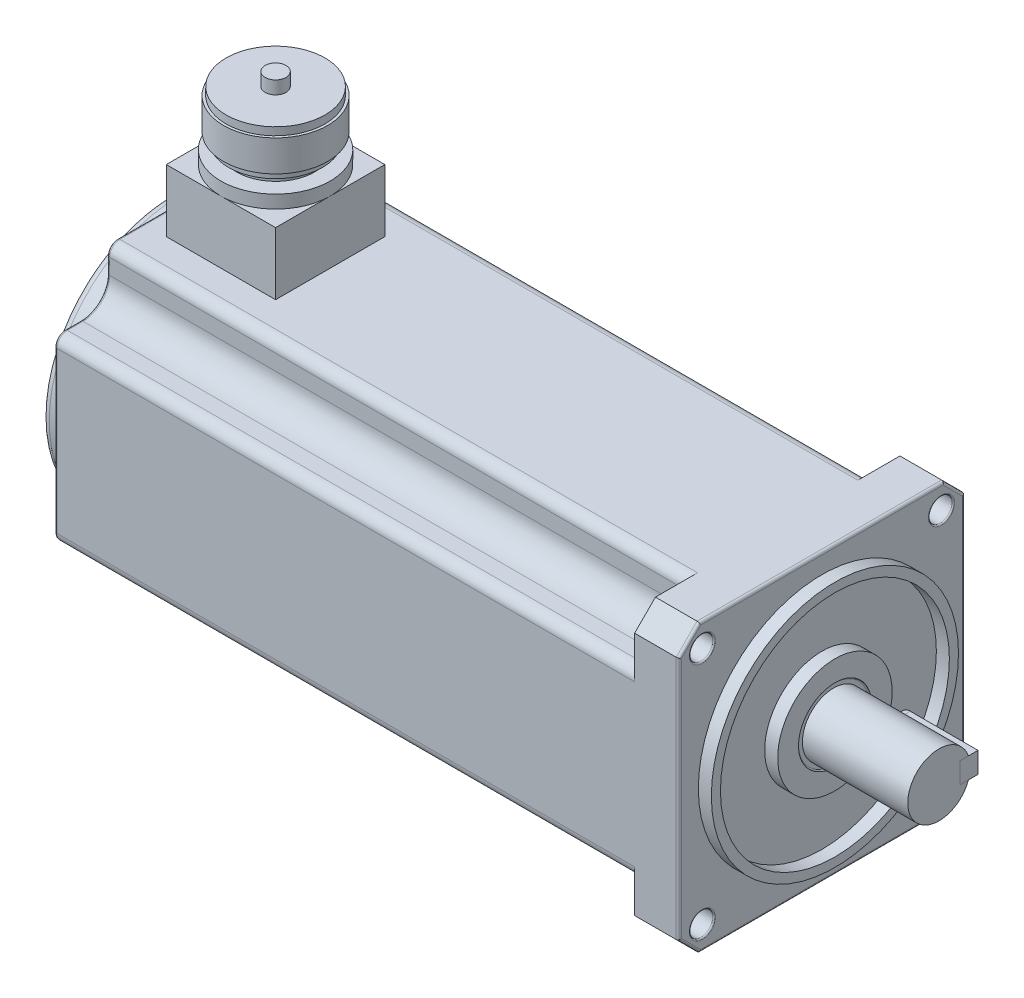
ISO-10303-21;
HEADER;
FILE_DESCRIPTION(('STEP AP214'),'2;1');
FILE_NAME('part.step','',(''),(''),'','','');
FILE_SCHEMA(('AUTOMOTIVE_DESIGN { 1 0 10303 214 1 1 1 1 }'));
ENDSEC;
DATA;
#1=APPLICATION_CONTEXT('core data for automotive mechanical design processes');
#2=APPLICATION_PROTOCOL_DEFINITION('international standard','automotive_design',2000,#1);
#3=PRODUCT_CONTEXT('',#1,'mechanical');
#4=PRODUCT('Part','Part','',(#3));
#5=PRODUCT_RELATED_PRODUCT_CATEGORY('part','',(#4));
#6=PRODUCT_DEFINITION_FORMATION('','',#4);
#7=PRODUCT_DEFINITION_CONTEXT('part definition',#1,'design');
#8=PRODUCT_DEFINITION('design','',#6,#7);
#9=PRODUCT_DEFINITION_SHAPE('','',#8);
#10=(LENGTH_UNIT() NAMED_UNIT(*) SI_UNIT(.MILLI.,.METRE.));
#11=(NAMED_UNIT(*) PLANE_ANGLE_UNIT() SI_UNIT($,.RADIAN.));
#12=(NAMED_UNIT(*) SI_UNIT($,.STERADIAN.) SOLID_ANGLE_UNIT());
#13=UNCERTAINTY_MEASURE_WITH_UNIT(LENGTH_MEASURE(1.E-05),#10,'distance_accuracy_value','');
#14=(GEOMETRIC_REPRESENTATION_CONTEXT(3) GLOBAL_UNCERTAINTY_ASSIGNED_CONTEXT((#13)) GLOBAL_UNIT_ASSIGNED_CONTEXT((#10,
#11,#12)) REPRESENTATION_CONTEXT('',''));
#15=CARTESIAN_POINT('',(0.,0.,0.));
#16=DIRECTION('',(0.,0.,1.));
#17=DIRECTION('',(1.,0.,0.));
#18=AXIS2_PLACEMENT_3D('',#15,#16,#17);
#19=CARTESIAN_POINT('',(19.,0.,-15.));
#20=DIRECTION('',(0.,0.,1.));
#21=DIRECTION('',(1.,0.,0.));
#22=AXIS2_PLACEMENT_3D('',#19,#20,#21);
#23=CYLINDRICAL_SURFACE('',#22,4.);
#24=CARTESIAN_POINT('',(19.,0.,-8.));
#25=DIRECTION('',(0.,0.,-1.));
#26=DIRECTION('',(-1.,0.,0.));
#27=AXIS2_PLACEMENT_3D('',#24,#25,#26);
#28=CIRCLE('',#27,4.);
#29=CARTESIAN_POINT('',(19.,-4.,-8.));
#30=VERTEX_POINT('',#29);
#31=CARTESIAN_POINT('',(19.,4.,-8.));
#32=VERTEX_POINT('',#31);
#33=EDGE_CURVE('E108',#30,#32,#28,.T.);
#34=ORIENTED_EDGE('',*,*,#33,.T.);
#35=DIRECTION('',(0.,0.,1.));
#36=VECTOR('',#35,1.);
#37=CARTESIAN_POINT('',(19.,4.,-15.));
#38=LINE('',#37,#36);
#39=CARTESIAN_POINT('',(19.,4.,-15.));
#40=VERTEX_POINT('',#39);
#41=EDGE_CURVE('E12',#40,#32,#38,.T.);
#42=ORIENTED_EDGE('',*,*,#41,.F.);
#43=CARTESIAN_POINT('',(19.,0.,-15.));
#44=DIRECTION('',(0.,0.,-1.));
#45=DIRECTION('',(-1.,0.,0.));
#46=AXIS2_PLACEMENT_3D('',#43,#44,#45);
#47=CIRCLE('',#46,4.);
#48=CARTESIAN_POINT('',(19.,-4.,-15.));
#49=VERTEX_POINT('',#48);
#50=EDGE_CURVE('E96',#49,#40,#47,.T.);
#51=ORIENTED_EDGE('',*,*,#50,.F.);
#52=DIRECTION('',(0.,0.,1.));
#53=VECTOR('',#52,1.);
#54=CARTESIAN_POINT('',(19.,-4.,-15.));
#55=LINE('',#54,#53);
#56=EDGE_CURVE('E104',#49,#30,#55,.T.);
#57=ORIENTED_EDGE('',*,*,#56,.T.);
#58=EDGE_LOOP('',(#34,#42,#51,#57));
#59=FACE_BOUND('',#58,.T.);
#60=ADVANCED_FACE('F45',(#59),#23,.T.);
#61=CARTESIAN_POINT('',(19.,4.,-15.));
#62=DIRECTION('',(0.,-1.,0.));
#63=DIRECTION('',(0.,0.,-1.));
#64=AXIS2_PLACEMENT_3D('',#61,#62,#63);
#65=PLANE('',#64);
#66=DIRECTION('',(1.,0.,0.));
#67=VECTOR('',#66,1.);
#68=CARTESIAN_POINT('',(19.,4.,-8.));
#69=LINE('',#68,#67);
#70=CARTESIAN_POINT('',(45.,4.,-8.));
#71=VERTEX_POINT('',#70);
#72=EDGE_CURVE('E100',#32,#71,#69,.T.);
#73=ORIENTED_EDGE('',*,*,#72,.T.);
#74=DIRECTION('',(0.,0.,1.));
#75=VECTOR('',#74,1.);
#76=CARTESIAN_POINT('',(45.,4.,-15.));
#77=LINE('',#76,#75);
#78=CARTESIAN_POINT('',(45.,4.,-15.));
#79=VERTEX_POINT('',#78);
#80=EDGE_CURVE('E53',#79,#71,#77,.T.);
#81=ORIENTED_EDGE('',*,*,#80,.F.);
#82=DIRECTION('',(1.,0.,0.));
#83=VECTOR('',#82,1.);
#84=CARTESIAN_POINT('',(19.,4.,-15.));
#85=LINE('',#84,#83);
#86=EDGE_CURVE('E91',#40,#79,#85,.T.);
#87=ORIENTED_EDGE('',*,*,#86,.F.);
#88=ORIENTED_EDGE('',*,*,#41,.T.);
#89=EDGE_LOOP('',(#73,#81,#87,#88));
#90=FACE_BOUND('',#89,.T.);
#91=ADVANCED_FACE('F99',(#90),#65,.F.);
#92=CARTESIAN_POINT('',(45.,4.,-15.));
#93=DIRECTION('',(-1.,0.,0.));
#94=DIRECTION('',(0.,0.,1.));
#95=AXIS2_PLACEMENT_3D('',#92,#93,#94);
#96=PLANE('',#95);
#97=DIRECTION('',(0.,-1.,0.));
#98=VECTOR('',#97,1.);
#99=CARTESIAN_POINT('',(45.,4.,-8.));
#100=LINE('',#99,#98);
#101=CARTESIAN_POINT('',(45.,-4.,-8.));
#102=VERTEX_POINT('',#101);
#103=EDGE_CURVE('E78',#71,#102,#100,.T.);
#104=ORIENTED_EDGE('',*,*,#103,.T.);
#105=DIRECTION('',(0.,0.,1.));
#106=VECTOR('',#105,1.);
#107=CARTESIAN_POINT('',(45.,-4.,-15.));
#108=LINE('',#107,#106);
#109=CARTESIAN_POINT('',(45.,-4.,-15.));
#110=VERTEX_POINT('',#109);
#111=EDGE_CURVE('E101',#110,#102,#108,.T.);
#112=ORIENTED_EDGE('',*,*,#111,.F.);
#113=DIRECTION('',(0.,-1.,0.));
#114=VECTOR('',#113,1.);
#115=CARTESIAN_POINT('',(45.,4.,-15.));
#116=LINE('',#115,#114);
#117=EDGE_CURVE('E94',#79,#110,#116,.T.);
#118=ORIENTED_EDGE('',*,*,#117,.F.);
#119=ORIENTED_EDGE('',*,*,#80,.T.);
#120=EDGE_LOOP('',(#104,#112,#118,#119));
#121=FACE_BOUND('',#120,.T.);
#122=ADVANCED_FACE('F102',(#121),#96,.F.);
#123=CARTESIAN_POINT('',(45.,-4.,-15.));
#124=DIRECTION('',(0.,1.,0.));
#125=DIRECTION('',(-1.,0.,0.));
#126=AXIS2_PLACEMENT_3D('',#123,#124,#125);
#127=PLANE('',#126);
#128=DIRECTION('',(-1.,0.,0.));
#129=VECTOR('',#128,1.);
#130=CARTESIAN_POINT('',(45.,-4.,-8.));
#131=LINE('',#130,#129);
#132=EDGE_CURVE('E84',#102,#30,#131,.T.);
#133=ORIENTED_EDGE('',*,*,#132,.T.);
#134=ORIENTED_EDGE('',*,*,#56,.F.);
#135=DIRECTION('',(-1.,0.,0.));
#136=VECTOR('',#135,1.);
#137=CARTESIAN_POINT('',(45.,-4.,-15.));
#138=LINE('',#137,#136);
#139=EDGE_CURVE('E61',#110,#49,#138,.T.);
#140=ORIENTED_EDGE('',*,*,#139,.F.);
#141=ORIENTED_EDGE('',*,*,#111,.T.);
#142=EDGE_LOOP('',(#133,#134,#140,#141));
#143=FACE_BOUND('',#142,.T.);
#144=ADVANCED_FACE('F115',(#143),#127,.F.);
#145=CARTESIAN_POINT('',(19.,0.,-15.));
#146=DIRECTION('',(0.,0.,-1.));
#147=DIRECTION('',(-1.,0.,0.));
#148=AXIS2_PLACEMENT_3D('',#145,#146,#147);
#149=PLANE('',#148);
#150=ORIENTED_EDGE('',*,*,#50,.T.);
#151=ORIENTED_EDGE('',*,*,#86,.T.);
#152=ORIENTED_EDGE('',*,*,#117,.T.);
#153=ORIENTED_EDGE('',*,*,#139,.T.);
#154=EDGE_LOOP('',(#150,#151,#152,#153));
#155=FACE_BOUND('',#154,.T.);
#156=ADVANCED_FACE('F92',(#155),#149,.T.);
#157=CARTESIAN_POINT('',(19.,0.,-8.));
#158=DIRECTION('',(0.,0.,-1.));
#159=DIRECTION('',(-1.,0.,0.));
#160=AXIS2_PLACEMENT_3D('',#157,#158,#159);
#161=PLANE('',#160);
#162=ORIENTED_EDGE('',*,*,#33,.F.);
#163=ORIENTED_EDGE('',*,*,#132,.F.);
#164=ORIENTED_EDGE('',*,*,#103,.F.);
#165=ORIENTED_EDGE('',*,*,#72,.F.);
#166=EDGE_LOOP('',(#162,#163,#164,#165));
#167=FACE_BOUND('',#166,.T.);
#168=ADVANCED_FACE('F118',(#167),#161,.F.);
#169=CLOSED_SHELL('',(#60,#91,#122,#144,#156,#168));
#170=MANIFOLD_SOLID_BREP('B2',#169);
#171=CARTESIAN_POINT('',(-210.,105.,0.));
#172=DIRECTION('',(0.,1.,0.));
#173=DIRECTION('',(0.,0.,1.));
#174=AXIS2_PLACEMENT_3D('',#171,#172,#173);
#175=PLANE('',#174);
#176=CARTESIAN_POINT('',(-210.,105.,0.));
#177=DIRECTION('',(0.,1.,0.));
#178=DIRECTION('',(0.,0.,1.));
#179=AXIS2_PLACEMENT_3D('',#176,#177,#178);
#180=CIRCLE('',#179,19.);
#181=CARTESIAN_POINT('',(-210.,105.,19.));
#182=VERTEX_POINT('',#181);
#183=EDGE_CURVE('E1747',#182,#182,#180,.T.);
#184=ORIENTED_EDGE('',*,*,#183,.T.);
#185=EDGE_LOOP('',(#184));
#186=FACE_BOUND('',#185,.T.);
#187=CARTESIAN_POINT('',(-210.,105.,0.));
#188=DIRECTION('',(0.,1.,0.));
#189=DIRECTION('',(0.,0.,1.));
#190=AXIS2_PLACEMENT_3D('',#187,#188,#189);
#191=CIRCLE('',#190,3.99999999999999);
#192=CARTESIAN_POINT('',(-210.,105.,3.99999999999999));
#193=VERTEX_POINT('',#192);
#194=EDGE_CURVE('E1744',#193,#193,#191,.T.);
#195=ORIENTED_EDGE('',*,*,#194,.F.);
#196=EDGE_LOOP('',(#195));
#197=FACE_BOUND('',#196,.T.);
#198=ADVANCED_FACE('F169',(#186,#197),#175,.T.);
#199=CARTESIAN_POINT('',(-210.,102.,0.));
#200=DIRECTION('',(0.,1.,0.));
#201=DIRECTION('',(0.,0.,1.));
#202=AXIS2_PLACEMENT_3D('',#199,#200,#201);
#203=PLANE('',#202);
#204=CARTESIAN_POINT('',(-210.,102.,0.));
#205=DIRECTION('',(0.,1.,0.));
#206=DIRECTION('',(0.,0.,1.));
#207=AXIS2_PLACEMENT_3D('',#204,#205,#206);
#208=CIRCLE('',#207,20.);
#209=CARTESIAN_POINT('',(-210.,102.,20.));
#210=VERTEX_POINT('',#209);
#211=EDGE_CURVE('E1754',#210,#210,#208,.T.);
#212=ORIENTED_EDGE('',*,*,#211,.T.);
#213=EDGE_LOOP('',(#212));
#214=FACE_BOUND('',#213,.T.);
#215=CARTESIAN_POINT('',(-210.,102.,0.));
#216=DIRECTION('',(0.,1.,0.));
#217=DIRECTION('',(0.,0.,1.));
#218=AXIS2_PLACEMENT_3D('',#215,#216,#217);
#219=CIRCLE('',#218,19.);
#220=CARTESIAN_POINT('',(-210.,102.,19.));
#221=VERTEX_POINT('',#220);
#222=EDGE_CURVE('E1743',#221,#221,#219,.T.);
#223=ORIENTED_EDGE('',*,*,#222,.F.);
#224=EDGE_LOOP('',(#223));
#225=FACE_BOUND('',#224,.T.);
#226=ADVANCED_FACE('F1118',(#214,#225),#203,.T.);
#227=CARTESIAN_POINT('',(-210.,84.,0.));
#228=DIRECTION('',(0.,1.,0.));
#229=DIRECTION('',(0.,0.,1.));
#230=AXIS2_PLACEMENT_3D('',#227,#228,#229);
#231=PLANE('',#230);
#232=CARTESIAN_POINT('',(-210.,84.,0.));
#233=DIRECTION('',(0.,1.,0.));
#234=DIRECTION('',(0.,0.,1.));
#235=AXIS2_PLACEMENT_3D('',#232,#233,#234);
#236=CIRCLE('',#235,21.);
#237=CARTESIAN_POINT('',(-210.,84.,21.));
#238=VERTEX_POINT('',#237);
#239=EDGE_CURVE('E561',#238,#238,#236,.T.);
#240=ORIENTED_EDGE('',*,*,#239,.T.);
#241=EDGE_LOOP('',(#240));
#242=FACE_BOUND('',#241,.T.);
#243=CARTESIAN_POINT('',(-210.,84.,0.));
#244=DIRECTION('',(0.,1.,0.));
#245=DIRECTION('',(0.,0.,1.));
#246=AXIS2_PLACEMENT_3D('',#243,#244,#245);
#247=CIRCLE('',#246,15.);
#248=CARTESIAN_POINT('',(-210.,84.,15.));
#249=VERTEX_POINT('',#248);
#250=EDGE_CURVE('E1763',#249,#249,#247,.T.);
#251=ORIENTED_EDGE('',*,*,#250,.F.);
#252=EDGE_LOOP('',(#251));
#253=FACE_BOUND('',#252,.T.);
#254=ADVANCED_FACE('F1124',(#242,#253),#231,.T.);
#255=CARTESIAN_POINT('',(0.,79.,0.));
#256=DIRECTION('',(0.,-1.,0.));
#257=DIRECTION('',(0.,0.,-1.));
#258=AXIS2_PLACEMENT_3D('',#255,#256,#257);
#259=PLANE('',#258);
#260=CARTESIAN_POINT('',(-210.,79.,0.));
#261=DIRECTION('',(0.,1.,0.));
#262=DIRECTION('',(0.,0.,1.));
#263=AXIS2_PLACEMENT_3D('',#260,#261,#262);
#264=CIRCLE('',#263,21.);
#265=CARTESIAN_POINT('',(-210.,79.,21.));
#266=VERTEX_POINT('',#265);
#267=CARTESIAN_POINT('',(-189.,79.,0.));
#268=VERTEX_POINT('',#267);
#269=EDGE_CURVE('E185',#266,#268,#264,.T.);
#270=ORIENTED_EDGE('',*,*,#269,.F.);
#271=DIRECTION('',(1.,0.,0.));
#272=VECTOR('',#271,1.);
#273=CARTESIAN_POINT('',(-231.,79.,21.));
#274=LINE('',#273,#272);
#275=CARTESIAN_POINT('',(-189.,79.,21.));
#276=VERTEX_POINT('',#275);
#277=EDGE_CURVE('E547',#266,#276,#274,.T.);
#278=ORIENTED_EDGE('',*,*,#277,.T.);
#279=DIRECTION('',(0.,0.,-1.));
#280=VECTOR('',#279,1.);
#281=CARTESIAN_POINT('',(-189.,79.,21.));
#282=LINE('',#281,#280);
#283=EDGE_CURVE('E559',#276,#268,#282,.T.);
#284=ORIENTED_EDGE('',*,*,#283,.T.);
#285=EDGE_LOOP('',(#270,#278,#284));
#286=FACE_BOUND('',#285,.T.);
#287=ADVANCED_FACE('F558',(#286),#259,.F.);
#288=CARTESIAN_POINT('',(-210.,79.,-21.));
#289=VERTEX_POINT('',#288);
#290=EDGE_CURVE('E43',#268,#289,#264,.T.);
#291=ORIENTED_EDGE('',*,*,#290,.F.);
#292=CARTESIAN_POINT('',(-189.,79.,-21.));
#293=VERTEX_POINT('',#292);
#294=EDGE_CURVE('E570',#268,#293,#282,.T.);
#295=ORIENTED_EDGE('',*,*,#294,.T.);
#296=DIRECTION('',(-1.,0.,0.));
#297=VECTOR('',#296,1.);
#298=CARTESIAN_POINT('',(-231.,79.,-21.));
#299=LINE('',#298,#297);
#300=EDGE_CURVE('E571',#293,#289,#299,.T.);
#301=ORIENTED_EDGE('',*,*,#300,.T.);
#302=EDGE_LOOP('',(#291,#295,#301));
#303=FACE_BOUND('',#302,.T.);
#304=ADVANCED_FACE('F1165',(#303),#259,.F.);
#305=CARTESIAN_POINT('',(-231.,79.,0.));
#306=VERTEX_POINT('',#305);
#307=EDGE_CURVE('E183',#289,#306,#264,.T.);
#308=ORIENTED_EDGE('',*,*,#307,.F.);
#309=CARTESIAN_POINT('',(-231.,79.,-21.));
#310=VERTEX_POINT('',#309);
#311=EDGE_CURVE('E569',#289,#310,#299,.T.);
#312=ORIENTED_EDGE('',*,*,#311,.T.);
#313=DIRECTION('',(0.,0.,1.));
#314=VECTOR('',#313,1.);
#315=CARTESIAN_POINT('',(-231.,79.,21.));
#316=LINE('',#315,#314);
#317=EDGE_CURVE('E556',#310,#306,#316,.T.);
#318=ORIENTED_EDGE('',*,*,#317,.T.);
#319=EDGE_LOOP('',(#308,#312,#318));
#320=FACE_BOUND('',#319,.T.);
#321=ADVANCED_FACE('F1626',(#320),#259,.F.);
#322=EDGE_CURVE('E192',#306,#266,#264,.T.);
#323=ORIENTED_EDGE('',*,*,#322,.F.);
#324=CARTESIAN_POINT('',(-231.,79.,21.));
#325=VERTEX_POINT('',#324);
#326=EDGE_CURVE('E543',#306,#325,#316,.T.);
#327=ORIENTED_EDGE('',*,*,#326,.T.);
#328=EDGE_CURVE('E540',#325,#266,#274,.T.);
#329=ORIENTED_EDGE('',*,*,#328,.T.);
#330=EDGE_LOOP('',(#323,#327,#329));
#331=FACE_BOUND('',#330,.T.);
#332=ADVANCED_FACE('F542',(#331),#259,.F.);
#333=CARTESIAN_POINT('',(-240.,55.,47.));
#334=DIRECTION('',(0.,1.,0.));
#335=DIRECTION('',(0.,0.,1.));
#336=AXIS2_PLACEMENT_3D('',#333,#334,#335);
#337=PLANE('',#336);
#338=DIRECTION('',(1.,0.,0.));
#339=VECTOR('',#338,1.);
#340=CARTESIAN_POINT('',(-240.,55.,47.));
#341=LINE('',#340,#339);
#342=CARTESIAN_POINT('',(-17.,55.,47.));
#343=VERTEX_POINT('',#342);
#344=CARTESIAN_POINT('',(-1.,55.,47.));
#345=VERTEX_POINT('',#344);
#346=EDGE_CURVE('E803',#343,#345,#341,.T.);
#347=ORIENTED_EDGE('',*,*,#346,.T.);
#348=DIRECTION('',(0.,0.,1.));
#349=VECTOR('',#348,1.);
#350=CARTESIAN_POINT('',(-1.,55.,47.));
#351=LINE('',#350,#349);
#352=CARTESIAN_POINT('',(-1.,55.,-47.));
#353=VERTEX_POINT('',#352);
#354=EDGE_CURVE('E1041',#345,#353,#351,.F.);
#355=ORIENTED_EDGE('',*,*,#354,.T.);
#356=DIRECTION('',(1.,0.,0.));
#357=VECTOR('',#356,1.);
#358=CARTESIAN_POINT('',(-240.,55.,-47.));
#359=LINE('',#358,#357);
#360=CARTESIAN_POINT('',(-17.,55.,-47.));
#361=VERTEX_POINT('',#360);
#362=EDGE_CURVE('E818',#361,#353,#359,.T.);
#363=ORIENTED_EDGE('',*,*,#362,.F.);
#364=DIRECTION('',(0.,0.,-1.));
#365=VECTOR('',#364,1.);
#366=CARTESIAN_POINT('',(-17.,55.,-30.8019609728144));
#367=LINE('',#366,#365);
#368=CARTESIAN_POINT('',(-17.,55.,-30.8019609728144));
#369=VERTEX_POINT('',#368);
#370=EDGE_CURVE('E786',#369,#361,#367,.T.);
#371=ORIENTED_EDGE('',*,*,#370,.F.);
#372=DIRECTION('',(-1.,0.,0.));
#373=VECTOR('',#372,1.);
#374=CARTESIAN_POINT('',(-17.,55.,-30.8019609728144));
#375=LINE('',#374,#373);
#376=CARTESIAN_POINT('',(-239.,55.,-30.8019609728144));
#377=VERTEX_POINT('',#376);
#378=EDGE_CURVE('E810',#369,#377,#375,.T.);
#379=ORIENTED_EDGE('',*,*,#378,.T.);
#380=DIRECTION('',(0.,0.,1.));
#381=VECTOR('',#380,1.);
#382=CARTESIAN_POINT('',(-239.,55.,30.8019609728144));
#383=LINE('',#382,#381);
#384=CARTESIAN_POINT('',(-239.,55.,30.8019609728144));
#385=VERTEX_POINT('',#384);
#386=EDGE_CURVE('E933',#377,#385,#383,.T.);
#387=ORIENTED_EDGE('',*,*,#386,.T.);
#388=DIRECTION('',(-1.,0.,0.));
#389=VECTOR('',#388,1.);
#390=CARTESIAN_POINT('',(-17.,55.,30.8019609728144));
#391=LINE('',#390,#389);
#392=CARTESIAN_POINT('',(-17.,55.,30.8019609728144));
#393=VERTEX_POINT('',#392);
#394=EDGE_CURVE('E687',#393,#385,#391,.T.);
#395=ORIENTED_EDGE('',*,*,#394,.F.);
#396=DIRECTION('',(0.,0.,-1.));
#397=VECTOR('',#396,1.);
#398=CARTESIAN_POINT('',(-17.,55.,47.));
#399=LINE('',#398,#397);
#400=EDGE_CURVE('E670',#343,#393,#399,.T.);
#401=ORIENTED_EDGE('',*,*,#400,.F.);
#402=EDGE_LOOP('',(#347,#355,#363,#371,#379,#387,#395,#401));
#403=FACE_BOUND('',#402,.T.);
#404=DIRECTION('',(-1.,0.,0.));
#405=VECTOR('',#404,1.);
#406=CARTESIAN_POINT('',(-231.,55.,-21.));
#407=LINE('',#406,#405);
#408=CARTESIAN_POINT('',(-189.,55.,-21.));
#409=VERTEX_POINT('',#408);
#410=CARTESIAN_POINT('',(-231.,55.,-21.));
#411=VERTEX_POINT('',#410);
#412=EDGE_CURVE('E578',#409,#411,#407,.T.);
#413=ORIENTED_EDGE('',*,*,#412,.F.);
#414=DIRECTION('',(0.,0.,-1.));
#415=VECTOR('',#414,1.);
#416=CARTESIAN_POINT('',(-189.,55.,21.));
#417=LINE('',#416,#415);
#418=CARTESIAN_POINT('',(-189.,55.,21.));
#419=VERTEX_POINT('',#418);
#420=EDGE_CURVE('E575',#419,#409,#417,.T.);
#421=ORIENTED_EDGE('',*,*,#420,.F.);
#422=DIRECTION('',(1.,0.,0.));
#423=VECTOR('',#422,1.);
#424=CARTESIAN_POINT('',(-231.,55.,21.));
#425=LINE('',#424,#423);
#426=CARTESIAN_POINT('',(-231.,55.,21.));
#427=VERTEX_POINT('',#426);
#428=EDGE_CURVE('E583',#427,#419,#425,.T.);
#429=ORIENTED_EDGE('',*,*,#428,.F.);
#430=DIRECTION('',(0.,0.,1.));
#431=VECTOR('',#430,1.);
#432=CARTESIAN_POINT('',(-231.,55.,21.));
#433=LINE('',#432,#431);
#434=EDGE_CURVE('E580',#411,#427,#433,.T.);
#435=ORIENTED_EDGE('',*,*,#434,.F.);
#436=EDGE_LOOP('',(#413,#421,#429,#435));
#437=FACE_BOUND('',#436,.T.);
#438=ADVANCED_FACE('F1199',(#403,#437),#337,.T.);
#439=CARTESIAN_POINT('',(45.,0.,0.));
#440=DIRECTION('',(-1.,0.,0.));
#441=DIRECTION('',(0.,0.,1.));
#442=AXIS2_PLACEMENT_3D('',#439,#440,#441);
#443=CYLINDRICAL_SURFACE('',#442,12.);
#444=CARTESIAN_POINT('',(4.5,0.,0.));
#445=DIRECTION('',(1.,0.,0.));
#446=DIRECTION('',(0.,0.,-1.));
#447=AXIS2_PLACEMENT_3D('',#444,#445,#446);
#448=CIRCLE('',#447,12.);
#449=CARTESIAN_POINT('',(4.5,0.,-12.));
#450=VERTEX_POINT('',#449);
#451=EDGE_CURVE('E619',#450,#450,#448,.T.);
#452=ORIENTED_EDGE('',*,*,#451,.T.);
#453=EDGE_LOOP('',(#452));
#454=FACE_BOUND('',#453,.T.);
#455=CARTESIAN_POINT('',(19.,-4.,-11.3137084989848));
#456=CARTESIAN_POINT('',(18.8908686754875,-4.0000143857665,-11.3136910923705));
#457=CARTESIAN_POINT('',(18.7817470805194,-3.99553419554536,-11.3152871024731));
#458=CARTESIAN_POINT('',(18.5643503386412,-3.97769673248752,-11.3215763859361));
#459=CARTESIAN_POINT('',(18.4560749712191,-3.96434185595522,-11.3262688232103));
#460=CARTESIAN_POINT('',(18.2414552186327,-3.92891935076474,-11.3386032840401));
#461=CARTESIAN_POINT('',(18.1351060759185,-3.90687756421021,-11.3462365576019));
#462=CARTESIAN_POINT('',(17.9247867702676,-3.85430689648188,-11.364201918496));
#463=CARTESIAN_POINT('',(17.8208166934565,-3.82377770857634,-11.3745341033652));
#464=CARTESIAN_POINT('',(17.5136614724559,-3.71986482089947,-11.4091190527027));
#465=CARTESIAN_POINT('',(17.314913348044,-3.63410266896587,-11.4369799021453));
#466=CARTESIAN_POINT('',(16.9345971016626,-3.4322845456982,-11.4991525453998));
#467=CARTESIAN_POINT('',(16.753039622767,-3.31620997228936,-11.5334682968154));
#468=CARTESIAN_POINT('',(16.4051313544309,-3.05220793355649,-11.6061789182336));
#469=CARTESIAN_POINT('',(16.2395437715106,-2.9033005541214,-11.6446750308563));
#470=CARTESIAN_POINT('',(15.9351726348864,-2.5799531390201,-11.7205540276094));
#471=CARTESIAN_POINT('',(15.796393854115,-2.40550856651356,-11.7579367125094));
#472=CARTESIAN_POINT('',(15.5460828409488,-2.03041476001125,-11.8285552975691));
#473=CARTESIAN_POINT('',(15.4353563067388,-1.82920040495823,-11.8616574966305));
#474=CARTESIAN_POINT('',(15.2496307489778,-1.40971695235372,-11.9187843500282));
#475=CARTESIAN_POINT('',(15.1746208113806,-1.19145308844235,-11.9428117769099));
#476=CARTESIAN_POINT('',(15.0650571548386,-0.752117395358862,-11.9783628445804));
#477=CARTESIAN_POINT('',(15.0291869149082,-0.531407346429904,-11.9902923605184));
#478=CARTESIAN_POINT('',(14.9947348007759,-0.0867958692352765,-12.0017443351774));
#479=CARTESIAN_POINT('',(14.9961440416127,0.137104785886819,-12.0012697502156));
#480=CARTESIAN_POINT('',(15.0353770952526,0.572415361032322,-11.9882415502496));
#481=CARTESIAN_POINT('',(15.0717704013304,0.783970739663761,-11.9761624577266));
#482=CARTESIAN_POINT('',(15.1775729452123,1.19777632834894,-11.9418784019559));
#483=CARTESIAN_POINT('',(15.2469840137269,1.4000260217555,-11.9196728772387));
#484=CARTESIAN_POINT('',(15.4176849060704,1.79261022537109,-11.8670267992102));
#485=CARTESIAN_POINT('',(15.5193820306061,1.98275302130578,-11.8364817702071));
#486=CARTESIAN_POINT('',(15.7514419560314,2.34369935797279,-11.7703352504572));
#487=CARTESIAN_POINT('',(15.8818125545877,2.51449761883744,-11.7347323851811));
#488=CARTESIAN_POINT('',(16.1746757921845,2.84038544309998,-11.6602518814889));
#489=CARTESIAN_POINT('',(16.3383901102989,2.99435951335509,-11.6212989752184));
#490=CARTESIAN_POINT('',(16.6897980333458,3.27310303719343,-11.5458957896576));
#491=CARTESIAN_POINT('',(16.8774993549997,3.39786305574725,-11.5094463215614));
#492=CARTESIAN_POINT('',(17.1747129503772,3.56109757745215,-11.4595759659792));
#493=CARTESIAN_POINT('',(17.2772554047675,3.61182358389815,-11.4436484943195));
#494=CARTESIAN_POINT('',(17.4865649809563,3.70440095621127,-11.4140167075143));
#495=CARTESIAN_POINT('',(17.5933303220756,3.74625601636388,-11.4003114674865));
#496=CARTESIAN_POINT('',(17.8102170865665,3.82067426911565,-11.3755873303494));
#497=CARTESIAN_POINT('',(17.9203347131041,3.85324757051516,-11.3645655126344));
#498=CARTESIAN_POINT('',(18.1431681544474,3.90883841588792,-11.3455648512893));
#499=CARTESIAN_POINT('',(18.2558827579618,3.93186032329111,-11.3375846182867));
#500=CARTESIAN_POINT('',(18.4736424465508,3.96661962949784,-11.3254693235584));
#501=CARTESIAN_POINT('',(18.5785495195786,3.97913375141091,-11.3210705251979));
#502=CARTESIAN_POINT('',(18.7889683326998,3.99582494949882,-11.3151843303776));
#503=CARTESIAN_POINT('',(18.8944791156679,4.00001278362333,-11.3136931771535));
#504=CARTESIAN_POINT('',(19.,4.,-11.3137084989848));
#505=B_SPLINE_CURVE_WITH_KNOTS('',3,(#455,#456,#457,#458,#459,#460,#461,#462,#463,#464,#465,
#466,#467,#468,#469,#470,#471,#472,#473,#474,#475,#476,#477,#478,#479,#480,#481,#482,#483,#484,
#485,#486,#487,#488,#489,#490,#491,#492,#493,#494,#495,#496,#497,#498,#499,#500,#501,#502,#503,
#504),.UNSPECIFIED.,.F.,.F.,(4,2,2,2,2,2,2,2,2,2,2,2,2,2,2,2,2,2,2,2,2,2,2,2,4),(0.,
0.327273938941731,0.654459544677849,0.980679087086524,1.30691042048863,1.95841627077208,
2.61032287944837,3.28524582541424,3.96028882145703,4.65295094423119,5.34540127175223,
6.01376445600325,6.68196834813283,7.32396236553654,7.96599198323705,8.61646637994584,
9.26711789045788,9.94834778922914,10.6297973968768,10.9759539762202,11.3219661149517,
11.6675999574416,12.0130757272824,12.3299368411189,12.6463882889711),.UNSPECIFIED.);
#506=CARTESIAN_POINT('',(19.,-4.,-11.3137084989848));
#507=VERTEX_POINT('',#506);
#508=CARTESIAN_POINT('',(19.,4.,-11.3137084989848));
#509=VERTEX_POINT('',#508);
#510=EDGE_CURVE('E173',#507,#509,#505,.T.);
#511=ORIENTED_EDGE('',*,*,#510,.F.);
#512=DIRECTION('',(-1.,0.,0.));
#513=VECTOR('',#512,1.);
#514=CARTESIAN_POINT('',(45.,-4.,-11.3137084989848));
#515=LINE('',#514,#513);
#516=CARTESIAN_POINT('',(45.,-4.,-11.3137084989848));
#517=VERTEX_POINT('',#516);
#518=EDGE_CURVE('E616',#517,#507,#515,.T.);
#519=ORIENTED_EDGE('',*,*,#518,.F.);
#520=CARTESIAN_POINT('',(45.,0.,0.));
#521=DIRECTION('',(1.,0.,0.));
#522=DIRECTION('',(0.,0.,-1.));
#523=AXIS2_PLACEMENT_3D('',#520,#521,#522);
#524=CIRCLE('',#523,12.);
#525=CARTESIAN_POINT('',(45.,4.,-11.3137084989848));
#526=VERTEX_POINT('',#525);
#527=EDGE_CURVE('E620',#526,#517,#524,.T.);
#528=ORIENTED_EDGE('',*,*,#527,.F.);
#529=DIRECTION('',(-1.,0.,0.));
#530=VECTOR('',#529,1.);
#531=CARTESIAN_POINT('',(45.,4.,-11.3137084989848));
#532=LINE('',#531,#530);
#533=EDGE_CURVE('E614',#509,#526,#532,.F.);
#534=ORIENTED_EDGE('',*,*,#533,.F.);
#535=EDGE_LOOP('',(#511,#519,#528,#534));
#536=FACE_BOUND('',#535,.T.);
#537=ADVANCED_FACE('F1194',(#454,#536),#443,.T.);
#538=CARTESIAN_POINT('',(45.,0.,0.));
#539=DIRECTION('',(1.,0.,0.));
#540=DIRECTION('',(0.,0.,-1.));
#541=AXIS2_PLACEMENT_3D('',#538,#539,#540);
#542=PLANE('',#541);
#543=ORIENTED_EDGE('',*,*,#527,.T.);
#544=DIRECTION('',(0.,0.,-1.));
#545=VECTOR('',#544,1.);
#546=CARTESIAN_POINT('',(45.,-4.,-8.));
#547=LINE('',#546,#545);
#548=CARTESIAN_POINT('',(45.,-4.,-8.));
#549=VERTEX_POINT('',#548);
#550=EDGE_CURVE('E609',#549,#517,#547,.T.);
#551=ORIENTED_EDGE('',*,*,#550,.F.);
#552=DIRECTION('',(0.,1.,0.));
#553=VECTOR('',#552,1.);
#554=CARTESIAN_POINT('',(45.,4.,-8.));
#555=LINE('',#554,#553);
#556=CARTESIAN_POINT('',(45.,4.,-8.));
#557=VERTEX_POINT('',#556);
#558=EDGE_CURVE('E598',#549,#557,#555,.T.);
#559=ORIENTED_EDGE('',*,*,#558,.T.);
#560=DIRECTION('',(0.,0.,-1.));
#561=VECTOR('',#560,1.);
#562=CARTESIAN_POINT('',(45.,4.,-8.));
#563=LINE('',#562,#561);
#564=EDGE_CURVE('E606',#557,#526,#563,.T.);
#565=ORIENTED_EDGE('',*,*,#564,.T.);
#566=EDGE_LOOP('',(#543,#551,#559,#565));
#567=FACE_BOUND('',#566,.T.);
#568=ADVANCED_FACE('F1192',(#567),#542,.T.);
#569=CARTESIAN_POINT('',(4.5,0.,0.));
#570=DIRECTION('',(1.,0.,0.));
#571=DIRECTION('',(0.,0.,-1.));
#572=AXIS2_PLACEMENT_3D('',#569,#570,#571);
#573=PLANE('',#572);
#574=CARTESIAN_POINT('',(4.5,0.,0.));
#575=DIRECTION('',(1.,0.,0.));
#576=DIRECTION('',(0.,0.,-1.));
#577=AXIS2_PLACEMENT_3D('',#574,#575,#576);
#578=CIRCLE('',#577,13.5);
#579=CARTESIAN_POINT('',(4.5,0.,-13.5));
#580=VERTEX_POINT('',#579);
#581=EDGE_CURVE('E564',#580,#580,#578,.T.);
#582=ORIENTED_EDGE('',*,*,#581,.T.);
#583=EDGE_LOOP('',(#582));
#584=FACE_BOUND('',#583,.T.);
#585=ORIENTED_EDGE('',*,*,#451,.F.);
#586=EDGE_LOOP('',(#585));
#587=FACE_BOUND('',#586,.T.);
#588=ADVANCED_FACE('F1101',(#584,#587),#573,.T.);
#589=CARTESIAN_POINT('',(0.,0.,0.));
#590=DIRECTION('',(1.,0.,0.));
#591=DIRECTION('',(0.,0.,-1.));
#592=AXIS2_PLACEMENT_3D('',#589,#590,#591);
#593=PLANE('',#592);
#594=CARTESIAN_POINT('',(0.,0.,0.));
#595=DIRECTION('',(1.,0.,0.));
#596=DIRECTION('',(0.,0.,-1.));
#597=AXIS2_PLACEMENT_3D('',#594,#595,#596);
#598=CIRCLE('',#597,44.);
#599=CARTESIAN_POINT('',(0.,0.,-44.));
#600=VERTEX_POINT('',#599);
#601=EDGE_CURVE('E1096',#600,#600,#598,.F.);
#602=ORIENTED_EDGE('',*,*,#601,.F.);
#603=EDGE_LOOP('',(#602));
#604=FACE_BOUND('',#603,.T.);
#605=CARTESIAN_POINT('',(0.,0.,0.));
#606=DIRECTION('',(1.,0.,0.));
#607=DIRECTION('',(0.,0.,-1.));
#608=AXIS2_PLACEMENT_3D('',#605,#606,#607);
#609=CIRCLE('',#608,22.);
#610=CARTESIAN_POINT('',(0.,0.,-22.));
#611=VERTEX_POINT('',#610);
#612=EDGE_CURVE('E628',#611,#611,#609,.T.);
#613=ORIENTED_EDGE('',*,*,#612,.F.);
#614=EDGE_LOOP('',(#613));
#615=FACE_BOUND('',#614,.T.);
#616=ADVANCED_FACE('F1202',(#604,#615),#593,.T.);
#617=CARTESIAN_POINT('',(0.,-45.9619407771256,45.9619407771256));
#618=DIRECTION('',(1.,0.,0.));
#619=DIRECTION('',(0.,0.,-1.));
#620=AXIS2_PLACEMENT_3D('',#617,#618,#619);
#621=CIRCLE('',#620,5.);
#622=CARTESIAN_POINT('',(0.,-45.9619407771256,40.9619407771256));
#623=VERTEX_POINT('',#622);
#624=EDGE_CURVE('E1075',#623,#623,#621,.F.);
#625=ORIENTED_EDGE('',*,*,#624,.T.);
#626=EDGE_LOOP('',(#625));
#627=FACE_BOUND('',#626,.T.);
#628=CARTESIAN_POINT('',(0.,-45.9619407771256,-45.9619407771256));
#629=DIRECTION('',(1.,0.,0.));
#630=DIRECTION('',(0.,0.,-1.));
#631=AXIS2_PLACEMENT_3D('',#628,#629,#630);
#632=CIRCLE('',#631,5.);
#633=CARTESIAN_POINT('',(0.,-45.9619407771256,-50.9619407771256));
#634=VERTEX_POINT('',#633);
#635=EDGE_CURVE('E1072',#634,#634,#632,.F.);
#636=ORIENTED_EDGE('',*,*,#635,.T.);
#637=EDGE_LOOP('',(#636));
#638=FACE_BOUND('',#637,.T.);
#639=CARTESIAN_POINT('',(0.,45.9619407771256,-45.9619407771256));
#640=DIRECTION('',(1.,0.,0.));
#641=DIRECTION('',(0.,0.,-1.));
#642=AXIS2_PLACEMENT_3D('',#639,#640,#641);
#643=CIRCLE('',#642,5.);
#644=CARTESIAN_POINT('',(0.,45.9619407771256,-50.9619407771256));
#645=VERTEX_POINT('',#644);
#646=EDGE_CURVE('E1069',#645,#645,#643,.F.);
#647=ORIENTED_EDGE('',*,*,#646,.T.);
#648=EDGE_LOOP('',(#647));
#649=FACE_BOUND('',#648,.T.);
#650=CARTESIAN_POINT('',(0.,45.9619407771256,45.9619407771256));
#651=DIRECTION('',(1.,0.,0.));
#652=DIRECTION('',(0.,0.,-1.));
#653=AXIS2_PLACEMENT_3D('',#650,#651,#652);
#654=CIRCLE('',#653,5.);
#655=CARTESIAN_POINT('',(0.,45.9619407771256,40.9619407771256));
#656=VERTEX_POINT('',#655);
#657=EDGE_CURVE('E1066',#656,#656,#654,.F.);
#658=ORIENTED_EDGE('',*,*,#657,.T.);
#659=EDGE_LOOP('',(#658));
#660=FACE_BOUND('',#659,.T.);
#661=DIRECTION('',(0.,0.707106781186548,-0.707106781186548));
#662=VECTOR('',#661,1.);
#663=CARTESIAN_POINT('',(0.,-50.2928932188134,-50.2928932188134));
#664=LINE('',#663,#662);
#665=CARTESIAN_POINT('',(0.,-54.,-46.5857864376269));
#666=VERTEX_POINT('',#665);
#667=CARTESIAN_POINT('',(0.,-46.5857864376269,-54.));
#668=VERTEX_POINT('',#667);
#669=EDGE_CURVE('E1019',#666,#668,#664,.T.);
#670=ORIENTED_EDGE('',*,*,#669,.T.);
#671=DIRECTION('',(0.,1.,0.));
#672=VECTOR('',#671,1.);
#673=CARTESIAN_POINT('',(0.,0.,-54.));
#674=LINE('',#673,#672);
#675=CARTESIAN_POINT('',(0.,46.5857864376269,-54.));
#676=VERTEX_POINT('',#675);
#677=EDGE_CURVE('E1024',#668,#676,#674,.T.);
#678=ORIENTED_EDGE('',*,*,#677,.T.);
#679=DIRECTION('',(0.,0.707106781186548,0.707106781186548));
#680=VECTOR('',#679,1.);
#681=CARTESIAN_POINT('',(0.,50.2928932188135,-50.2928932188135));
#682=LINE('',#681,#680);
#683=CARTESIAN_POINT('',(0.,54.,-46.5857864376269));
#684=VERTEX_POINT('',#683);
#685=EDGE_CURVE('E1021',#676,#684,#682,.T.);
#686=ORIENTED_EDGE('',*,*,#685,.T.);
#687=DIRECTION('',(0.,0.,1.));
#688=VECTOR('',#687,1.);
#689=CARTESIAN_POINT('',(0.,54.,0.));
#690=LINE('',#689,#688);
#691=CARTESIAN_POINT('',(0.,54.,46.5857864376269));
#692=VERTEX_POINT('',#691);
#693=EDGE_CURVE('E939',#684,#692,#690,.T.);
#694=ORIENTED_EDGE('',*,*,#693,.T.);
#695=DIRECTION('',(0.,-0.707106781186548,0.707106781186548));
#696=VECTOR('',#695,1.);
#697=CARTESIAN_POINT('',(0.,50.2928932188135,50.2928932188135));
#698=LINE('',#697,#696);
#699=CARTESIAN_POINT('',(0.,46.5857864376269,54.));
#700=VERTEX_POINT('',#699);
#701=EDGE_CURVE('E1011',#692,#700,#698,.T.);
#702=ORIENTED_EDGE('',*,*,#701,.T.);
#703=DIRECTION('',(0.,-1.,0.));
#704=VECTOR('',#703,1.);
#705=CARTESIAN_POINT('',(0.,0.,54.));
#706=LINE('',#705,#704);
#707=CARTESIAN_POINT('',(0.,-46.5857864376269,54.));
#708=VERTEX_POINT('',#707);
#709=EDGE_CURVE('E1013',#700,#708,#706,.T.);
#710=ORIENTED_EDGE('',*,*,#709,.T.);
#711=DIRECTION('',(0.,-0.707106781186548,-0.707106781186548));
#712=VECTOR('',#711,1.);
#713=CARTESIAN_POINT('',(0.,-50.2928932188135,50.2928932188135));
#714=LINE('',#713,#712);
#715=CARTESIAN_POINT('',(0.,-54.,46.5857864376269));
#716=VERTEX_POINT('',#715);
#717=EDGE_CURVE('E1015',#708,#716,#714,.T.);
#718=ORIENTED_EDGE('',*,*,#717,.T.);
#719=DIRECTION('',(0.,0.,-1.));
#720=VECTOR('',#719,1.);
#721=CARTESIAN_POINT('',(0.,-54.,0.));
#722=LINE('',#721,#720);
#723=EDGE_CURVE('E1017',#716,#666,#722,.T.);
#724=ORIENTED_EDGE('',*,*,#723,.T.);
#725=EDGE_LOOP('',(#670,#678,#686,#694,#702,#710,#718,#724));
#726=FACE_BOUND('',#725,.T.);
#727=CARTESIAN_POINT('',(0.,0.,0.));
#728=DIRECTION('',(1.,0.,0.));
#729=DIRECTION('',(0.,0.,-1.));
#730=AXIS2_PLACEMENT_3D('',#727,#728,#729);
#731=CIRCLE('',#730,47.5);
#732=CARTESIAN_POINT('',(0.,0.,-47.5));
#733=VERTEX_POINT('',#732);
#734=EDGE_CURVE('E637',#733,#733,#731,.T.);
#735=ORIENTED_EDGE('',*,*,#734,.F.);
#736=EDGE_LOOP('',(#735));
#737=FACE_BOUND('',#736,.T.);
#738=ADVANCED_FACE('F1347',(#627,#638,#649,#660,#726,#737),#593,.T.);
#739=CARTESIAN_POINT('',(-240.,0.,0.));
#740=DIRECTION('',(1.,0.,0.));
#741=DIRECTION('',(0.,0.,-1.));
#742=AXIS2_PLACEMENT_3D('',#739,#740,#741);
#743=PLANE('',#742);
#744=DIRECTION('',(0.,0.,1.));
#745=VECTOR('',#744,1.);
#746=CARTESIAN_POINT('',(-240.,33.8019609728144,0.));
#747=LINE('',#746,#745);
#748=CARTESIAN_POINT('',(-240.,33.8019609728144,51.));
#749=VERTEX_POINT('',#748);
#750=CARTESIAN_POINT('',(-240.,33.8019609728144,45.));
#751=VERTEX_POINT('',#750);
#752=EDGE_CURVE('E888',#749,#751,#747,.F.);
#753=ORIENTED_EDGE('',*,*,#752,.T.);
#754=CARTESIAN_POINT('',(-240.,45.,45.));
#755=DIRECTION('',(1.,0.,0.));
#756=DIRECTION('',(0.,0.,-1.));
#757=AXIS2_PLACEMENT_3D('',#754,#755,#756);
#758=CIRCLE('',#757,11.1980390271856);
#759=CARTESIAN_POINT('',(-240.,45.,33.8019609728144));
#760=VERTEX_POINT('',#759);
#761=EDGE_CURVE('E890',#751,#760,#758,.T.);
#762=ORIENTED_EDGE('',*,*,#761,.T.);
#763=DIRECTION('',(0.,-1.,0.));
#764=VECTOR('',#763,1.);
#765=CARTESIAN_POINT('',(-240.,0.,33.8019609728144));
#766=LINE('',#765,#764);
#767=CARTESIAN_POINT('',(-240.,51.,33.8019609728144));
#768=VERTEX_POINT('',#767);
#769=EDGE_CURVE('E844',#760,#768,#766,.F.);
#770=ORIENTED_EDGE('',*,*,#769,.T.);
#771=CARTESIAN_POINT('',(-240.,51.,30.8019609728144));
#772=DIRECTION('',(1.,0.,0.));
#773=DIRECTION('',(0.,0.,-1.));
#774=AXIS2_PLACEMENT_3D('',#771,#772,#773);
#775=CIRCLE('',#774,3.);
#776=CARTESIAN_POINT('',(-240.,54.,30.8019609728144));
#777=VERTEX_POINT('',#776);
#778=EDGE_CURVE('E846',#768,#777,#775,.F.);
#779=ORIENTED_EDGE('',*,*,#778,.T.);
#780=DIRECTION('',(0.,0.,1.));
#781=VECTOR('',#780,1.);
#782=CARTESIAN_POINT('',(-240.,54.,-30.8019609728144));
#783=LINE('',#782,#781);
#784=CARTESIAN_POINT('',(-240.,54.,-30.8019609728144));
#785=VERTEX_POINT('',#784);
#786=EDGE_CURVE('E848',#777,#785,#783,.F.);
#787=ORIENTED_EDGE('',*,*,#786,.T.);
#788=CARTESIAN_POINT('',(-240.,51.,-30.8019609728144));
#789=DIRECTION('',(1.,0.,0.));
#790=DIRECTION('',(0.,0.,-1.));
#791=AXIS2_PLACEMENT_3D('',#788,#789,#790);
#792=CIRCLE('',#791,3.);
#793=CARTESIAN_POINT('',(-240.,51.,-33.8019609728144));
#794=VERTEX_POINT('',#793);
#795=EDGE_CURVE('E850',#785,#794,#792,.F.);
#796=ORIENTED_EDGE('',*,*,#795,.T.);
#797=DIRECTION('',(0.,1.,0.));
#798=VECTOR('',#797,1.);
#799=CARTESIAN_POINT('',(-240.,0.,-33.8019609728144));
#800=LINE('',#799,#798);
#801=CARTESIAN_POINT('',(-240.,45.,-33.8019609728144));
#802=VERTEX_POINT('',#801);
#803=EDGE_CURVE('E852',#794,#802,#800,.F.);
#804=ORIENTED_EDGE('',*,*,#803,.T.);
#805=CARTESIAN_POINT('',(-240.,45.,-45.));
#806=DIRECTION('',(1.,0.,0.));
#807=DIRECTION('',(0.,0.,-1.));
#808=AXIS2_PLACEMENT_3D('',#805,#806,#807);
#809=CIRCLE('',#808,11.1980390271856);
#810=CARTESIAN_POINT('',(-240.,33.8019609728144,-45.));
#811=VERTEX_POINT('',#810);
#812=EDGE_CURVE('E854',#802,#811,#809,.T.);
#813=ORIENTED_EDGE('',*,*,#812,.T.);
#814=DIRECTION('',(0.,0.,1.));
#815=VECTOR('',#814,1.);
#816=CARTESIAN_POINT('',(-240.,33.8019609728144,0.));
#817=LINE('',#816,#815);
#818=CARTESIAN_POINT('',(-240.,33.8019609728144,-51.));
#819=VERTEX_POINT('',#818);
#820=EDGE_CURVE('E856',#811,#819,#817,.F.);
#821=ORIENTED_EDGE('',*,*,#820,.T.);
#822=CARTESIAN_POINT('',(-240.,30.8019609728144,-51.));
#823=DIRECTION('',(1.,0.,0.));
#824=DIRECTION('',(0.,0.,-1.));
#825=AXIS2_PLACEMENT_3D('',#822,#823,#824);
#826=CIRCLE('',#825,3.);
#827=CARTESIAN_POINT('',(-240.,30.8019609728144,-54.));
#828=VERTEX_POINT('',#827);
#829=EDGE_CURVE('E858',#819,#828,#826,.F.);
#830=ORIENTED_EDGE('',*,*,#829,.T.);
#831=DIRECTION('',(0.,1.,0.));
#832=VECTOR('',#831,1.);
#833=CARTESIAN_POINT('',(-240.,-30.8019609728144,-54.));
#834=LINE('',#833,#832);
#835=CARTESIAN_POINT('',(-240.,-30.8019609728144,-54.));
#836=VERTEX_POINT('',#835);
#837=EDGE_CURVE('E860',#828,#836,#834,.F.);
#838=ORIENTED_EDGE('',*,*,#837,.T.);
#839=CARTESIAN_POINT('',(-240.,-30.8019609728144,-51.));
#840=DIRECTION('',(1.,0.,0.));
#841=DIRECTION('',(0.,0.,-1.));
#842=AXIS2_PLACEMENT_3D('',#839,#840,#841);
#843=CIRCLE('',#842,3.);
#844=CARTESIAN_POINT('',(-240.,-33.8019609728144,-51.));
#845=VERTEX_POINT('',#844);
#846=EDGE_CURVE('E862',#836,#845,#843,.F.);
#847=ORIENTED_EDGE('',*,*,#846,.T.);
#848=DIRECTION('',(0.,0.,-1.));
#849=VECTOR('',#848,1.);
#850=CARTESIAN_POINT('',(-240.,-33.8019609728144,0.));
#851=LINE('',#850,#849);
#852=CARTESIAN_POINT('',(-240.,-33.8019609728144,-45.));
#853=VERTEX_POINT('',#852);
#854=EDGE_CURVE('E864',#845,#853,#851,.F.);
#855=ORIENTED_EDGE('',*,*,#854,.T.);
#856=CARTESIAN_POINT('',(-240.,-45.,-45.));
#857=DIRECTION('',(1.,0.,0.));
#858=DIRECTION('',(0.,0.,-1.));
#859=AXIS2_PLACEMENT_3D('',#856,#857,#858);
#860=CIRCLE('',#859,11.1980390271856);
#861=CARTESIAN_POINT('',(-240.,-45.,-33.8019609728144));
#862=VERTEX_POINT('',#861);
#863=EDGE_CURVE('E866',#853,#862,#860,.T.);
#864=ORIENTED_EDGE('',*,*,#863,.T.);
#865=DIRECTION('',(0.,1.,0.));
#866=VECTOR('',#865,1.);
#867=CARTESIAN_POINT('',(-240.,0.,-33.8019609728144));
#868=LINE('',#867,#866);
#869=CARTESIAN_POINT('',(-240.,-51.,-33.8019609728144));
#870=VERTEX_POINT('',#869);
#871=EDGE_CURVE('E868',#862,#870,#868,.F.);
#872=ORIENTED_EDGE('',*,*,#871,.T.);
#873=CARTESIAN_POINT('',(-240.,-51.,-30.8019609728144));
#874=DIRECTION('',(1.,0.,0.));
#875=DIRECTION('',(0.,0.,-1.));
#876=AXIS2_PLACEMENT_3D('',#873,#874,#875);
#877=CIRCLE('',#876,3.);
#878=CARTESIAN_POINT('',(-240.,-54.,-30.8019609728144));
#879=VERTEX_POINT('',#878);
#880=EDGE_CURVE('E870',#870,#879,#877,.F.);
#881=ORIENTED_EDGE('',*,*,#880,.T.);
#882=DIRECTION('',(0.,0.,-1.));
#883=VECTOR('',#882,1.);
#884=CARTESIAN_POINT('',(-240.,-54.,30.8019609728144));
#885=LINE('',#884,#883);
#886=CARTESIAN_POINT('',(-240.,-54.,30.8019609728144));
#887=VERTEX_POINT('',#886);
#888=EDGE_CURVE('E872',#879,#887,#885,.F.);
#889=ORIENTED_EDGE('',*,*,#888,.T.);
#890=CARTESIAN_POINT('',(-240.,-51.,30.8019609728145));
#891=DIRECTION('',(1.,0.,0.));
#892=DIRECTION('',(0.,0.,-1.));
#893=AXIS2_PLACEMENT_3D('',#890,#891,#892);
#894=CIRCLE('',#893,3.);
#895=CARTESIAN_POINT('',(-240.,-51.,33.8019609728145));
#896=VERTEX_POINT('',#895);
#897=EDGE_CURVE('E874',#887,#896,#894,.F.);
#898=ORIENTED_EDGE('',*,*,#897,.T.);
#899=DIRECTION('',(0.,-1.,0.));
#900=VECTOR('',#899,1.);
#901=CARTESIAN_POINT('',(-240.,0.,33.8019609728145));
#902=LINE('',#901,#900);
#903=CARTESIAN_POINT('',(-240.,-45.,33.8019609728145));
#904=VERTEX_POINT('',#903);
#905=EDGE_CURVE('E876',#896,#904,#902,.F.);
#906=ORIENTED_EDGE('',*,*,#905,.T.);
#907=CARTESIAN_POINT('',(-240.,-45.,45.));
#908=DIRECTION('',(1.,0.,0.));
#909=DIRECTION('',(0.,0.,-1.));
#910=AXIS2_PLACEMENT_3D('',#907,#908,#909);
#911=CIRCLE('',#910,11.1980390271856);
#912=CARTESIAN_POINT('',(-240.,-33.8019609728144,45.));
#913=VERTEX_POINT('',#912);
#914=EDGE_CURVE('E878',#904,#913,#911,.T.);
#915=ORIENTED_EDGE('',*,*,#914,.T.);
#916=DIRECTION('',(0.,0.,-1.));
#917=VECTOR('',#916,1.);
#918=CARTESIAN_POINT('',(-240.,-33.8019609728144,0.));
#919=LINE('',#918,#917);
#920=CARTESIAN_POINT('',(-240.,-33.8019609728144,51.));
#921=VERTEX_POINT('',#920);
#922=EDGE_CURVE('E880',#913,#921,#919,.F.);
#923=ORIENTED_EDGE('',*,*,#922,.T.);
#924=CARTESIAN_POINT('',(-240.,-30.8019609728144,51.));
#925=DIRECTION('',(1.,0.,0.));
#926=DIRECTION('',(0.,0.,-1.));
#927=AXIS2_PLACEMENT_3D('',#924,#925,#926);
#928=CIRCLE('',#927,3.);
#929=CARTESIAN_POINT('',(-240.,-30.8019609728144,54.));
#930=VERTEX_POINT('',#929);
#931=EDGE_CURVE('E882',#921,#930,#928,.F.);
#932=ORIENTED_EDGE('',*,*,#931,.T.);
#933=DIRECTION('',(0.,-1.,0.));
#934=VECTOR('',#933,1.);
#935=CARTESIAN_POINT('',(-240.,30.8019609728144,54.));
#936=LINE('',#935,#934);
#937=CARTESIAN_POINT('',(-240.,30.8019609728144,54.));
#938=VERTEX_POINT('',#937);
#939=EDGE_CURVE('E884',#930,#938,#936,.F.);
#940=ORIENTED_EDGE('',*,*,#939,.T.);
#941=CARTESIAN_POINT('',(-240.,30.8019609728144,51.));
#942=DIRECTION('',(1.,0.,0.));
#943=DIRECTION('',(0.,0.,-1.));
#944=AXIS2_PLACEMENT_3D('',#941,#942,#943);
#945=CIRCLE('',#944,3.);
#946=EDGE_CURVE('E886',#938,#749,#945,.F.);
#947=ORIENTED_EDGE('',*,*,#946,.T.);
#948=EDGE_LOOP('',(#753,#762,#770,#779,#787,#796,#804,#813,#821,#830,#838,#847,#855,#864,#872,
#881,#889,#898,#906,#915,#923,#932,#940,#947));
#949=FACE_BOUND('',#948,.T.);
#950=CARTESIAN_POINT('',(-240.,0.,0.));
#951=DIRECTION('',(1.,0.,0.));
#952=DIRECTION('',(0.,0.,-1.));
#953=AXIS2_PLACEMENT_3D('',#950,#951,#952);
#954=CIRCLE('',#953,50.);
#955=CARTESIAN_POINT('',(-240.,0.,-50.));
#956=VERTEX_POINT('',#955);
#957=EDGE_CURVE('E1087',#956,#956,#954,.F.);
#958=ORIENTED_EDGE('',*,*,#957,.F.);
#959=EDGE_LOOP('',(#958));
#960=FACE_BOUND('',#959,.T.);
#961=ADVANCED_FACE('F1343',(#949,#960),#743,.F.);
#962=CARTESIAN_POINT('',(-240.,47.,55.));
#963=DIRECTION('',(0.,0.707106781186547,0.707106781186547));
#964=DIRECTION('',(0.,-0.707106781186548,0.707106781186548));
#965=AXIS2_PLACEMENT_3D('',#962,#963,#964);
#966=PLANE('',#965);
#967=DIRECTION('',(1.,0.,0.));
#968=VECTOR('',#967,1.);
#969=CARTESIAN_POINT('',(-240.,47.,55.));
#970=LINE('',#969,#968);
#971=CARTESIAN_POINT('',(-17.,47.,55.));
#972=VERTEX_POINT('',#971);
#973=CARTESIAN_POINT('',(-1.,47.,55.));
#974=VERTEX_POINT('',#973);
#975=EDGE_CURVE('E837',#972,#974,#970,.T.);
#976=ORIENTED_EDGE('',*,*,#975,.T.);
#977=DIRECTION('',(0.,-0.707106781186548,0.707106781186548));
#978=VECTOR('',#977,1.);
#979=CARTESIAN_POINT('',(-1.,47.,55.));
#980=LINE('',#979,#978);
#981=EDGE_CURVE('E1039',#974,#345,#980,.F.);
#982=ORIENTED_EDGE('',*,*,#981,.T.);
#983=ORIENTED_EDGE('',*,*,#346,.F.);
#984=DIRECTION('',(0.,0.707106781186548,-0.707106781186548));
#985=VECTOR('',#984,1.);
#986=CARTESIAN_POINT('',(-17.,47.,55.));
#987=LINE('',#986,#985);
#988=EDGE_CURVE('E668',#972,#343,#987,.T.);
#989=ORIENTED_EDGE('',*,*,#988,.F.);
#990=EDGE_LOOP('',(#976,#982,#983,#989));
#991=FACE_BOUND('',#990,.T.);
#992=ADVANCED_FACE('F1346',(#991),#966,.T.);
#993=CARTESIAN_POINT('',(-240.,-47.,55.));
#994=DIRECTION('',(0.,-0.707106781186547,0.707106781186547));
#995=DIRECTION('',(0.,-0.707106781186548,-0.707106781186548));
#996=AXIS2_PLACEMENT_3D('',#993,#994,#995);
#997=PLANE('',#996);
#998=DIRECTION('',(1.,0.,0.));
#999=VECTOR('',#998,1.);
#1000=CARTESIAN_POINT('',(-240.,-55.,47.));
#1001=LINE('',#1000,#999);
#1002=CARTESIAN_POINT('',(-17.,-55.,47.));
#1003=VERTEX_POINT('',#1002);
#1004=CARTESIAN_POINT('',(-1.,-55.,47.));
#1005=VERTEX_POINT('',#1004);
#1006=EDGE_CURVE('E831',#1003,#1005,#1001,.T.);
#1007=ORIENTED_EDGE('',*,*,#1006,.T.);
#1008=DIRECTION('',(0.,-0.707106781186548,-0.707106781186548));
#1009=VECTOR('',#1008,1.);
#1010=CARTESIAN_POINT('',(-1.,-47.,55.));
#1011=LINE('',#1010,#1009);
#1012=CARTESIAN_POINT('',(-1.,-47.,55.));
#1013=VERTEX_POINT('',#1012);
#1014=EDGE_CURVE('E1035',#1005,#1013,#1011,.F.);
#1015=ORIENTED_EDGE('',*,*,#1014,.T.);
#1016=DIRECTION('',(1.,0.,0.));
#1017=VECTOR('',#1016,1.);
#1018=CARTESIAN_POINT('',(-240.,-47.,55.));
#1019=LINE('',#1018,#1017);
#1020=CARTESIAN_POINT('',(-17.,-47.,55.));
#1021=VERTEX_POINT('',#1020);
#1022=EDGE_CURVE('E834',#1021,#1013,#1019,.T.);
#1023=ORIENTED_EDGE('',*,*,#1022,.F.);
#1024=DIRECTION('',(0.,0.707106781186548,0.707106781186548));
#1025=VECTOR('',#1024,1.);
#1026=CARTESIAN_POINT('',(-17.,-55.,47.));
#1027=LINE('',#1026,#1025);
#1028=EDGE_CURVE('E708',#1003,#1021,#1027,.T.);
#1029=ORIENTED_EDGE('',*,*,#1028,.F.);
#1030=EDGE_LOOP('',(#1007,#1015,#1023,#1029));
#1031=FACE_BOUND('',#1030,.T.);
#1032=ADVANCED_FACE('F1368',(#1031),#997,.T.);
#1033=CARTESIAN_POINT('',(-240.,-47.,55.));
#1034=DIRECTION('',(0.,0.,1.));
#1035=DIRECTION('',(1.,0.,0.));
#1036=AXIS2_PLACEMENT_3D('',#1033,#1034,#1035);
#1037=PLANE('',#1036);
#1038=ORIENTED_EDGE('',*,*,#1022,.T.);
#1039=DIRECTION('',(0.,-1.,0.));
#1040=VECTOR('',#1039,1.);
#1041=CARTESIAN_POINT('',(-1.,-47.,55.));
#1042=LINE('',#1041,#1040);
#1043=EDGE_CURVE('E1037',#1013,#974,#1042,.F.);
#1044=ORIENTED_EDGE('',*,*,#1043,.T.);
#1045=ORIENTED_EDGE('',*,*,#975,.F.);
#1046=DIRECTION('',(0.,1.,0.));
#1047=VECTOR('',#1046,1.);
#1048=CARTESIAN_POINT('',(-17.,30.8019609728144,55.));
#1049=LINE('',#1048,#1047);
#1050=CARTESIAN_POINT('',(-17.,30.8019609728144,55.));
#1051=VERTEX_POINT('',#1050);
#1052=EDGE_CURVE('E666',#1051,#972,#1049,.T.);
#1053=ORIENTED_EDGE('',*,*,#1052,.F.);
#1054=DIRECTION('',(-1.,0.,0.));
#1055=VECTOR('',#1054,1.);
#1056=CARTESIAN_POINT('',(-17.,30.8019609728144,55.));
#1057=LINE('',#1056,#1055);
#1058=CARTESIAN_POINT('',(-239.,30.8019609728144,55.));
#1059=VERTEX_POINT('',#1058);
#1060=EDGE_CURVE('E690',#1051,#1059,#1057,.T.);
#1061=ORIENTED_EDGE('',*,*,#1060,.T.);
#1062=DIRECTION('',(0.,-1.,0.));
#1063=VECTOR('',#1062,1.);
#1064=CARTESIAN_POINT('',(-239.,-30.8019609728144,55.));
#1065=LINE('',#1064,#1063);
#1066=CARTESIAN_POINT('',(-239.,-30.8019609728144,55.));
#1067=VERTEX_POINT('',#1066);
#1068=EDGE_CURVE('E897',#1059,#1067,#1065,.T.);
#1069=ORIENTED_EDGE('',*,*,#1068,.T.);
#1070=DIRECTION('',(-1.,0.,0.));
#1071=VECTOR('',#1070,1.);
#1072=CARTESIAN_POINT('',(-17.,-30.8019609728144,55.));
#1073=LINE('',#1072,#1071);
#1074=CARTESIAN_POINT('',(-17.,-30.8019609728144,55.));
#1075=VERTEX_POINT('',#1074);
#1076=EDGE_CURVE('E727',#1075,#1067,#1073,.T.);
#1077=ORIENTED_EDGE('',*,*,#1076,.F.);
#1078=DIRECTION('',(0.,1.,0.));
#1079=VECTOR('',#1078,1.);
#1080=CARTESIAN_POINT('',(-17.,-47.,55.));
#1081=LINE('',#1080,#1079);
#1082=EDGE_CURVE('E710',#1021,#1075,#1081,.T.);
#1083=ORIENTED_EDGE('',*,*,#1082,.F.);
#1084=EDGE_LOOP('',(#1038,#1044,#1045,#1053,#1061,#1069,#1077,#1083));
#1085=FACE_BOUND('',#1084,.T.);
#1086=ADVANCED_FACE('F1363',(#1085),#1037,.T.);
#1087=CARTESIAN_POINT('',(-240.,-55.,-47.));
#1088=DIRECTION('',(0.,-0.707106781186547,-0.707106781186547));
#1089=DIRECTION('',(0.,0.707106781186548,-0.707106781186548));
#1090=AXIS2_PLACEMENT_3D('',#1087,#1088,#1089);
#1091=PLANE('',#1090);
#1092=DIRECTION('',(1.,0.,0.));
#1093=VECTOR('',#1092,1.);
#1094=CARTESIAN_POINT('',(-240.,-47.,-55.));
#1095=LINE('',#1094,#1093);
#1096=CARTESIAN_POINT('',(-17.,-47.,-55.));
#1097=VERTEX_POINT('',#1096);
#1098=CARTESIAN_POINT('',(-1.,-47.,-55.));
#1099=VERTEX_POINT('',#1098);
#1100=EDGE_CURVE('E825',#1097,#1099,#1095,.T.);
#1101=ORIENTED_EDGE('',*,*,#1100,.T.);
#1102=DIRECTION('',(0.,0.707106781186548,-0.707106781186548));
#1103=VECTOR('',#1102,1.);
#1104=CARTESIAN_POINT('',(-1.,-55.,-47.));
#1105=LINE('',#1104,#1103);
#1106=CARTESIAN_POINT('',(-1.,-55.,-47.));
#1107=VERTEX_POINT('',#1106);
#1108=EDGE_CURVE('E1029',#1099,#1107,#1105,.F.);
#1109=ORIENTED_EDGE('',*,*,#1108,.T.);
#1110=DIRECTION('',(1.,0.,0.));
#1111=VECTOR('',#1110,1.);
#1112=CARTESIAN_POINT('',(-240.,-55.,-47.));
#1113=LINE('',#1112,#1111);
#1114=CARTESIAN_POINT('',(-17.,-55.,-47.));
#1115=VERTEX_POINT('',#1114);
#1116=EDGE_CURVE('E828',#1115,#1107,#1113,.T.);
#1117=ORIENTED_EDGE('',*,*,#1116,.F.);
#1118=DIRECTION('',(0.,-0.707106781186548,0.707106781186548));
#1119=VECTOR('',#1118,1.);
#1120=CARTESIAN_POINT('',(-17.,-47.,-55.));
#1121=LINE('',#1120,#1119);
#1122=EDGE_CURVE('E742',#1097,#1115,#1121,.T.);
#1123=ORIENTED_EDGE('',*,*,#1122,.F.);
#1124=EDGE_LOOP('',(#1101,#1109,#1117,#1123));
#1125=FACE_BOUND('',#1124,.T.);
#1126=ADVANCED_FACE('F1360',(#1125),#1091,.T.);
#1127=CARTESIAN_POINT('',(-240.,-55.,47.));
#1128=DIRECTION('',(0.,-1.,0.));
#1129=DIRECTION('',(0.,0.,-1.));
#1130=AXIS2_PLACEMENT_3D('',#1127,#1128,#1129);
#1131=PLANE('',#1130);
#1132=ORIENTED_EDGE('',*,*,#1116,.T.);
#1133=DIRECTION('',(0.,0.,-1.));
#1134=VECTOR('',#1133,1.);
#1135=CARTESIAN_POINT('',(-1.,-55.,47.));
#1136=LINE('',#1135,#1134);
#1137=EDGE_CURVE('E1033',#1107,#1005,#1136,.F.);
#1138=ORIENTED_EDGE('',*,*,#1137,.T.);
#1139=ORIENTED_EDGE('',*,*,#1006,.F.);
#1140=DIRECTION('',(0.,0.,1.));
#1141=VECTOR('',#1140,1.);
#1142=CARTESIAN_POINT('',(-17.,-55.,30.8019609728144));
#1143=LINE('',#1142,#1141);
#1144=CARTESIAN_POINT('',(-17.,-55.,30.8019609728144));
#1145=VERTEX_POINT('',#1144);
#1146=EDGE_CURVE('E706',#1145,#1003,#1143,.T.);
#1147=ORIENTED_EDGE('',*,*,#1146,.F.);
#1148=DIRECTION('',(-1.,0.,0.));
#1149=VECTOR('',#1148,1.);
#1150=CARTESIAN_POINT('',(-17.,-55.,30.8019609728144));
#1151=LINE('',#1150,#1149);
#1152=CARTESIAN_POINT('',(-239.,-55.,30.8019609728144));
#1153=VERTEX_POINT('',#1152);
#1154=EDGE_CURVE('E730',#1145,#1153,#1151,.T.);
#1155=ORIENTED_EDGE('',*,*,#1154,.T.);
#1156=DIRECTION('',(0.,0.,-1.));
#1157=VECTOR('',#1156,1.);
#1158=CARTESIAN_POINT('',(-239.,-55.,-30.8019609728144));
#1159=LINE('',#1158,#1157);
#1160=CARTESIAN_POINT('',(-239.,-55.,-30.8019609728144));
#1161=VERTEX_POINT('',#1160);
#1162=EDGE_CURVE('E909',#1153,#1161,#1159,.T.);
#1163=ORIENTED_EDGE('',*,*,#1162,.T.);
#1164=DIRECTION('',(-1.,0.,0.));
#1165=VECTOR('',#1164,1.);
#1166=CARTESIAN_POINT('',(-17.,-55.,-30.8019609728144));
#1167=LINE('',#1166,#1165);
#1168=CARTESIAN_POINT('',(-17.,-55.,-30.8019609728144));
#1169=VERTEX_POINT('',#1168);
#1170=EDGE_CURVE('E773',#1169,#1161,#1167,.T.);
#1171=ORIENTED_EDGE('',*,*,#1170,.F.);
#1172=DIRECTION('',(0.,0.,1.));
#1173=VECTOR('',#1172,1.);
#1174=CARTESIAN_POINT('',(-17.,-55.,-47.));
#1175=LINE('',#1174,#1173);
#1176=EDGE_CURVE('E744',#1115,#1169,#1175,.T.);
#1177=ORIENTED_EDGE('',*,*,#1176,.F.);
#1178=EDGE_LOOP('',(#1132,#1138,#1139,#1147,#1155,#1163,#1171,#1177));
#1179=FACE_BOUND('',#1178,.T.);
#1180=ADVANCED_FACE('F1355',(#1179),#1131,.T.);
#1181=CARTESIAN_POINT('',(-240.,55.,-47.));
#1182=DIRECTION('',(0.,0.707106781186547,-0.707106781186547));
#1183=DIRECTION('',(0.,0.707106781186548,0.707106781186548));
#1184=AXIS2_PLACEMENT_3D('',#1181,#1182,#1183);
#1185=PLANE('',#1184);
#1186=ORIENTED_EDGE('',*,*,#362,.T.);
#1187=DIRECTION('',(0.,0.707106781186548,0.707106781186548));
#1188=VECTOR('',#1187,1.);
#1189=CARTESIAN_POINT('',(-1.,55.,-47.));
#1190=LINE('',#1189,#1188);
#1191=CARTESIAN_POINT('',(-1.,47.,-55.));
#1192=VERTEX_POINT('',#1191);
#1193=EDGE_CURVE('E1026',#353,#1192,#1190,.F.);
#1194=ORIENTED_EDGE('',*,*,#1193,.T.);
#1195=DIRECTION('',(1.,0.,0.));
#1196=VECTOR('',#1195,1.);
#1197=CARTESIAN_POINT('',(-240.,47.,-55.));
#1198=LINE('',#1197,#1196);
#1199=CARTESIAN_POINT('',(-17.,47.,-55.));
#1200=VERTEX_POINT('',#1199);
#1201=EDGE_CURVE('E822',#1200,#1192,#1198,.T.);
#1202=ORIENTED_EDGE('',*,*,#1201,.F.);
#1203=DIRECTION('',(0.,-0.707106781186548,-0.707106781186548));
#1204=VECTOR('',#1203,1.);
#1205=CARTESIAN_POINT('',(-17.,55.,-47.));
#1206=LINE('',#1205,#1204);
#1207=EDGE_CURVE('E788',#361,#1200,#1206,.T.);
#1208=ORIENTED_EDGE('',*,*,#1207,.F.);
#1209=EDGE_LOOP('',(#1186,#1194,#1202,#1208));
#1210=FACE_BOUND('',#1209,.T.);
#1211=ADVANCED_FACE('F1352',(#1210),#1185,.T.);
#1212=CARTESIAN_POINT('',(-240.,-47.,-55.));
#1213=DIRECTION('',(0.,0.,-1.));
#1214=DIRECTION('',(0.,1.,0.));
#1215=AXIS2_PLACEMENT_3D('',#1212,#1213,#1214);
#1216=PLANE('',#1215);
#1217=ORIENTED_EDGE('',*,*,#1201,.T.);
#1218=DIRECTION('',(0.,1.,0.));
#1219=VECTOR('',#1218,1.);
#1220=CARTESIAN_POINT('',(-1.,-47.,-55.));
#1221=LINE('',#1220,#1219);
#1222=EDGE_CURVE('E1031',#1192,#1099,#1221,.F.);
#1223=ORIENTED_EDGE('',*,*,#1222,.T.);
#1224=ORIENTED_EDGE('',*,*,#1100,.F.);
#1225=DIRECTION('',(0.,-1.,0.));
#1226=VECTOR('',#1225,1.);
#1227=CARTESIAN_POINT('',(-17.,-30.8019609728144,-55.));
#1228=LINE('',#1227,#1226);
#1229=CARTESIAN_POINT('',(-17.,-30.8019609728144,-55.));
#1230=VERTEX_POINT('',#1229);
#1231=EDGE_CURVE('E740',#1230,#1097,#1228,.T.);
#1232=ORIENTED_EDGE('',*,*,#1231,.F.);
#1233=DIRECTION('',(-1.,0.,0.));
#1234=VECTOR('',#1233,1.);
#1235=CARTESIAN_POINT('',(-17.,-30.8019609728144,-55.));
#1236=LINE('',#1235,#1234);
#1237=CARTESIAN_POINT('',(-239.,-30.8019609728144,-55.));
#1238=VERTEX_POINT('',#1237);
#1239=EDGE_CURVE('E759',#1230,#1238,#1236,.T.);
#1240=ORIENTED_EDGE('',*,*,#1239,.T.);
#1241=DIRECTION('',(0.,1.,0.));
#1242=VECTOR('',#1241,1.);
#1243=CARTESIAN_POINT('',(-239.,30.8019609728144,-55.));
#1244=LINE('',#1243,#1242);
#1245=CARTESIAN_POINT('',(-239.,30.8019609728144,-55.));
#1246=VERTEX_POINT('',#1245);
#1247=EDGE_CURVE('E921',#1238,#1246,#1244,.T.);
#1248=ORIENTED_EDGE('',*,*,#1247,.T.);
#1249=DIRECTION('',(-1.,0.,0.));
#1250=VECTOR('',#1249,1.);
#1251=CARTESIAN_POINT('',(-17.,30.8019609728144,-55.));
#1252=LINE('',#1251,#1250);
#1253=CARTESIAN_POINT('',(-17.,30.8019609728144,-55.));
#1254=VERTEX_POINT('',#1253);
#1255=EDGE_CURVE('E807',#1254,#1246,#1252,.T.);
#1256=ORIENTED_EDGE('',*,*,#1255,.F.);
#1257=DIRECTION('',(0.,-1.,0.));
#1258=VECTOR('',#1257,1.);
#1259=CARTESIAN_POINT('',(-17.,47.,-55.));
#1260=LINE('',#1259,#1258);
#1261=EDGE_CURVE('E790',#1200,#1254,#1260,.T.);
#1262=ORIENTED_EDGE('',*,*,#1261,.F.);
#1263=EDGE_LOOP('',(#1217,#1223,#1224,#1232,#1240,#1248,#1256,#1262));
#1264=FACE_BOUND('',#1263,.T.);
#1265=ADVANCED_FACE('F1341',(#1264),#1216,.T.);
#1266=CARTESIAN_POINT('',(-17.,45.,-45.));
#1267=DIRECTION('',(-1.,0.,0.));
#1268=DIRECTION('',(0.,0.,1.));
#1269=AXIS2_PLACEMENT_3D('',#1266,#1267,#1268);
#1270=CYLINDRICAL_SURFACE('',#1269,10.1980390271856);
#1271=DIRECTION('',(-1.,0.,0.));
#1272=VECTOR('',#1271,1.);
#1273=CARTESIAN_POINT('',(-17.,34.8019609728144,-45.));
#1274=LINE('',#1273,#1272);
#1275=CARTESIAN_POINT('',(-17.,34.8019609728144,-45.));
#1276=VERTEX_POINT('',#1275);
#1277=CARTESIAN_POINT('',(-239.,34.8019609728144,-45.));
#1278=VERTEX_POINT('',#1277);
#1279=EDGE_CURVE('E800',#1276,#1278,#1274,.T.);
#1280=ORIENTED_EDGE('',*,*,#1279,.T.);
#1281=CARTESIAN_POINT('',(-239.,45.,-45.));
#1282=DIRECTION('',(1.,0.,0.));
#1283=DIRECTION('',(0.,0.,-1.));
#1284=AXIS2_PLACEMENT_3D('',#1281,#1282,#1283);
#1285=CIRCLE('',#1284,10.1980390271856);
#1286=CARTESIAN_POINT('',(-239.,45.,-34.8019609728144));
#1287=VERTEX_POINT('',#1286);
#1288=EDGE_CURVE('E927',#1278,#1287,#1285,.F.);
#1289=ORIENTED_EDGE('',*,*,#1288,.T.);
#1290=DIRECTION('',(-1.,0.,0.));
#1291=VECTOR('',#1290,1.);
#1292=CARTESIAN_POINT('',(-17.,45.,-34.8019609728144));
#1293=LINE('',#1292,#1291);
#1294=CARTESIAN_POINT('',(-17.,45.,-34.8019609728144));
#1295=VERTEX_POINT('',#1294);
#1296=EDGE_CURVE('E799',#1295,#1287,#1293,.T.);
#1297=ORIENTED_EDGE('',*,*,#1296,.F.);
#1298=CARTESIAN_POINT('',(-17.,45.,-45.));
#1299=DIRECTION('',(-1.,0.,0.));
#1300=DIRECTION('',(0.,0.,1.));
#1301=AXIS2_PLACEMENT_3D('',#1298,#1299,#1300);
#1302=CIRCLE('',#1301,10.1980390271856);
#1303=EDGE_CURVE('E763',#1276,#1295,#1302,.T.);
#1304=ORIENTED_EDGE('',*,*,#1303,.F.);
#1305=EDGE_LOOP('',(#1280,#1289,#1297,#1304));
#1306=FACE_BOUND('',#1305,.T.);
#1307=ADVANCED_FACE('F1327',(#1306),#1270,.F.);
#1308=CARTESIAN_POINT('',(-17.,34.8019609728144,-45.));
#1309=DIRECTION('',(0.,-1.,0.));
#1310=DIRECTION('',(0.,0.,-1.));
#1311=AXIS2_PLACEMENT_3D('',#1308,#1309,#1310);
#1312=PLANE('',#1311);
#1313=DIRECTION('',(-1.,0.,0.));
#1314=VECTOR('',#1313,1.);
#1315=CARTESIAN_POINT('',(-17.,34.8019609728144,-51.));
#1316=LINE('',#1315,#1314);
#1317=CARTESIAN_POINT('',(-17.,34.8019609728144,-51.));
#1318=VERTEX_POINT('',#1317);
#1319=CARTESIAN_POINT('',(-239.,34.8019609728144,-51.));
#1320=VERTEX_POINT('',#1319);
#1321=EDGE_CURVE('E804',#1318,#1320,#1316,.T.);
#1322=ORIENTED_EDGE('',*,*,#1321,.T.);
#1323=DIRECTION('',(0.,0.,1.));
#1324=VECTOR('',#1323,1.);
#1325=CARTESIAN_POINT('',(-239.,34.8019609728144,-45.));
#1326=LINE('',#1325,#1324);
#1327=EDGE_CURVE('E925',#1320,#1278,#1326,.T.);
#1328=ORIENTED_EDGE('',*,*,#1327,.T.);
#1329=ORIENTED_EDGE('',*,*,#1279,.F.);
#1330=DIRECTION('',(0.,0.,1.));
#1331=VECTOR('',#1330,1.);
#1332=CARTESIAN_POINT('',(-17.,34.8019609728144,-45.));
#1333=LINE('',#1332,#1331);
#1334=EDGE_CURVE('E796',#1318,#1276,#1333,.T.);
#1335=ORIENTED_EDGE('',*,*,#1334,.F.);
#1336=EDGE_LOOP('',(#1322,#1328,#1329,#1335));
#1337=FACE_BOUND('',#1336,.T.);
#1338=ADVANCED_FACE('F1323',(#1337),#1312,.F.);
#1339=CARTESIAN_POINT('',(-17.,30.8019609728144,-51.));
#1340=DIRECTION('',(-1.,0.,0.));
#1341=DIRECTION('',(0.,0.,1.));
#1342=AXIS2_PLACEMENT_3D('',#1339,#1340,#1341);
#1343=CYLINDRICAL_SURFACE('',#1342,4.);
#1344=ORIENTED_EDGE('',*,*,#1255,.T.);
#1345=CARTESIAN_POINT('',(-239.,30.8019609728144,-51.));
#1346=DIRECTION('',(1.,0.,0.));
#1347=DIRECTION('',(0.,0.,-1.));
#1348=AXIS2_PLACEMENT_3D('',#1345,#1346,#1347);
#1349=CIRCLE('',#1348,4.);
#1350=EDGE_CURVE('E923',#1246,#1320,#1349,.T.);
#1351=ORIENTED_EDGE('',*,*,#1350,.T.);
#1352=ORIENTED_EDGE('',*,*,#1321,.F.);
#1353=CARTESIAN_POINT('',(-17.,30.8019609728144,-51.));
#1354=DIRECTION('',(1.,0.,0.));
#1355=DIRECTION('',(0.,0.,-1.));
#1356=AXIS2_PLACEMENT_3D('',#1353,#1354,#1355);
#1357=CIRCLE('',#1356,4.);
#1358=EDGE_CURVE('E793',#1254,#1318,#1357,.T.);
#1359=ORIENTED_EDGE('',*,*,#1358,.F.);
#1360=EDGE_LOOP('',(#1344,#1351,#1352,#1359));
#1361=FACE_BOUND('',#1360,.T.);
#1362=ADVANCED_FACE('F1326',(#1361),#1343,.T.);
#1363=CARTESIAN_POINT('',(-17.,51.,-30.8019609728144));
#1364=DIRECTION('',(-1.,0.,0.));
#1365=DIRECTION('',(0.,0.,1.));
#1366=AXIS2_PLACEMENT_3D('',#1363,#1364,#1365);
#1367=CYLINDRICAL_SURFACE('',#1366,4.);
#1368=DIRECTION('',(-1.,0.,0.));
#1369=VECTOR('',#1368,1.);
#1370=CARTESIAN_POINT('',(-17.,51.,-34.8019609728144));
#1371=LINE('',#1370,#1369);
#1372=CARTESIAN_POINT('',(-17.,51.,-34.8019609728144));
#1373=VERTEX_POINT('',#1372);
#1374=CARTESIAN_POINT('',(-239.,51.,-34.8019609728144));
#1375=VERTEX_POINT('',#1374);
#1376=EDGE_CURVE('E813',#1373,#1375,#1371,.T.);
#1377=ORIENTED_EDGE('',*,*,#1376,.T.);
#1378=CARTESIAN_POINT('',(-239.,51.,-30.8019609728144));
#1379=DIRECTION('',(1.,0.,0.));
#1380=DIRECTION('',(0.,0.,-1.));
#1381=AXIS2_PLACEMENT_3D('',#1378,#1379,#1380);
#1382=CIRCLE('',#1381,4.);
#1383=EDGE_CURVE('E931',#1375,#377,#1382,.T.);
#1384=ORIENTED_EDGE('',*,*,#1383,.T.);
#1385=ORIENTED_EDGE('',*,*,#378,.F.);
#1386=CARTESIAN_POINT('',(-17.,51.,-30.8019609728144));
#1387=DIRECTION('',(1.,0.,0.));
#1388=DIRECTION('',(0.,0.,1.));
#1389=AXIS2_PLACEMENT_3D('',#1386,#1387,#1388);
#1390=CIRCLE('',#1389,4.);
#1391=EDGE_CURVE('E783',#1373,#369,#1390,.T.);
#1392=ORIENTED_EDGE('',*,*,#1391,.F.);
#1393=EDGE_LOOP('',(#1377,#1384,#1385,#1392));
#1394=FACE_BOUND('',#1393,.T.);
#1395=ADVANCED_FACE('F1331',(#1394),#1367,.T.);
#1396=CARTESIAN_POINT('',(-17.,51.,-34.8019609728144));
#1397=DIRECTION('',(0.,0.,1.));
#1398=DIRECTION('',(1.,0.,0.));
#1399=AXIS2_PLACEMENT_3D('',#1396,#1397,#1398);
#1400=PLANE('',#1399);
#1401=ORIENTED_EDGE('',*,*,#1296,.T.);
#1402=DIRECTION('',(0.,1.,0.));
#1403=VECTOR('',#1402,1.);
#1404=CARTESIAN_POINT('',(-239.,51.,-34.8019609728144));
#1405=LINE('',#1404,#1403);
#1406=EDGE_CURVE('E929',#1287,#1375,#1405,.T.);
#1407=ORIENTED_EDGE('',*,*,#1406,.T.);
#1408=ORIENTED_EDGE('',*,*,#1376,.F.);
#1409=DIRECTION('',(0.,1.,0.));
#1410=VECTOR('',#1409,1.);
#1411=CARTESIAN_POINT('',(-17.,51.,-34.8019609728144));
#1412=LINE('',#1411,#1410);
#1413=EDGE_CURVE('E780',#1295,#1373,#1412,.T.);
#1414=ORIENTED_EDGE('',*,*,#1413,.F.);
#1415=EDGE_LOOP('',(#1401,#1407,#1408,#1414));
#1416=FACE_BOUND('',#1415,.T.);
#1417=ADVANCED_FACE('F1321',(#1416),#1400,.F.);
#1418=CARTESIAN_POINT('',(-17.,45.,-45.));
#1419=DIRECTION('',(-1.,0.,0.));
#1420=DIRECTION('',(0.,0.,1.));
#1421=AXIS2_PLACEMENT_3D('',#1418,#1419,#1420);
#1422=PLANE('',#1421);
#1423=CARTESIAN_POINT('',(-17.,45.9619407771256,-45.9619407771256));
#1424=DIRECTION('',(1.,0.,0.));
#1425=DIRECTION('',(0.,0.,-1.));
#1426=AXIS2_PLACEMENT_3D('',#1423,#1424,#1425);
#1427=CIRCLE('',#1426,4.5);
#1428=CARTESIAN_POINT('',(-17.,45.9619407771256,-50.4619407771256));
#1429=VERTEX_POINT('',#1428);
#1430=EDGE_CURVE('E651',#1429,#1429,#1427,.T.);
#1431=ORIENTED_EDGE('',*,*,#1430,.T.);
#1432=EDGE_LOOP('',(#1431));
#1433=FACE_BOUND('',#1432,.T.);
#1434=ORIENTED_EDGE('',*,*,#1303,.T.);
#1435=ORIENTED_EDGE('',*,*,#1413,.T.);
#1436=ORIENTED_EDGE('',*,*,#1391,.T.);
#1437=ORIENTED_EDGE('',*,*,#370,.T.);
#1438=ORIENTED_EDGE('',*,*,#1207,.T.);
#1439=ORIENTED_EDGE('',*,*,#1261,.T.);
#1440=ORIENTED_EDGE('',*,*,#1358,.T.);
#1441=ORIENTED_EDGE('',*,*,#1334,.T.);
#1442=EDGE_LOOP('',(#1434,#1435,#1436,#1437,#1438,#1439,#1440,#1441));
#1443=FACE_BOUND('',#1442,.T.);
#1444=ADVANCED_FACE('F1317',(#1433,#1443),#1422,.T.);
#1445=CARTESIAN_POINT('',(-17.,-30.8019609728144,-51.));
#1446=DIRECTION('',(-1.,0.,0.));
#1447=DIRECTION('',(0.,0.,1.));
#1448=AXIS2_PLACEMENT_3D('',#1445,#1446,#1447);
#1449=CYLINDRICAL_SURFACE('',#1448,4.);
#1450=DIRECTION('',(-1.,0.,0.));
#1451=VECTOR('',#1450,1.);
#1452=CARTESIAN_POINT('',(-17.,-34.8019609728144,-51.));
#1453=LINE('',#1452,#1451);
#1454=CARTESIAN_POINT('',(-17.,-34.8019609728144,-51.));
#1455=VERTEX_POINT('',#1454);
#1456=CARTESIAN_POINT('',(-239.,-34.8019609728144,-51.));
#1457=VERTEX_POINT('',#1456);
#1458=EDGE_CURVE('E760',#1455,#1457,#1453,.T.);
#1459=ORIENTED_EDGE('',*,*,#1458,.T.);
#1460=CARTESIAN_POINT('',(-239.,-30.8019609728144,-51.));
#1461=DIRECTION('',(1.,0.,0.));
#1462=DIRECTION('',(0.,0.,-1.));
#1463=AXIS2_PLACEMENT_3D('',#1460,#1461,#1462);
#1464=CIRCLE('',#1463,4.);
#1465=EDGE_CURVE('E919',#1457,#1238,#1464,.T.);
#1466=ORIENTED_EDGE('',*,*,#1465,.T.);
#1467=ORIENTED_EDGE('',*,*,#1239,.F.);
#1468=CARTESIAN_POINT('',(-17.,-30.8019609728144,-51.));
#1469=DIRECTION('',(1.,0.,0.));
#1470=DIRECTION('',(0.,0.,1.));
#1471=AXIS2_PLACEMENT_3D('',#1468,#1469,#1470);
#1472=CIRCLE('',#1471,4.);
#1473=EDGE_CURVE('E723',#1455,#1230,#1472,.T.);
#1474=ORIENTED_EDGE('',*,*,#1473,.F.);
#1475=EDGE_LOOP('',(#1459,#1466,#1467,#1474));
#1476=FACE_BOUND('',#1475,.T.);
#1477=ADVANCED_FACE('F1303',(#1476),#1449,.T.);
#1478=CARTESIAN_POINT('',(-17.,-34.8019609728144,-51.));
#1479=DIRECTION('',(0.,1.,0.));
#1480=DIRECTION('',(0.,0.,1.));
#1481=AXIS2_PLACEMENT_3D('',#1478,#1479,#1480);
#1482=PLANE('',#1481);
#1483=DIRECTION('',(-1.,0.,0.));
#1484=VECTOR('',#1483,1.);
#1485=CARTESIAN_POINT('',(-17.,-34.8019609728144,-45.));
#1486=LINE('',#1485,#1484);
#1487=CARTESIAN_POINT('',(-17.,-34.8019609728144,-45.));
#1488=VERTEX_POINT('',#1487);
#1489=CARTESIAN_POINT('',(-239.,-34.8019609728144,-45.));
#1490=VERTEX_POINT('',#1489);
#1491=EDGE_CURVE('E764',#1488,#1490,#1486,.T.);
#1492=ORIENTED_EDGE('',*,*,#1491,.T.);
#1493=DIRECTION('',(0.,0.,-1.));
#1494=VECTOR('',#1493,1.);
#1495=CARTESIAN_POINT('',(-239.,-34.8019609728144,-51.));
#1496=LINE('',#1495,#1494);
#1497=EDGE_CURVE('E917',#1490,#1457,#1496,.T.);
#1498=ORIENTED_EDGE('',*,*,#1497,.T.);
#1499=ORIENTED_EDGE('',*,*,#1458,.F.);
#1500=DIRECTION('',(0.,0.,-1.));
#1501=VECTOR('',#1500,1.);
#1502=CARTESIAN_POINT('',(-17.,-34.8019609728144,-51.));
#1503=LINE('',#1502,#1501);
#1504=EDGE_CURVE('E756',#1488,#1455,#1503,.T.);
#1505=ORIENTED_EDGE('',*,*,#1504,.F.);
#1506=EDGE_LOOP('',(#1492,#1498,#1499,#1505));
#1507=FACE_BOUND('',#1506,.T.);
#1508=ADVANCED_FACE('F1299',(#1507),#1482,.F.);
#1509=CARTESIAN_POINT('',(-17.,-45.,-45.));
#1510=DIRECTION('',(-1.,0.,0.));
#1511=DIRECTION('',(0.,0.,1.));
#1512=AXIS2_PLACEMENT_3D('',#1509,#1510,#1511);
#1513=CYLINDRICAL_SURFACE('',#1512,10.1980390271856);
#1514=DIRECTION('',(-1.,0.,0.));
#1515=VECTOR('',#1514,1.);
#1516=CARTESIAN_POINT('',(-17.,-45.,-34.8019609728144));
#1517=LINE('',#1516,#1515);
#1518=CARTESIAN_POINT('',(-17.,-45.,-34.8019609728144));
#1519=VERTEX_POINT('',#1518);
#1520=CARTESIAN_POINT('',(-239.,-45.,-34.8019609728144));
#1521=VERTEX_POINT('',#1520);
#1522=EDGE_CURVE('E767',#1519,#1521,#1517,.T.);
#1523=ORIENTED_EDGE('',*,*,#1522,.T.);
#1524=CARTESIAN_POINT('',(-239.,-45.,-45.));
#1525=DIRECTION('',(1.,0.,0.));
#1526=DIRECTION('',(0.,0.,-1.));
#1527=AXIS2_PLACEMENT_3D('',#1524,#1525,#1526);
#1528=CIRCLE('',#1527,10.1980390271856);
#1529=EDGE_CURVE('E915',#1521,#1490,#1528,.F.);
#1530=ORIENTED_EDGE('',*,*,#1529,.T.);
#1531=ORIENTED_EDGE('',*,*,#1491,.F.);
#1532=CARTESIAN_POINT('',(-17.,-45.,-45.));
#1533=DIRECTION('',(-1.,0.,0.));
#1534=DIRECTION('',(0.,0.,1.));
#1535=AXIS2_PLACEMENT_3D('',#1532,#1533,#1534);
#1536=CIRCLE('',#1535,10.1980390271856);
#1537=EDGE_CURVE('E753',#1519,#1488,#1536,.T.);
#1538=ORIENTED_EDGE('',*,*,#1537,.F.);
#1539=EDGE_LOOP('',(#1523,#1530,#1531,#1538));
#1540=FACE_BOUND('',#1539,.T.);
#1541=ADVANCED_FACE('F1302',(#1540),#1513,.F.);
#1542=CARTESIAN_POINT('',(-17.,-45.,-34.8019609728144));
#1543=DIRECTION('',(0.,0.,1.));
#1544=DIRECTION('',(1.,0.,0.));
#1545=AXIS2_PLACEMENT_3D('',#1542,#1543,#1544);
#1546=PLANE('',#1545);
#1547=DIRECTION('',(-1.,0.,0.));
#1548=VECTOR('',#1547,1.);
#1549=CARTESIAN_POINT('',(-17.,-51.,-34.8019609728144));
#1550=LINE('',#1549,#1548);
#1551=CARTESIAN_POINT('',(-17.,-51.,-34.8019609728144));
#1552=VERTEX_POINT('',#1551);
#1553=CARTESIAN_POINT('',(-239.,-51.,-34.8019609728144));
#1554=VERTEX_POINT('',#1553);
#1555=EDGE_CURVE('E770',#1552,#1554,#1550,.T.);
#1556=ORIENTED_EDGE('',*,*,#1555,.T.);
#1557=DIRECTION('',(0.,1.,0.));
#1558=VECTOR('',#1557,1.);
#1559=CARTESIAN_POINT('',(-239.,-45.,-34.8019609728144));
#1560=LINE('',#1559,#1558);
#1561=EDGE_CURVE('E913',#1554,#1521,#1560,.T.);
#1562=ORIENTED_EDGE('',*,*,#1561,.T.);
#1563=ORIENTED_EDGE('',*,*,#1522,.F.);
#1564=DIRECTION('',(0.,1.,0.));
#1565=VECTOR('',#1564,1.);
#1566=CARTESIAN_POINT('',(-17.,-45.,-34.8019609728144));
#1567=LINE('',#1566,#1565);
#1568=EDGE_CURVE('E750',#1552,#1519,#1567,.T.);
#1569=ORIENTED_EDGE('',*,*,#1568,.F.);
#1570=EDGE_LOOP('',(#1556,#1562,#1563,#1569));
#1571=FACE_BOUND('',#1570,.T.);
#1572=ADVANCED_FACE('F1307',(#1571),#1546,.F.);
#1573=CARTESIAN_POINT('',(-17.,-51.,-30.8019609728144));
#1574=DIRECTION('',(-1.,0.,0.));
#1575=DIRECTION('',(0.,0.,1.));
#1576=AXIS2_PLACEMENT_3D('',#1573,#1574,#1575);
#1577=CYLINDRICAL_SURFACE('',#1576,4.);
#1578=ORIENTED_EDGE('',*,*,#1170,.T.);
#1579=CARTESIAN_POINT('',(-239.,-51.,-30.8019609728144));
#1580=DIRECTION('',(1.,0.,0.));
#1581=DIRECTION('',(0.,0.,-1.));
#1582=AXIS2_PLACEMENT_3D('',#1579,#1580,#1581);
#1583=CIRCLE('',#1582,4.);
#1584=EDGE_CURVE('E911',#1161,#1554,#1583,.T.);
#1585=ORIENTED_EDGE('',*,*,#1584,.T.);
#1586=ORIENTED_EDGE('',*,*,#1555,.F.);
#1587=CARTESIAN_POINT('',(-17.,-51.,-30.8019609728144));
#1588=DIRECTION('',(1.,0.,0.));
#1589=DIRECTION('',(0.,0.,1.));
#1590=AXIS2_PLACEMENT_3D('',#1587,#1588,#1589);
#1591=CIRCLE('',#1590,4.);
#1592=EDGE_CURVE('E747',#1169,#1552,#1591,.T.);
#1593=ORIENTED_EDGE('',*,*,#1592,.F.);
#1594=EDGE_LOOP('',(#1578,#1585,#1586,#1593));
#1595=FACE_BOUND('',#1594,.T.);
#1596=ADVANCED_FACE('F1297',(#1595),#1577,.T.);
#1597=CARTESIAN_POINT('',(-17.,-30.8019609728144,-51.));
#1598=DIRECTION('',(-1.,0.,0.));
#1599=DIRECTION('',(0.,0.,1.));
#1600=AXIS2_PLACEMENT_3D('',#1597,#1598,#1599);
#1601=PLANE('',#1600);
#1602=CARTESIAN_POINT('',(-17.,-45.9619407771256,-45.9619407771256));
#1603=DIRECTION('',(1.,0.,0.));
#1604=DIRECTION('',(0.,0.,-1.));
#1605=AXIS2_PLACEMENT_3D('',#1602,#1603,#1604);
#1606=CIRCLE('',#1605,4.5);
#1607=CARTESIAN_POINT('',(-17.,-45.9619407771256,-50.4619407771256));
#1608=VERTEX_POINT('',#1607);
#1609=EDGE_CURVE('E647',#1608,#1608,#1606,.T.);
#1610=ORIENTED_EDGE('',*,*,#1609,.T.);
#1611=EDGE_LOOP('',(#1610));
#1612=FACE_BOUND('',#1611,.T.);
#1613=ORIENTED_EDGE('',*,*,#1473,.T.);
#1614=ORIENTED_EDGE('',*,*,#1231,.T.);
#1615=ORIENTED_EDGE('',*,*,#1122,.T.);
#1616=ORIENTED_EDGE('',*,*,#1176,.T.);
#1617=ORIENTED_EDGE('',*,*,#1592,.T.);
#1618=ORIENTED_EDGE('',*,*,#1568,.T.);
#1619=ORIENTED_EDGE('',*,*,#1537,.T.);
#1620=ORIENTED_EDGE('',*,*,#1504,.T.);
#1621=EDGE_LOOP('',(#1613,#1614,#1615,#1616,#1617,#1618,#1619,#1620));
#1622=FACE_BOUND('',#1621,.T.);
#1623=ADVANCED_FACE('F1293',(#1612,#1622),#1601,.T.);
#1624=CARTESIAN_POINT('',(-17.,-45.,45.));
#1625=DIRECTION('',(-1.,0.,0.));
#1626=DIRECTION('',(0.,0.,1.));
#1627=AXIS2_PLACEMENT_3D('',#1624,#1625,#1626);
#1628=CYLINDRICAL_SURFACE('',#1627,10.1980390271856);
#1629=DIRECTION('',(-1.,0.,0.));
#1630=VECTOR('',#1629,1.);
#1631=CARTESIAN_POINT('',(-17.,-34.8019609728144,45.));
#1632=LINE('',#1631,#1630);
#1633=CARTESIAN_POINT('',(-17.,-34.8019609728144,45.));
#1634=VERTEX_POINT('',#1633);
#1635=CARTESIAN_POINT('',(-239.,-34.8019609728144,45.));
#1636=VERTEX_POINT('',#1635);
#1637=EDGE_CURVE('E720',#1634,#1636,#1632,.T.);
#1638=ORIENTED_EDGE('',*,*,#1637,.T.);
#1639=CARTESIAN_POINT('',(-239.,-45.,45.));
#1640=DIRECTION('',(1.,0.,0.));
#1641=DIRECTION('',(0.,0.,-1.));
#1642=AXIS2_PLACEMENT_3D('',#1639,#1640,#1641);
#1643=CIRCLE('',#1642,10.1980390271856);
#1644=CARTESIAN_POINT('',(-239.,-45.,34.8019609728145));
#1645=VERTEX_POINT('',#1644);
#1646=EDGE_CURVE('E903',#1636,#1645,#1643,.F.);
#1647=ORIENTED_EDGE('',*,*,#1646,.T.);
#1648=DIRECTION('',(-1.,0.,0.));
#1649=VECTOR('',#1648,1.);
#1650=CARTESIAN_POINT('',(-17.,-45.,34.8019609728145));
#1651=LINE('',#1650,#1649);
#1652=CARTESIAN_POINT('',(-17.,-45.,34.8019609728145));
#1653=VERTEX_POINT('',#1652);
#1654=EDGE_CURVE('E719',#1653,#1645,#1651,.T.);
#1655=ORIENTED_EDGE('',*,*,#1654,.F.);
#1656=CARTESIAN_POINT('',(-17.,-45.,45.));
#1657=DIRECTION('',(-1.,0.,0.));
#1658=DIRECTION('',(0.,0.,1.));
#1659=AXIS2_PLACEMENT_3D('',#1656,#1657,#1658);
#1660=CIRCLE('',#1659,10.1980390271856);
#1661=EDGE_CURVE('E683',#1634,#1653,#1660,.T.);
#1662=ORIENTED_EDGE('',*,*,#1661,.F.);
#1663=EDGE_LOOP('',(#1638,#1647,#1655,#1662));
#1664=FACE_BOUND('',#1663,.T.);
#1665=ADVANCED_FACE('F1279',(#1664),#1628,.F.);
#1666=CARTESIAN_POINT('',(-17.,-34.8019609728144,45.));
#1667=DIRECTION('',(0.,1.,0.));
#1668=DIRECTION('',(0.,0.,1.));
#1669=AXIS2_PLACEMENT_3D('',#1666,#1667,#1668);
#1670=PLANE('',#1669);
#1671=DIRECTION('',(-1.,0.,0.));
#1672=VECTOR('',#1671,1.);
#1673=CARTESIAN_POINT('',(-17.,-34.8019609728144,51.));
#1674=LINE('',#1673,#1672);
#1675=CARTESIAN_POINT('',(-17.,-34.8019609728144,51.));
#1676=VERTEX_POINT('',#1675);
#1677=CARTESIAN_POINT('',(-239.,-34.8019609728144,51.));
#1678=VERTEX_POINT('',#1677);
#1679=EDGE_CURVE('E724',#1676,#1678,#1674,.T.);
#1680=ORIENTED_EDGE('',*,*,#1679,.T.);
#1681=DIRECTION('',(0.,0.,-1.));
#1682=VECTOR('',#1681,1.);
#1683=CARTESIAN_POINT('',(-239.,-34.8019609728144,45.));
#1684=LINE('',#1683,#1682);
#1685=EDGE_CURVE('E901',#1678,#1636,#1684,.T.);
#1686=ORIENTED_EDGE('',*,*,#1685,.T.);
#1687=ORIENTED_EDGE('',*,*,#1637,.F.);
#1688=DIRECTION('',(0.,0.,-1.));
#1689=VECTOR('',#1688,1.);
#1690=CARTESIAN_POINT('',(-17.,-34.8019609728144,45.));
#1691=LINE('',#1690,#1689);
#1692=EDGE_CURVE('E716',#1676,#1634,#1691,.T.);
#1693=ORIENTED_EDGE('',*,*,#1692,.F.);
#1694=EDGE_LOOP('',(#1680,#1686,#1687,#1693));
#1695=FACE_BOUND('',#1694,.T.);
#1696=ADVANCED_FACE('F1275',(#1695),#1670,.F.);
#1697=CARTESIAN_POINT('',(-17.,-30.8019609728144,51.));
#1698=DIRECTION('',(-1.,0.,0.));
#1699=DIRECTION('',(0.,0.,1.));
#1700=AXIS2_PLACEMENT_3D('',#1697,#1698,#1699);
#1701=CYLINDRICAL_SURFACE('',#1700,4.);
#1702=ORIENTED_EDGE('',*,*,#1076,.T.);
#1703=CARTESIAN_POINT('',(-239.,-30.8019609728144,51.));
#1704=DIRECTION('',(1.,0.,0.));
#1705=DIRECTION('',(0.,0.,-1.));
#1706=AXIS2_PLACEMENT_3D('',#1703,#1704,#1705);
#1707=CIRCLE('',#1706,4.);
#1708=EDGE_CURVE('E899',#1067,#1678,#1707,.T.);
#1709=ORIENTED_EDGE('',*,*,#1708,.T.);
#1710=ORIENTED_EDGE('',*,*,#1679,.F.);
#1711=CARTESIAN_POINT('',(-17.,-30.8019609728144,51.));
#1712=DIRECTION('',(1.,0.,0.));
#1713=DIRECTION('',(0.,0.,-1.));
#1714=AXIS2_PLACEMENT_3D('',#1711,#1712,#1713);
#1715=CIRCLE('',#1714,4.);
#1716=EDGE_CURVE('E713',#1075,#1676,#1715,.T.);
#1717=ORIENTED_EDGE('',*,*,#1716,.F.);
#1718=EDGE_LOOP('',(#1702,#1709,#1710,#1717));
#1719=FACE_BOUND('',#1718,.T.);
#1720=ADVANCED_FACE('F1278',(#1719),#1701,.T.);
#1721=CARTESIAN_POINT('',(-17.,-51.,30.8019609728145));
#1722=DIRECTION('',(-1.,0.,0.));
#1723=DIRECTION('',(0.,0.,1.));
#1724=AXIS2_PLACEMENT_3D('',#1721,#1722,#1723);
#1725=CYLINDRICAL_SURFACE('',#1724,4.);
#1726=DIRECTION('',(-1.,0.,0.));
#1727=VECTOR('',#1726,1.);
#1728=CARTESIAN_POINT('',(-17.,-51.,34.8019609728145));
#1729=LINE('',#1728,#1727);
#1730=CARTESIAN_POINT('',(-17.,-51.,34.8019609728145));
#1731=VERTEX_POINT('',#1730);
#1732=CARTESIAN_POINT('',(-239.,-51.,34.8019609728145));
#1733=VERTEX_POINT('',#1732);
#1734=EDGE_CURVE('E733',#1731,#1733,#1729,.T.);
#1735=ORIENTED_EDGE('',*,*,#1734,.T.);
#1736=CARTESIAN_POINT('',(-239.,-51.,30.8019609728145));
#1737=DIRECTION('',(1.,0.,0.));
#1738=DIRECTION('',(0.,0.,-1.));
#1739=AXIS2_PLACEMENT_3D('',#1736,#1737,#1738);
#1740=CIRCLE('',#1739,4.);
#1741=EDGE_CURVE('E907',#1733,#1153,#1740,.T.);
#1742=ORIENTED_EDGE('',*,*,#1741,.T.);
#1743=ORIENTED_EDGE('',*,*,#1154,.F.);
#1744=CARTESIAN_POINT('',(-17.,-51.,30.8019609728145));
#1745=DIRECTION('',(1.,0.,0.));
#1746=DIRECTION('',(0.,0.,1.));
#1747=AXIS2_PLACEMENT_3D('',#1744,#1745,#1746);
#1748=CIRCLE('',#1747,4.);
#1749=EDGE_CURVE('E703',#1731,#1145,#1748,.T.);
#1750=ORIENTED_EDGE('',*,*,#1749,.F.);
#1751=EDGE_LOOP('',(#1735,#1742,#1743,#1750));
#1752=FACE_BOUND('',#1751,.T.);
#1753=ADVANCED_FACE('F1283',(#1752),#1725,.T.);
#1754=CARTESIAN_POINT('',(-17.,-51.,34.8019609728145));
#1755=DIRECTION('',(0.,0.,-1.));
#1756=DIRECTION('',(-1.,0.,0.));
#1757=AXIS2_PLACEMENT_3D('',#1754,#1755,#1756);
#1758=PLANE('',#1757);
#1759=ORIENTED_EDGE('',*,*,#1654,.T.);
#1760=DIRECTION('',(0.,-1.,0.));
#1761=VECTOR('',#1760,1.);
#1762=CARTESIAN_POINT('',(-239.,-51.,34.8019609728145));
#1763=LINE('',#1762,#1761);
#1764=EDGE_CURVE('E905',#1645,#1733,#1763,.T.);
#1765=ORIENTED_EDGE('',*,*,#1764,.T.);
#1766=ORIENTED_EDGE('',*,*,#1734,.F.);
#1767=DIRECTION('',(0.,-1.,0.));
#1768=VECTOR('',#1767,1.);
#1769=CARTESIAN_POINT('',(-17.,-51.,34.8019609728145));
#1770=LINE('',#1769,#1768);
#1771=EDGE_CURVE('E700',#1653,#1731,#1770,.T.);
#1772=ORIENTED_EDGE('',*,*,#1771,.F.);
#1773=EDGE_LOOP('',(#1759,#1765,#1766,#1772));
#1774=FACE_BOUND('',#1773,.T.);
#1775=ADVANCED_FACE('F1273',(#1774),#1758,.F.);
#1776=CARTESIAN_POINT('',(-17.,-45.,45.));
#1777=DIRECTION('',(-1.,0.,0.));
#1778=DIRECTION('',(0.,0.,1.));
#1779=AXIS2_PLACEMENT_3D('',#1776,#1777,#1778);
#1780=PLANE('',#1779);
#1781=CARTESIAN_POINT('',(-17.,-45.9619407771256,45.9619407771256));
#1782=DIRECTION('',(1.,0.,0.));
#1783=DIRECTION('',(0.,0.,-1.));
#1784=AXIS2_PLACEMENT_3D('',#1781,#1782,#1783);
#1785=CIRCLE('',#1784,4.5);
#1786=CARTESIAN_POINT('',(-17.,-45.9619407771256,41.4619407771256));
#1787=VERTEX_POINT('',#1786);
#1788=EDGE_CURVE('E644',#1787,#1787,#1785,.T.);
#1789=ORIENTED_EDGE('',*,*,#1788,.T.);
#1790=EDGE_LOOP('',(#1789));
#1791=FACE_BOUND('',#1790,.T.);
#1792=ORIENTED_EDGE('',*,*,#1661,.T.);
#1793=ORIENTED_EDGE('',*,*,#1771,.T.);
#1794=ORIENTED_EDGE('',*,*,#1749,.T.);
#1795=ORIENTED_EDGE('',*,*,#1146,.T.);
#1796=ORIENTED_EDGE('',*,*,#1028,.T.);
#1797=ORIENTED_EDGE('',*,*,#1082,.T.);
#1798=ORIENTED_EDGE('',*,*,#1716,.T.);
#1799=ORIENTED_EDGE('',*,*,#1692,.T.);
#1800=EDGE_LOOP('',(#1792,#1793,#1794,#1795,#1796,#1797,#1798,#1799));
#1801=FACE_BOUND('',#1800,.T.);
#1802=ADVANCED_FACE('F1269',(#1791,#1801),#1780,.T.);
#1803=CARTESIAN_POINT('',(-17.,45.,45.));
#1804=DIRECTION('',(-1.,0.,0.));
#1805=DIRECTION('',(0.,0.,1.));
#1806=AXIS2_PLACEMENT_3D('',#1803,#1804,#1805);
#1807=CYLINDRICAL_SURFACE('',#1806,10.1980390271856);
#1808=DIRECTION('',(-1.,0.,0.));
#1809=VECTOR('',#1808,1.);
#1810=CARTESIAN_POINT('',(-17.,45.,34.8019609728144));
#1811=LINE('',#1810,#1809);
#1812=CARTESIAN_POINT('',(-17.,45.,34.8019609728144));
#1813=VERTEX_POINT('',#1812);
#1814=CARTESIAN_POINT('',(-239.,45.,34.8019609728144));
#1815=VERTEX_POINT('',#1814);
#1816=EDGE_CURVE('E680',#1813,#1815,#1811,.T.);
#1817=ORIENTED_EDGE('',*,*,#1816,.T.);
#1818=CARTESIAN_POINT('',(-239.,45.,45.));
#1819=DIRECTION('',(1.,0.,0.));
#1820=DIRECTION('',(0.,0.,-1.));
#1821=AXIS2_PLACEMENT_3D('',#1818,#1819,#1820);
#1822=CIRCLE('',#1821,10.1980390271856);
#1823=CARTESIAN_POINT('',(-239.,34.8019609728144,45.));
#1824=VERTEX_POINT('',#1823);
#1825=EDGE_CURVE('E821',#1815,#1824,#1822,.F.);
#1826=ORIENTED_EDGE('',*,*,#1825,.T.);
#1827=DIRECTION('',(-1.,0.,0.));
#1828=VECTOR('',#1827,1.);
#1829=CARTESIAN_POINT('',(-17.,34.8019609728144,45.));
#1830=LINE('',#1829,#1828);
#1831=CARTESIAN_POINT('',(-17.,34.8019609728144,45.));
#1832=VERTEX_POINT('',#1831);
#1833=EDGE_CURVE('E679',#1832,#1824,#1830,.T.);
#1834=ORIENTED_EDGE('',*,*,#1833,.F.);
#1835=CARTESIAN_POINT('',(-17.,45.,45.));
#1836=DIRECTION('',(-1.,0.,0.));
#1837=DIRECTION('',(0.,0.,1.));
#1838=AXIS2_PLACEMENT_3D('',#1835,#1836,#1837);
#1839=CIRCLE('',#1838,10.1980390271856);
#1840=EDGE_CURVE('E657',#1813,#1832,#1839,.T.);
#1841=ORIENTED_EDGE('',*,*,#1840,.F.);
#1842=EDGE_LOOP('',(#1817,#1826,#1834,#1841));
#1843=FACE_BOUND('',#1842,.T.);
#1844=ADVANCED_FACE('F1255',(#1843),#1807,.F.);
#1845=CARTESIAN_POINT('',(-17.,45.,34.8019609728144));
#1846=DIRECTION('',(0.,0.,-1.));
#1847=DIRECTION('',(-1.,0.,0.));
#1848=AXIS2_PLACEMENT_3D('',#1845,#1846,#1847);
#1849=PLANE('',#1848);
#1850=DIRECTION('',(-1.,0.,0.));
#1851=VECTOR('',#1850,1.);
#1852=CARTESIAN_POINT('',(-17.,51.,34.8019609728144));
#1853=LINE('',#1852,#1851);
#1854=CARTESIAN_POINT('',(-17.,51.,34.8019609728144));
#1855=VERTEX_POINT('',#1854);
#1856=CARTESIAN_POINT('',(-239.,51.,34.8019609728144));
#1857=VERTEX_POINT('',#1856);
#1858=EDGE_CURVE('E684',#1855,#1857,#1853,.T.);
#1859=ORIENTED_EDGE('',*,*,#1858,.T.);
#1860=DIRECTION('',(0.,-1.,0.));
#1861=VECTOR('',#1860,1.);
#1862=CARTESIAN_POINT('',(-239.,45.,34.8019609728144));
#1863=LINE('',#1862,#1861);
#1864=EDGE_CURVE('E937',#1857,#1815,#1863,.T.);
#1865=ORIENTED_EDGE('',*,*,#1864,.T.);
#1866=ORIENTED_EDGE('',*,*,#1816,.F.);
#1867=DIRECTION('',(0.,-1.,0.));
#1868=VECTOR('',#1867,1.);
#1869=CARTESIAN_POINT('',(-17.,45.,34.8019609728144));
#1870=LINE('',#1869,#1868);
#1871=EDGE_CURVE('E676',#1855,#1813,#1870,.T.);
#1872=ORIENTED_EDGE('',*,*,#1871,.F.);
#1873=EDGE_LOOP('',(#1859,#1865,#1866,#1872));
#1874=FACE_BOUND('',#1873,.T.);
#1875=ADVANCED_FACE('F1251',(#1874),#1849,.F.);
#1876=CARTESIAN_POINT('',(-17.,51.,30.8019609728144));
#1877=DIRECTION('',(-1.,0.,0.));
#1878=DIRECTION('',(0.,0.,1.));
#1879=AXIS2_PLACEMENT_3D('',#1876,#1877,#1878);
#1880=CYLINDRICAL_SURFACE('',#1879,4.);
#1881=ORIENTED_EDGE('',*,*,#394,.T.);
#1882=CARTESIAN_POINT('',(-239.,51.,30.8019609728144));
#1883=DIRECTION('',(1.,0.,0.));
#1884=DIRECTION('',(0.,0.,-1.));
#1885=AXIS2_PLACEMENT_3D('',#1882,#1883,#1884);
#1886=CIRCLE('',#1885,4.);
#1887=EDGE_CURVE('E935',#385,#1857,#1886,.T.);
#1888=ORIENTED_EDGE('',*,*,#1887,.T.);
#1889=ORIENTED_EDGE('',*,*,#1858,.F.);
#1890=CARTESIAN_POINT('',(-17.,51.,30.8019609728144));
#1891=DIRECTION('',(1.,0.,0.));
#1892=DIRECTION('',(0.,0.,1.));
#1893=AXIS2_PLACEMENT_3D('',#1890,#1891,#1892);
#1894=CIRCLE('',#1893,4.);
#1895=EDGE_CURVE('E673',#393,#1855,#1894,.T.);
#1896=ORIENTED_EDGE('',*,*,#1895,.F.);
#1897=EDGE_LOOP('',(#1881,#1888,#1889,#1896));
#1898=FACE_BOUND('',#1897,.T.);
#1899=ADVANCED_FACE('F1254',(#1898),#1880,.T.);
#1900=CARTESIAN_POINT('',(-17.,30.8019609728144,51.));
#1901=DIRECTION('',(-1.,0.,0.));
#1902=DIRECTION('',(0.,0.,1.));
#1903=AXIS2_PLACEMENT_3D('',#1900,#1901,#1902);
#1904=CYLINDRICAL_SURFACE('',#1903,4.);
#1905=DIRECTION('',(-1.,0.,0.));
#1906=VECTOR('',#1905,1.);
#1907=CARTESIAN_POINT('',(-17.,34.8019609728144,51.));
#1908=LINE('',#1907,#1906);
#1909=CARTESIAN_POINT('',(-17.,34.8019609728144,51.));
#1910=VERTEX_POINT('',#1909);
#1911=CARTESIAN_POINT('',(-239.,34.8019609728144,51.));
#1912=VERTEX_POINT('',#1911);
#1913=EDGE_CURVE('E693',#1910,#1912,#1908,.T.);
#1914=ORIENTED_EDGE('',*,*,#1913,.T.);
#1915=CARTESIAN_POINT('',(-239.,30.8019609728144,51.));
#1916=DIRECTION('',(1.,0.,0.));
#1917=DIRECTION('',(0.,0.,-1.));
#1918=AXIS2_PLACEMENT_3D('',#1915,#1916,#1917);
#1919=CIRCLE('',#1918,4.);
#1920=EDGE_CURVE('E895',#1912,#1059,#1919,.T.);
#1921=ORIENTED_EDGE('',*,*,#1920,.T.);
#1922=ORIENTED_EDGE('',*,*,#1060,.F.);
#1923=CARTESIAN_POINT('',(-17.,30.8019609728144,51.));
#1924=DIRECTION('',(1.,0.,0.));
#1925=DIRECTION('',(0.,0.,1.));
#1926=AXIS2_PLACEMENT_3D('',#1923,#1924,#1925);
#1927=CIRCLE('',#1926,4.);
#1928=EDGE_CURVE('E663',#1910,#1051,#1927,.T.);
#1929=ORIENTED_EDGE('',*,*,#1928,.F.);
#1930=EDGE_LOOP('',(#1914,#1921,#1922,#1929));
#1931=FACE_BOUND('',#1930,.T.);
#1932=ADVANCED_FACE('F1259',(#1931),#1904,.T.);
#1933=CARTESIAN_POINT('',(-17.,34.8019609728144,51.));
#1934=DIRECTION('',(0.,-1.,0.));
#1935=DIRECTION('',(0.,0.,-1.));
#1936=AXIS2_PLACEMENT_3D('',#1933,#1934,#1935);
#1937=PLANE('',#1936);
#1938=ORIENTED_EDGE('',*,*,#1833,.T.);
#1939=DIRECTION('',(0.,0.,1.));
#1940=VECTOR('',#1939,1.);
#1941=CARTESIAN_POINT('',(-239.,34.8019609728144,51.));
#1942=LINE('',#1941,#1940);
#1943=EDGE_CURVE('E893',#1824,#1912,#1942,.T.);
#1944=ORIENTED_EDGE('',*,*,#1943,.T.);
#1945=ORIENTED_EDGE('',*,*,#1913,.F.);
#1946=DIRECTION('',(0.,0.,1.));
#1947=VECTOR('',#1946,1.);
#1948=CARTESIAN_POINT('',(-17.,34.8019609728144,51.));
#1949=LINE('',#1948,#1947);
#1950=EDGE_CURVE('E660',#1832,#1910,#1949,.T.);
#1951=ORIENTED_EDGE('',*,*,#1950,.F.);
#1952=EDGE_LOOP('',(#1938,#1944,#1945,#1951));
#1953=FACE_BOUND('',#1952,.T.);
#1954=ADVANCED_FACE('F1249',(#1953),#1937,.F.);
#1955=CARTESIAN_POINT('',(-17.,45.,45.));
#1956=DIRECTION('',(-1.,0.,0.));
#1957=DIRECTION('',(0.,0.,1.));
#1958=AXIS2_PLACEMENT_3D('',#1955,#1956,#1957);
#1959=PLANE('',#1958);
#1960=CARTESIAN_POINT('',(-17.,45.9619407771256,45.9619407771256));
#1961=DIRECTION('',(1.,0.,0.));
#1962=DIRECTION('',(0.,0.,-1.));
#1963=AXIS2_PLACEMENT_3D('',#1960,#1961,#1962);
#1964=CIRCLE('',#1963,4.5);
#1965=CARTESIAN_POINT('',(-17.,45.9619407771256,41.4619407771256));
#1966=VERTEX_POINT('',#1965);
#1967=EDGE_CURVE('E654',#1966,#1966,#1964,.T.);
#1968=ORIENTED_EDGE('',*,*,#1967,.T.);
#1969=EDGE_LOOP('',(#1968));
#1970=FACE_BOUND('',#1969,.T.);
#1971=ORIENTED_EDGE('',*,*,#1840,.T.);
#1972=ORIENTED_EDGE('',*,*,#1950,.T.);
#1973=ORIENTED_EDGE('',*,*,#1928,.T.);
#1974=ORIENTED_EDGE('',*,*,#1052,.T.);
#1975=ORIENTED_EDGE('',*,*,#988,.T.);
#1976=ORIENTED_EDGE('',*,*,#400,.T.);
#1977=ORIENTED_EDGE('',*,*,#1895,.T.);
#1978=ORIENTED_EDGE('',*,*,#1871,.T.);
#1979=EDGE_LOOP('',(#1971,#1972,#1973,#1974,#1975,#1976,#1977,#1978));
#1980=FACE_BOUND('',#1979,.T.);
#1981=ADVANCED_FACE('F1245',(#1970,#1980),#1959,.T.);
#1982=CARTESIAN_POINT('',(-17.,45.9619407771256,45.9619407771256));
#1983=DIRECTION('',(1.,0.,0.));
#1984=DIRECTION('',(0.,0.,-1.));
#1985=AXIS2_PLACEMENT_3D('',#1982,#1983,#1984);
#1986=CYLINDRICAL_SURFACE('',#1985,4.5);
#1987=CARTESIAN_POINT('',(-0.5,45.9619407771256,45.9619407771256));
#1988=DIRECTION('',(1.,0.,0.));
#1989=DIRECTION('',(0.,0.,-1.));
#1990=AXIS2_PLACEMENT_3D('',#1987,#1988,#1989);
#1991=CIRCLE('',#1990,4.5);
#1992=CARTESIAN_POINT('',(-0.5,45.9619407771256,41.4619407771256));
#1993=VERTEX_POINT('',#1992);
#1994=EDGE_CURVE('E1084',#1993,#1993,#1991,.T.);
#1995=ORIENTED_EDGE('',*,*,#1994,.T.);
#1996=EDGE_LOOP('',(#1995));
#1997=FACE_BOUND('',#1996,.T.);
#1998=ORIENTED_EDGE('',*,*,#1967,.F.);
#1999=EDGE_LOOP('',(#1998));
#2000=FACE_BOUND('',#1999,.T.);
#2001=ADVANCED_FACE('F1241',(#1997,#2000),#1986,.F.);
#2002=CARTESIAN_POINT('',(-17.,45.9619407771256,-45.9619407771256));
#2003=DIRECTION('',(1.,0.,0.));
#2004=DIRECTION('',(0.,0.,-1.));
#2005=AXIS2_PLACEMENT_3D('',#2002,#2003,#2004);
#2006=CYLINDRICAL_SURFACE('',#2005,4.5);
#2007=CARTESIAN_POINT('',(-0.5,45.9619407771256,-45.9619407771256));
#2008=DIRECTION('',(1.,0.,0.));
#2009=DIRECTION('',(0.,0.,-1.));
#2010=AXIS2_PLACEMENT_3D('',#2007,#2008,#2009);
#2011=CIRCLE('',#2010,4.5);
#2012=CARTESIAN_POINT('',(-0.5,45.9619407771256,-50.4619407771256));
#2013=VERTEX_POINT('',#2012);
#2014=EDGE_CURVE('E1081',#2013,#2013,#2011,.T.);
#2015=ORIENTED_EDGE('',*,*,#2014,.T.);
#2016=EDGE_LOOP('',(#2015));
#2017=FACE_BOUND('',#2016,.T.);
#2018=ORIENTED_EDGE('',*,*,#1430,.F.);
#2019=EDGE_LOOP('',(#2018));
#2020=FACE_BOUND('',#2019,.T.);
#2021=ADVANCED_FACE('F1237',(#2017,#2020),#2006,.F.);
#2022=CARTESIAN_POINT('',(-17.,-45.9619407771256,-45.9619407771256));
#2023=DIRECTION('',(1.,0.,0.));
#2024=DIRECTION('',(0.,0.,-1.));
#2025=AXIS2_PLACEMENT_3D('',#2022,#2023,#2024);
#2026=CYLINDRICAL_SURFACE('',#2025,4.5);
#2027=CARTESIAN_POINT('',(-0.5,-45.9619407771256,-45.9619407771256));
#2028=DIRECTION('',(1.,0.,0.));
#2029=DIRECTION('',(0.,0.,-1.));
#2030=AXIS2_PLACEMENT_3D('',#2027,#2028,#2029);
#2031=CIRCLE('',#2030,4.5);
#2032=CARTESIAN_POINT('',(-0.5,-45.9619407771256,-50.4619407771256));
#2033=VERTEX_POINT('',#2032);
#2034=EDGE_CURVE('E1078',#2033,#2033,#2031,.T.);
#2035=ORIENTED_EDGE('',*,*,#2034,.T.);
#2036=EDGE_LOOP('',(#2035));
#2037=FACE_BOUND('',#2036,.T.);
#2038=ORIENTED_EDGE('',*,*,#1609,.F.);
#2039=EDGE_LOOP('',(#2038));
#2040=FACE_BOUND('',#2039,.T.);
#2041=ADVANCED_FACE('F1233',(#2037,#2040),#2026,.F.);
#2042=CARTESIAN_POINT('',(-17.,-45.9619407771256,45.9619407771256));
#2043=DIRECTION('',(1.,0.,0.));
#2044=DIRECTION('',(0.,0.,-1.));
#2045=AXIS2_PLACEMENT_3D('',#2042,#2043,#2044);
#2046=CYLINDRICAL_SURFACE('',#2045,4.5);
#2047=CARTESIAN_POINT('',(-0.5,-45.9619407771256,45.9619407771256));
#2048=DIRECTION('',(1.,0.,0.));
#2049=DIRECTION('',(0.,0.,-1.));
#2050=AXIS2_PLACEMENT_3D('',#2047,#2048,#2049);
#2051=CIRCLE('',#2050,4.5);
#2052=CARTESIAN_POINT('',(-0.5,-45.9619407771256,41.4619407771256));
#2053=VERTEX_POINT('',#2052);
#2054=EDGE_CURVE('E1043',#2053,#2053,#2051,.T.);
#2055=ORIENTED_EDGE('',*,*,#2054,.T.);
#2056=EDGE_LOOP('',(#2055));
#2057=FACE_BOUND('',#2056,.T.);
#2058=ORIENTED_EDGE('',*,*,#1788,.F.);
#2059=EDGE_LOOP('',(#2058));
#2060=FACE_BOUND('',#2059,.T.);
#2061=ADVANCED_FACE('F1229',(#2057,#2060),#2046,.F.);
#2062=CARTESIAN_POINT('',(-239.,-45.,-45.));
#2063=DIRECTION('',(1.,0.,0.));
#2064=DIRECTION('',(0.,0.,-1.));
#2065=AXIS2_PLACEMENT_3D('',#2062,#2063,#2064);
#2066=TOROIDAL_SURFACE('',#2065,11.1980390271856,1.);
#2067=CARTESIAN_POINT('',(-239.,-45.,-33.8019609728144));
#2068=DIRECTION('',(0.,-1.,0.));
#2069=DIRECTION('',(0.,0.,-1.));
#2070=AXIS2_PLACEMENT_3D('',#2067,#2068,#2069);
#2071=CIRCLE('',#2070,1.);
#2072=EDGE_CURVE('E1005',#862,#1521,#2071,.T.);
#2073=ORIENTED_EDGE('',*,*,#2072,.F.);
#2074=ORIENTED_EDGE('',*,*,#863,.F.);
#2075=CARTESIAN_POINT('',(-239.,-33.8019609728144,-45.));
#2076=DIRECTION('',(0.,0.,-1.));
#2077=DIRECTION('',(-1.,0.,0.));
#2078=AXIS2_PLACEMENT_3D('',#2075,#2076,#2077);
#2079=CIRCLE('',#2078,1.);
#2080=EDGE_CURVE('E648',#1490,#853,#2079,.T.);
#2081=ORIENTED_EDGE('',*,*,#2080,.F.);
#2082=ORIENTED_EDGE('',*,*,#1529,.F.);
#2083=EDGE_LOOP('',(#2073,#2074,#2081,#2082));
#2084=FACE_BOUND('',#2083,.T.);
#2085=ADVANCED_FACE('F1232',(#2084),#2066,.T.);
#2086=CARTESIAN_POINT('',(-239.,-33.8019609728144,-51.));
#2087=DIRECTION('',(0.,0.,-1.));
#2088=DIRECTION('',(-1.,0.,0.));
#2089=AXIS2_PLACEMENT_3D('',#2086,#2087,#2088);
#2090=CYLINDRICAL_SURFACE('',#2089,1.);
#2091=ORIENTED_EDGE('',*,*,#2080,.T.);
#2092=ORIENTED_EDGE('',*,*,#854,.F.);
#2093=CARTESIAN_POINT('',(-239.,-33.8019609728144,-51.));
#2094=DIRECTION('',(0.,0.,-1.));
#2095=DIRECTION('',(-1.,0.,0.));
#2096=AXIS2_PLACEMENT_3D('',#2093,#2094,#2095);
#2097=CIRCLE('',#2096,1.);
#2098=EDGE_CURVE('E1002',#1457,#845,#2097,.T.);
#2099=ORIENTED_EDGE('',*,*,#2098,.F.);
#2100=ORIENTED_EDGE('',*,*,#1497,.F.);
#2101=EDGE_LOOP('',(#2091,#2092,#2099,#2100));
#2102=FACE_BOUND('',#2101,.T.);
#2103=ADVANCED_FACE('F1469',(#2102),#2090,.T.);
#2104=CARTESIAN_POINT('',(-239.,-45.,-33.8019609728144));
#2105=DIRECTION('',(0.,1.,0.));
#2106=DIRECTION('',(0.,0.,1.));
#2107=AXIS2_PLACEMENT_3D('',#2104,#2105,#2106);
#2108=CYLINDRICAL_SURFACE('',#2107,1.);
#2109=ORIENTED_EDGE('',*,*,#2072,.T.);
#2110=ORIENTED_EDGE('',*,*,#1561,.F.);
#2111=CARTESIAN_POINT('',(-239.,-51.,-33.8019609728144));
#2112=DIRECTION('',(0.,-1.,0.));
#2113=DIRECTION('',(0.,0.,-1.));
#2114=AXIS2_PLACEMENT_3D('',#2111,#2112,#2113);
#2115=CIRCLE('',#2114,1.);
#2116=EDGE_CURVE('E999',#870,#1554,#2115,.T.);
#2117=ORIENTED_EDGE('',*,*,#2116,.F.);
#2118=ORIENTED_EDGE('',*,*,#871,.F.);
#2119=EDGE_LOOP('',(#2109,#2110,#2117,#2118));
#2120=FACE_BOUND('',#2119,.T.);
#2121=ADVANCED_FACE('F1465',(#2120),#2108,.T.);
#2122=CARTESIAN_POINT('',(-239.,-30.8019609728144,-51.));
#2123=DIRECTION('',(1.,0.,0.));
#2124=DIRECTION('',(0.,0.,-1.));
#2125=AXIS2_PLACEMENT_3D('',#2122,#2123,#2124);
#2126=TOROIDAL_SURFACE('',#2125,3.,1.);
#2127=ORIENTED_EDGE('',*,*,#2098,.T.);
#2128=ORIENTED_EDGE('',*,*,#846,.F.);
#2129=CARTESIAN_POINT('',(-239.,-30.8019609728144,-54.));
#2130=DIRECTION('',(0.,1.,0.));
#2131=DIRECTION('',(0.,0.,1.));
#2132=AXIS2_PLACEMENT_3D('',#2129,#2130,#2131);
#2133=CIRCLE('',#2132,1.);
#2134=EDGE_CURVE('E996',#1238,#836,#2133,.T.);
#2135=ORIENTED_EDGE('',*,*,#2134,.F.);
#2136=ORIENTED_EDGE('',*,*,#1465,.F.);
#2137=EDGE_LOOP('',(#2127,#2128,#2135,#2136));
#2138=FACE_BOUND('',#2137,.T.);
#2139=ADVANCED_FACE('F1461',(#2138),#2126,.T.);
#2140=CARTESIAN_POINT('',(-239.,-51.,-30.8019609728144));
#2141=DIRECTION('',(1.,0.,0.));
#2142=DIRECTION('',(0.,0.,-1.));
#2143=AXIS2_PLACEMENT_3D('',#2140,#2141,#2142);
#2144=TOROIDAL_SURFACE('',#2143,3.,1.);
#2145=ORIENTED_EDGE('',*,*,#2116,.T.);
#2146=ORIENTED_EDGE('',*,*,#1584,.F.);
#2147=CARTESIAN_POINT('',(-239.,-54.,-30.8019609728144));
#2148=DIRECTION('',(0.,0.,1.));
#2149=DIRECTION('',(1.,0.,0.));
#2150=AXIS2_PLACEMENT_3D('',#2147,#2148,#2149);
#2151=CIRCLE('',#2150,1.);
#2152=EDGE_CURVE('E993',#879,#1161,#2151,.T.);
#2153=ORIENTED_EDGE('',*,*,#2152,.F.);
#2154=ORIENTED_EDGE('',*,*,#880,.F.);
#2155=EDGE_LOOP('',(#2145,#2146,#2153,#2154));
#2156=FACE_BOUND('',#2155,.T.);
#2157=ADVANCED_FACE('F1457',(#2156),#2144,.T.);
#2158=CARTESIAN_POINT('',(-239.,-47.,-54.));
#2159=DIRECTION('',(0.,-1.,0.));
#2160=DIRECTION('',(0.,0.,-1.));
#2161=AXIS2_PLACEMENT_3D('',#2158,#2159,#2160);
#2162=CYLINDRICAL_SURFACE('',#2161,1.);
#2163=ORIENTED_EDGE('',*,*,#2134,.T.);
#2164=ORIENTED_EDGE('',*,*,#837,.F.);
#2165=CARTESIAN_POINT('',(-239.,30.8019609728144,-54.));
#2166=DIRECTION('',(0.,1.,0.));
#2167=DIRECTION('',(0.,0.,1.));
#2168=AXIS2_PLACEMENT_3D('',#2165,#2166,#2167);
#2169=CIRCLE('',#2168,1.);
#2170=EDGE_CURVE('E990',#1246,#828,#2169,.T.);
#2171=ORIENTED_EDGE('',*,*,#2170,.F.);
#2172=ORIENTED_EDGE('',*,*,#1247,.F.);
#2173=EDGE_LOOP('',(#2163,#2164,#2171,#2172));
#2174=FACE_BOUND('',#2173,.T.);
#2175=ADVANCED_FACE('F1453',(#2174),#2162,.T.);
#2176=CARTESIAN_POINT('',(-239.,-54.,47.));
#2177=DIRECTION('',(0.,0.,1.));
#2178=DIRECTION('',(1.,0.,0.));
#2179=AXIS2_PLACEMENT_3D('',#2176,#2177,#2178);
#2180=CYLINDRICAL_SURFACE('',#2179,1.);
#2181=ORIENTED_EDGE('',*,*,#2152,.T.);
#2182=ORIENTED_EDGE('',*,*,#1162,.F.);
#2183=CARTESIAN_POINT('',(-239.,-54.,30.8019609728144));
#2184=DIRECTION('',(0.,0.,1.));
#2185=DIRECTION('',(0.,-1.,0.));
#2186=AXIS2_PLACEMENT_3D('',#2183,#2184,#2185);
#2187=CIRCLE('',#2186,1.);
#2188=EDGE_CURVE('E987',#887,#1153,#2187,.T.);
#2189=ORIENTED_EDGE('',*,*,#2188,.F.);
#2190=ORIENTED_EDGE('',*,*,#888,.F.);
#2191=EDGE_LOOP('',(#2181,#2182,#2189,#2190));
#2192=FACE_BOUND('',#2191,.T.);
#2193=ADVANCED_FACE('F1449',(#2192),#2180,.T.);
#2194=CARTESIAN_POINT('',(-239.,30.8019609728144,-51.));
#2195=DIRECTION('',(1.,0.,0.));
#2196=DIRECTION('',(0.,0.,-1.));
#2197=AXIS2_PLACEMENT_3D('',#2194,#2195,#2196);
#2198=TOROIDAL_SURFACE('',#2197,3.,1.);
#2199=ORIENTED_EDGE('',*,*,#2170,.T.);
#2200=ORIENTED_EDGE('',*,*,#829,.F.);
#2201=CARTESIAN_POINT('',(-239.,33.8019609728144,-51.));
#2202=DIRECTION('',(0.,0.,1.));
#2203=DIRECTION('',(0.,-1.,0.));
#2204=AXIS2_PLACEMENT_3D('',#2201,#2202,#2203);
#2205=CIRCLE('',#2204,1.);
#2206=EDGE_CURVE('E984',#1320,#819,#2205,.T.);
#2207=ORIENTED_EDGE('',*,*,#2206,.F.);
#2208=ORIENTED_EDGE('',*,*,#1350,.F.);
#2209=EDGE_LOOP('',(#2199,#2200,#2207,#2208));
#2210=FACE_BOUND('',#2209,.T.);
#2211=ADVANCED_FACE('F1445',(#2210),#2198,.T.);
#2212=CARTESIAN_POINT('',(-239.,-51.,30.8019609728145));
#2213=DIRECTION('',(1.,0.,0.));
#2214=DIRECTION('',(0.,0.,-1.));
#2215=AXIS2_PLACEMENT_3D('',#2212,#2213,#2214);
#2216=TOROIDAL_SURFACE('',#2215,3.,1.);
#2217=ORIENTED_EDGE('',*,*,#2188,.T.);
#2218=ORIENTED_EDGE('',*,*,#1741,.F.);
#2219=CARTESIAN_POINT('',(-239.,-51.,33.8019609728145));
#2220=DIRECTION('',(0.,1.,0.));
#2221=DIRECTION('',(0.,0.,1.));
#2222=AXIS2_PLACEMENT_3D('',#2219,#2220,#2221);
#2223=CIRCLE('',#2222,1.);
#2224=EDGE_CURVE('E981',#896,#1733,#2223,.T.);
#2225=ORIENTED_EDGE('',*,*,#2224,.F.);
#2226=ORIENTED_EDGE('',*,*,#897,.F.);
#2227=EDGE_LOOP('',(#2217,#2218,#2225,#2226));
#2228=FACE_BOUND('',#2227,.T.);
#2229=ADVANCED_FACE('F1441',(#2228),#2216,.T.);
#2230=CARTESIAN_POINT('',(-239.,33.8019609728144,-45.));
#2231=DIRECTION('',(0.,0.,1.));
#2232=DIRECTION('',(1.,0.,0.));
#2233=AXIS2_PLACEMENT_3D('',#2230,#2231,#2232);
#2234=CYLINDRICAL_SURFACE('',#2233,1.);
#2235=ORIENTED_EDGE('',*,*,#2206,.T.);
#2236=ORIENTED_EDGE('',*,*,#820,.F.);
#2237=CARTESIAN_POINT('',(-239.,33.8019609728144,-45.));
#2238=DIRECTION('',(0.,0.,1.));
#2239=DIRECTION('',(1.,0.,0.));
#2240=AXIS2_PLACEMENT_3D('',#2237,#2238,#2239);
#2241=CIRCLE('',#2240,1.);
#2242=EDGE_CURVE('E978',#1278,#811,#2241,.T.);
#2243=ORIENTED_EDGE('',*,*,#2242,.F.);
#2244=ORIENTED_EDGE('',*,*,#1327,.F.);
#2245=EDGE_LOOP('',(#2235,#2236,#2243,#2244));
#2246=FACE_BOUND('',#2245,.T.);
#2247=ADVANCED_FACE('F1437',(#2246),#2234,.T.);
#2248=CARTESIAN_POINT('',(-239.,-51.,33.8019609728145));
#2249=DIRECTION('',(0.,-1.,0.));
#2250=DIRECTION('',(0.,0.,-1.));
#2251=AXIS2_PLACEMENT_3D('',#2248,#2249,#2250);
#2252=CYLINDRICAL_SURFACE('',#2251,1.);
#2253=ORIENTED_EDGE('',*,*,#2224,.T.);
#2254=ORIENTED_EDGE('',*,*,#1764,.F.);
#2255=CARTESIAN_POINT('',(-239.,-45.,33.8019609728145));
#2256=DIRECTION('',(0.,1.,0.));
#2257=DIRECTION('',(0.,0.,1.));
#2258=AXIS2_PLACEMENT_3D('',#2255,#2256,#2257);
#2259=CIRCLE('',#2258,1.);
#2260=EDGE_CURVE('E975',#904,#1645,#2259,.T.);
#2261=ORIENTED_EDGE('',*,*,#2260,.F.);
#2262=ORIENTED_EDGE('',*,*,#905,.F.);
#2263=EDGE_LOOP('',(#2253,#2254,#2261,#2262));
#2264=FACE_BOUND('',#2263,.T.);
#2265=ADVANCED_FACE('F1433',(#2264),#2252,.T.);
#2266=CARTESIAN_POINT('',(-239.,45.,-45.));
#2267=DIRECTION('',(1.,0.,0.));
#2268=DIRECTION('',(0.,0.,-1.));
#2269=AXIS2_PLACEMENT_3D('',#2266,#2267,#2268);
#2270=TOROIDAL_SURFACE('',#2269,11.1980390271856,1.);
#2271=ORIENTED_EDGE('',*,*,#2242,.T.);
#2272=ORIENTED_EDGE('',*,*,#812,.F.);
#2273=CARTESIAN_POINT('',(-239.,45.,-33.8019609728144));
#2274=DIRECTION('',(0.,1.,0.));
#2275=DIRECTION('',(0.,0.,1.));
#2276=AXIS2_PLACEMENT_3D('',#2273,#2274,#2275);
#2277=CIRCLE('',#2276,1.);
#2278=EDGE_CURVE('E972',#1287,#802,#2277,.T.);
#2279=ORIENTED_EDGE('',*,*,#2278,.F.);
#2280=ORIENTED_EDGE('',*,*,#1288,.F.);
#2281=EDGE_LOOP('',(#2271,#2272,#2279,#2280));
#2282=FACE_BOUND('',#2281,.T.);
#2283=ADVANCED_FACE('F1429',(#2282),#2270,.T.);
#2284=CARTESIAN_POINT('',(-239.,-45.,45.));
#2285=DIRECTION('',(1.,0.,0.));
#2286=DIRECTION('',(0.,0.,-1.));
#2287=AXIS2_PLACEMENT_3D('',#2284,#2285,#2286);
#2288=TOROIDAL_SURFACE('',#2287,11.1980390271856,1.);
#2289=ORIENTED_EDGE('',*,*,#2260,.T.);
#2290=ORIENTED_EDGE('',*,*,#1646,.F.);
#2291=CARTESIAN_POINT('',(-239.,-33.8019609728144,45.));
#2292=DIRECTION('',(0.,0.,1.));
#2293=DIRECTION('',(1.,0.,0.));
#2294=AXIS2_PLACEMENT_3D('',#2291,#2292,#2293);
#2295=CIRCLE('',#2294,1.);
#2296=EDGE_CURVE('E969',#913,#1636,#2295,.T.);
#2297=ORIENTED_EDGE('',*,*,#2296,.F.);
#2298=ORIENTED_EDGE('',*,*,#914,.F.);
#2299=EDGE_LOOP('',(#2289,#2290,#2297,#2298));
#2300=FACE_BOUND('',#2299,.T.);
#2301=ADVANCED_FACE('F1425',(#2300),#2288,.T.);
#2302=CARTESIAN_POINT('',(-239.,51.,-33.8019609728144));
#2303=DIRECTION('',(0.,1.,0.));
#2304=DIRECTION('',(0.,0.,1.));
#2305=AXIS2_PLACEMENT_3D('',#2302,#2303,#2304);
#2306=CYLINDRICAL_SURFACE('',#2305,1.);
#2307=ORIENTED_EDGE('',*,*,#2278,.T.);
#2308=ORIENTED_EDGE('',*,*,#803,.F.);
#2309=CARTESIAN_POINT('',(-239.,51.,-33.8019609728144));
#2310=DIRECTION('',(0.,1.,0.));
#2311=DIRECTION('',(0.,0.,1.));
#2312=AXIS2_PLACEMENT_3D('',#2309,#2310,#2311);
#2313=CIRCLE('',#2312,1.);
#2314=EDGE_CURVE('E966',#1375,#794,#2313,.T.);
#2315=ORIENTED_EDGE('',*,*,#2314,.F.);
#2316=ORIENTED_EDGE('',*,*,#1406,.F.);
#2317=EDGE_LOOP('',(#2307,#2308,#2315,#2316));
#2318=FACE_BOUND('',#2317,.T.);
#2319=ADVANCED_FACE('F1421',(#2318),#2306,.T.);
#2320=CARTESIAN_POINT('',(-239.,-33.8019609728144,45.));
#2321=DIRECTION('',(0.,0.,-1.));
#2322=DIRECTION('',(-1.,0.,0.));
#2323=AXIS2_PLACEMENT_3D('',#2320,#2321,#2322);
#2324=CYLINDRICAL_SURFACE('',#2323,1.);
#2325=ORIENTED_EDGE('',*,*,#2296,.T.);
#2326=ORIENTED_EDGE('',*,*,#1685,.F.);
#2327=CARTESIAN_POINT('',(-239.,-33.8019609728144,51.));
#2328=DIRECTION('',(0.,0.,1.));
#2329=DIRECTION('',(0.,-1.,0.));
#2330=AXIS2_PLACEMENT_3D('',#2327,#2328,#2329);
#2331=CIRCLE('',#2330,1.);
#2332=EDGE_CURVE('E963',#921,#1678,#2331,.T.);
#2333=ORIENTED_EDGE('',*,*,#2332,.F.);
#2334=ORIENTED_EDGE('',*,*,#922,.F.);
#2335=EDGE_LOOP('',(#2325,#2326,#2333,#2334));
#2336=FACE_BOUND('',#2335,.T.);
#2337=ADVANCED_FACE('F1417',(#2336),#2324,.T.);
#2338=CARTESIAN_POINT('',(-239.,51.,-30.8019609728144));
#2339=DIRECTION('',(1.,0.,0.));
#2340=DIRECTION('',(0.,0.,-1.));
#2341=AXIS2_PLACEMENT_3D('',#2338,#2339,#2340);
#2342=TOROIDAL_SURFACE('',#2341,3.,1.);
#2343=ORIENTED_EDGE('',*,*,#2314,.T.);
#2344=ORIENTED_EDGE('',*,*,#795,.F.);
#2345=CARTESIAN_POINT('',(-239.,54.,-30.8019609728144));
#2346=DIRECTION('',(0.,0.,1.));
#2347=DIRECTION('',(0.,-1.,0.));
#2348=AXIS2_PLACEMENT_3D('',#2345,#2346,#2347);
#2349=CIRCLE('',#2348,1.);
#2350=EDGE_CURVE('E960',#377,#785,#2349,.T.);
#2351=ORIENTED_EDGE('',*,*,#2350,.F.);
#2352=ORIENTED_EDGE('',*,*,#1383,.F.);
#2353=EDGE_LOOP('',(#2343,#2344,#2351,#2352));
#2354=FACE_BOUND('',#2353,.T.);
#2355=ADVANCED_FACE('F1413',(#2354),#2342,.T.);
#2356=CARTESIAN_POINT('',(-239.,-30.8019609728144,51.));
#2357=DIRECTION('',(1.,0.,0.));
#2358=DIRECTION('',(0.,0.,-1.));
#2359=AXIS2_PLACEMENT_3D('',#2356,#2357,#2358);
#2360=TOROIDAL_SURFACE('',#2359,3.,1.);
#2361=ORIENTED_EDGE('',*,*,#2332,.T.);
#2362=ORIENTED_EDGE('',*,*,#1708,.F.);
#2363=CARTESIAN_POINT('',(-239.,-30.8019609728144,54.));
#2364=DIRECTION('',(0.,1.,0.));
#2365=DIRECTION('',(0.,0.,1.));
#2366=AXIS2_PLACEMENT_3D('',#2363,#2364,#2365);
#2367=CIRCLE('',#2366,1.);
#2368=EDGE_CURVE('E957',#930,#1067,#2367,.T.);
#2369=ORIENTED_EDGE('',*,*,#2368,.F.);
#2370=ORIENTED_EDGE('',*,*,#931,.F.);
#2371=EDGE_LOOP('',(#2361,#2362,#2369,#2370));
#2372=FACE_BOUND('',#2371,.T.);
#2373=ADVANCED_FACE('F1409',(#2372),#2360,.T.);
#2374=CARTESIAN_POINT('',(-239.,54.,47.));
#2375=DIRECTION('',(0.,0.,-1.));
#2376=DIRECTION('',(-1.,0.,0.));
#2377=AXIS2_PLACEMENT_3D('',#2374,#2375,#2376);
#2378=CYLINDRICAL_SURFACE('',#2377,1.);
#2379=ORIENTED_EDGE('',*,*,#2350,.T.);
#2380=ORIENTED_EDGE('',*,*,#786,.F.);
#2381=CARTESIAN_POINT('',(-239.,54.,30.8019609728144));
#2382=DIRECTION('',(0.,0.,1.));
#2383=DIRECTION('',(1.,0.,0.));
#2384=AXIS2_PLACEMENT_3D('',#2381,#2382,#2383);
#2385=CIRCLE('',#2384,1.);
#2386=EDGE_CURVE('E954',#385,#777,#2385,.T.);
#2387=ORIENTED_EDGE('',*,*,#2386,.F.);
#2388=ORIENTED_EDGE('',*,*,#386,.F.);
#2389=EDGE_LOOP('',(#2379,#2380,#2387,#2388));
#2390=FACE_BOUND('',#2389,.T.);
#2391=ADVANCED_FACE('F1405',(#2390),#2378,.T.);
#2392=CARTESIAN_POINT('',(-239.,-47.,54.));
#2393=DIRECTION('',(0.,1.,0.));
#2394=DIRECTION('',(0.,0.,1.));
#2395=AXIS2_PLACEMENT_3D('',#2392,#2393,#2394);
#2396=CYLINDRICAL_SURFACE('',#2395,1.);
#2397=ORIENTED_EDGE('',*,*,#2368,.T.);
#2398=ORIENTED_EDGE('',*,*,#1068,.F.);
#2399=CARTESIAN_POINT('',(-239.,30.8019609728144,54.));
#2400=DIRECTION('',(0.,1.,0.));
#2401=DIRECTION('',(0.,0.,1.));
#2402=AXIS2_PLACEMENT_3D('',#2399,#2400,#2401);
#2403=CIRCLE('',#2402,1.);
#2404=EDGE_CURVE('E951',#938,#1059,#2403,.T.);
#2405=ORIENTED_EDGE('',*,*,#2404,.F.);
#2406=ORIENTED_EDGE('',*,*,#939,.F.);
#2407=EDGE_LOOP('',(#2397,#2398,#2405,#2406));
#2408=FACE_BOUND('',#2407,.T.);
#2409=ADVANCED_FACE('F1401',(#2408),#2396,.T.);
#2410=CARTESIAN_POINT('',(-239.,51.,30.8019609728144));
#2411=DIRECTION('',(1.,0.,0.));
#2412=DIRECTION('',(0.,0.,-1.));
#2413=AXIS2_PLACEMENT_3D('',#2410,#2411,#2412);
#2414=TOROIDAL_SURFACE('',#2413,3.,1.);
#2415=ORIENTED_EDGE('',*,*,#2386,.T.);
#2416=ORIENTED_EDGE('',*,*,#778,.F.);
#2417=CARTESIAN_POINT('',(-239.,51.,33.8019609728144));
#2418=DIRECTION('',(0.,-1.,0.));
#2419=DIRECTION('',(0.,0.,-1.));
#2420=AXIS2_PLACEMENT_3D('',#2417,#2418,#2419);
#2421=CIRCLE('',#2420,1.);
#2422=EDGE_CURVE('E948',#1857,#768,#2421,.T.);
#2423=ORIENTED_EDGE('',*,*,#2422,.F.);
#2424=ORIENTED_EDGE('',*,*,#1887,.F.);
#2425=EDGE_LOOP('',(#2415,#2416,#2423,#2424));
#2426=FACE_BOUND('',#2425,.T.);
#2427=ADVANCED_FACE('F1397',(#2426),#2414,.T.);
#2428=CARTESIAN_POINT('',(-239.,30.8019609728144,51.));
#2429=DIRECTION('',(1.,0.,0.));
#2430=DIRECTION('',(0.,0.,-1.));
#2431=AXIS2_PLACEMENT_3D('',#2428,#2429,#2430);
#2432=TOROIDAL_SURFACE('',#2431,3.,1.);
#2433=ORIENTED_EDGE('',*,*,#2404,.T.);
#2434=ORIENTED_EDGE('',*,*,#1920,.F.);
#2435=CARTESIAN_POINT('',(-239.,33.8019609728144,51.));
#2436=DIRECTION('',(0.,0.,-1.));
#2437=DIRECTION('',(-1.,0.,0.));
#2438=AXIS2_PLACEMENT_3D('',#2435,#2436,#2437);
#2439=CIRCLE('',#2438,1.);
#2440=EDGE_CURVE('E945',#749,#1912,#2439,.T.);
#2441=ORIENTED_EDGE('',*,*,#2440,.F.);
#2442=ORIENTED_EDGE('',*,*,#946,.F.);
#2443=EDGE_LOOP('',(#2433,#2434,#2441,#2442));
#2444=FACE_BOUND('',#2443,.T.);
#2445=ADVANCED_FACE('F1393',(#2444),#2432,.T.);
#2446=CARTESIAN_POINT('',(-239.,45.,33.8019609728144));
#2447=DIRECTION('',(0.,-1.,0.));
#2448=DIRECTION('',(0.,0.,-1.));
#2449=AXIS2_PLACEMENT_3D('',#2446,#2447,#2448);
#2450=CYLINDRICAL_SURFACE('',#2449,1.);
#2451=ORIENTED_EDGE('',*,*,#2422,.T.);
#2452=ORIENTED_EDGE('',*,*,#769,.F.);
#2453=CARTESIAN_POINT('',(-239.,45.,33.8019609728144));
#2454=DIRECTION('',(0.,-1.,0.));
#2455=DIRECTION('',(0.,0.,-1.));
#2456=AXIS2_PLACEMENT_3D('',#2453,#2454,#2455);
#2457=CIRCLE('',#2456,1.);
#2458=EDGE_CURVE('E942',#1815,#760,#2457,.T.);
#2459=ORIENTED_EDGE('',*,*,#2458,.F.);
#2460=ORIENTED_EDGE('',*,*,#1864,.F.);
#2461=EDGE_LOOP('',(#2451,#2452,#2459,#2460));
#2462=FACE_BOUND('',#2461,.T.);
#2463=ADVANCED_FACE('F1389',(#2462),#2450,.T.);
#2464=CARTESIAN_POINT('',(-239.,33.8019609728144,51.));
#2465=DIRECTION('',(0.,0.,1.));
#2466=DIRECTION('',(1.,0.,0.));
#2467=AXIS2_PLACEMENT_3D('',#2464,#2465,#2466);
#2468=CYLINDRICAL_SURFACE('',#2467,1.);
#2469=ORIENTED_EDGE('',*,*,#2440,.T.);
#2470=ORIENTED_EDGE('',*,*,#1943,.F.);
#2471=CARTESIAN_POINT('',(-239.,33.8019609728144,45.));
#2472=DIRECTION('',(0.,0.,-1.));
#2473=DIRECTION('',(-1.,0.,0.));
#2474=AXIS2_PLACEMENT_3D('',#2471,#2472,#2473);
#2475=CIRCLE('',#2474,1.);
#2476=EDGE_CURVE('E940',#751,#1824,#2475,.T.);
#2477=ORIENTED_EDGE('',*,*,#2476,.F.);
#2478=ORIENTED_EDGE('',*,*,#752,.F.);
#2479=EDGE_LOOP('',(#2469,#2470,#2477,#2478));
#2480=FACE_BOUND('',#2479,.T.);
#2481=ADVANCED_FACE('F1385',(#2480),#2468,.T.);
#2482=CARTESIAN_POINT('',(-239.,45.,45.));
#2483=DIRECTION('',(1.,0.,0.));
#2484=DIRECTION('',(0.,0.,-1.));
#2485=AXIS2_PLACEMENT_3D('',#2482,#2483,#2484);
#2486=TOROIDAL_SURFACE('',#2485,11.1980390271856,1.);
#2487=ORIENTED_EDGE('',*,*,#2458,.T.);
#2488=ORIENTED_EDGE('',*,*,#761,.F.);
#2489=ORIENTED_EDGE('',*,*,#2476,.T.);
#2490=ORIENTED_EDGE('',*,*,#1825,.F.);
#2491=EDGE_LOOP('',(#2487,#2488,#2489,#2490));
#2492=FACE_BOUND('',#2491,.T.);
#2493=ADVANCED_FACE('F1381',(#2492),#2486,.T.);
#2494=CARTESIAN_POINT('',(-1.,-50.2928932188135,50.2928932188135));
#2495=DIRECTION('',(0.,-0.707106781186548,-0.707106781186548));
#2496=DIRECTION('',(0.,0.707106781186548,-0.707106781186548));
#2497=AXIS2_PLACEMENT_3D('',#2494,#2495,#2496);
#2498=CYLINDRICAL_SURFACE('',#2497,1.);
#2499=CARTESIAN_POINT('',(-1.,-46.5857864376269,54.));
#2500=DIRECTION('',(0.,-0.923879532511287,-0.38268343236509));
#2501=DIRECTION('',(0.,-0.38268343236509,0.923879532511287));
#2502=AXIS2_PLACEMENT_3D('',#2499,#2500,#2501);
#2503=ELLIPSE('',#2502,1.08239220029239,1.);
#2504=EDGE_CURVE('E1059',#1013,#708,#2503,.F.);
#2505=ORIENTED_EDGE('',*,*,#2504,.F.);
#2506=ORIENTED_EDGE('',*,*,#1014,.F.);
#2507=CARTESIAN_POINT('',(-1.,-54.,46.5857864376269));
#2508=DIRECTION('',(0.,-0.38268343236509,-0.923879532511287));
#2509=DIRECTION('',(0.,-0.923879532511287,0.38268343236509));
#2510=AXIS2_PLACEMENT_3D('',#2507,#2508,#2509);
#2511=ELLIPSE('',#2510,1.08239220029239,1.);
#2512=EDGE_CURVE('E943',#716,#1005,#2511,.T.);
#2513=ORIENTED_EDGE('',*,*,#2512,.F.);
#2514=ORIENTED_EDGE('',*,*,#717,.F.);
#2515=EDGE_LOOP('',(#2505,#2506,#2513,#2514));
#2516=FACE_BOUND('',#2515,.T.);
#2517=ADVANCED_FACE('F1384',(#2516),#2498,.T.);
#2518=CARTESIAN_POINT('',(-1.,-54.,0.));
#2519=DIRECTION('',(0.,0.,-1.));
#2520=DIRECTION('',(-1.,0.,0.));
#2521=AXIS2_PLACEMENT_3D('',#2518,#2519,#2520);
#2522=CYLINDRICAL_SURFACE('',#2521,1.);
#2523=ORIENTED_EDGE('',*,*,#2512,.T.);
#2524=ORIENTED_EDGE('',*,*,#1137,.F.);
#2525=CARTESIAN_POINT('',(-1.,-54.,-46.5857864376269));
#2526=DIRECTION('',(0.,0.38268343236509,-0.923879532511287));
#2527=DIRECTION('',(0.,-0.923879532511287,-0.38268343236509));
#2528=AXIS2_PLACEMENT_3D('',#2525,#2526,#2527);
#2529=ELLIPSE('',#2528,1.08239220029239,1.);
#2530=EDGE_CURVE('E1056',#666,#1107,#2529,.T.);
#2531=ORIENTED_EDGE('',*,*,#2530,.F.);
#2532=ORIENTED_EDGE('',*,*,#723,.F.);
#2533=EDGE_LOOP('',(#2523,#2524,#2531,#2532));
#2534=FACE_BOUND('',#2533,.T.);
#2535=ADVANCED_FACE('F1501',(#2534),#2522,.T.);
#2536=CARTESIAN_POINT('',(-1.,0.,54.));
#2537=DIRECTION('',(0.,-1.,0.));
#2538=DIRECTION('',(0.,0.,-1.));
#2539=AXIS2_PLACEMENT_3D('',#2536,#2537,#2538);
#2540=CYLINDRICAL_SURFACE('',#2539,1.);
#2541=ORIENTED_EDGE('',*,*,#2504,.T.);
#2542=ORIENTED_EDGE('',*,*,#709,.F.);
#2543=CARTESIAN_POINT('',(-1.,46.5857864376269,54.));
#2544=DIRECTION('',(0.,-0.923879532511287,0.38268343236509));
#2545=DIRECTION('',(0.,0.38268343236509,0.923879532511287));
#2546=AXIS2_PLACEMENT_3D('',#2543,#2544,#2545);
#2547=ELLIPSE('',#2546,1.08239220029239,1.);
#2548=EDGE_CURVE('E1053',#974,#700,#2547,.F.);
#2549=ORIENTED_EDGE('',*,*,#2548,.F.);
#2550=ORIENTED_EDGE('',*,*,#1043,.F.);
#2551=EDGE_LOOP('',(#2541,#2542,#2549,#2550));
#2552=FACE_BOUND('',#2551,.T.);
#2553=ADVANCED_FACE('F1497',(#2552),#2540,.T.);
#2554=CARTESIAN_POINT('',(-1.,-50.2928932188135,-50.2928932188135));
#2555=DIRECTION('',(0.,0.707106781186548,-0.707106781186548));
#2556=DIRECTION('',(0.,0.707106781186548,0.707106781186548));
#2557=AXIS2_PLACEMENT_3D('',#2554,#2555,#2556);
#2558=CYLINDRICAL_SURFACE('',#2557,1.);
#2559=ORIENTED_EDGE('',*,*,#2530,.T.);
#2560=ORIENTED_EDGE('',*,*,#1108,.F.);
#2561=CARTESIAN_POINT('',(-1.,-46.5857864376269,-54.));
#2562=DIRECTION('',(0.,0.923879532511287,-0.38268343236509));
#2563=DIRECTION('',(0.,0.38268343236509,0.923879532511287));
#2564=AXIS2_PLACEMENT_3D('',#2561,#2562,#2563);
#2565=ELLIPSE('',#2564,1.08239220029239,1.);
#2566=EDGE_CURVE('E1050',#668,#1099,#2565,.T.);
#2567=ORIENTED_EDGE('',*,*,#2566,.F.);
#2568=ORIENTED_EDGE('',*,*,#669,.F.);
#2569=EDGE_LOOP('',(#2559,#2560,#2567,#2568));
#2570=FACE_BOUND('',#2569,.T.);
#2571=ADVANCED_FACE('F1493',(#2570),#2558,.T.);
#2572=CARTESIAN_POINT('',(-1.,50.2928932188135,50.2928932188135));
#2573=DIRECTION('',(0.,-0.707106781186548,0.707106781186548));
#2574=DIRECTION('',(0.,-0.707106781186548,-0.707106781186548));
#2575=AXIS2_PLACEMENT_3D('',#2572,#2573,#2574);
#2576=CYLINDRICAL_SURFACE('',#2575,1.);
#2577=ORIENTED_EDGE('',*,*,#2548,.T.);
#2578=ORIENTED_EDGE('',*,*,#701,.F.);
#2579=CARTESIAN_POINT('',(-1.,54.,46.5857864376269));
#2580=DIRECTION('',(0.,-0.38268343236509,0.923879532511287));
#2581=DIRECTION('',(0.,0.923879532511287,0.38268343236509));
#2582=AXIS2_PLACEMENT_3D('',#2579,#2580,#2581);
#2583=ELLIPSE('',#2582,1.08239220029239,1.);
#2584=EDGE_CURVE('E1047',#345,#692,#2583,.F.);
#2585=ORIENTED_EDGE('',*,*,#2584,.F.);
#2586=ORIENTED_EDGE('',*,*,#981,.F.);
#2587=EDGE_LOOP('',(#2577,#2578,#2585,#2586));
#2588=FACE_BOUND('',#2587,.T.);
#2589=ADVANCED_FACE('F1489',(#2588),#2576,.T.);
#2590=CARTESIAN_POINT('',(-1.,0.,-54.));
#2591=DIRECTION('',(0.,1.,0.));
#2592=DIRECTION('',(0.,0.,1.));
#2593=AXIS2_PLACEMENT_3D('',#2590,#2591,#2592);
#2594=CYLINDRICAL_SURFACE('',#2593,1.);
#2595=ORIENTED_EDGE('',*,*,#2566,.T.);
#2596=ORIENTED_EDGE('',*,*,#1222,.F.);
#2597=CARTESIAN_POINT('',(-1.,46.5857864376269,-54.));
#2598=DIRECTION('',(0.,0.923879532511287,0.38268343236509));
#2599=DIRECTION('',(0.,0.38268343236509,-0.923879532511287));
#2600=AXIS2_PLACEMENT_3D('',#2597,#2598,#2599);
#2601=ELLIPSE('',#2600,1.08239220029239,1.);
#2602=EDGE_CURVE('E1045',#676,#1192,#2601,.T.);
#2603=ORIENTED_EDGE('',*,*,#2602,.F.);
#2604=ORIENTED_EDGE('',*,*,#677,.F.);
#2605=EDGE_LOOP('',(#2595,#2596,#2603,#2604));
#2606=FACE_BOUND('',#2605,.T.);
#2607=ADVANCED_FACE('F1485',(#2606),#2594,.T.);
#2608=CARTESIAN_POINT('',(-1.,54.,0.));
#2609=DIRECTION('',(0.,0.,1.));
#2610=DIRECTION('',(1.,0.,0.));
#2611=AXIS2_PLACEMENT_3D('',#2608,#2609,#2610);
#2612=CYLINDRICAL_SURFACE('',#2611,1.);
#2613=ORIENTED_EDGE('',*,*,#2584,.T.);
#2614=ORIENTED_EDGE('',*,*,#693,.F.);
#2615=CARTESIAN_POINT('',(-1.,54.,-46.5857864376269));
#2616=DIRECTION('',(0.,0.38268343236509,0.923879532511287));
#2617=DIRECTION('',(0.,-0.923879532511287,0.38268343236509));
#2618=AXIS2_PLACEMENT_3D('',#2615,#2616,#2617);
#2619=ELLIPSE('',#2618,1.08239220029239,1.);
#2620=EDGE_CURVE('E641',#353,#684,#2619,.F.);
#2621=ORIENTED_EDGE('',*,*,#2620,.F.);
#2622=ORIENTED_EDGE('',*,*,#354,.F.);
#2623=EDGE_LOOP('',(#2613,#2614,#2621,#2622));
#2624=FACE_BOUND('',#2623,.T.);
#2625=ADVANCED_FACE('F1481',(#2624),#2612,.T.);
#2626=CARTESIAN_POINT('',(-1.,50.2928932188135,-50.2928932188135));
#2627=DIRECTION('',(0.,0.707106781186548,0.707106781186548));
#2628=DIRECTION('',(0.,-0.707106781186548,0.707106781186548));
#2629=AXIS2_PLACEMENT_3D('',#2626,#2627,#2628);
#2630=CYLINDRICAL_SURFACE('',#2629,1.);
#2631=ORIENTED_EDGE('',*,*,#2602,.T.);
#2632=ORIENTED_EDGE('',*,*,#1193,.F.);
#2633=ORIENTED_EDGE('',*,*,#2620,.T.);
#2634=ORIENTED_EDGE('',*,*,#685,.F.);
#2635=EDGE_LOOP('',(#2631,#2632,#2633,#2634));
#2636=FACE_BOUND('',#2635,.T.);
#2637=ADVANCED_FACE('F1477',(#2636),#2630,.T.);
#2638=CARTESIAN_POINT('',(-0.5,-45.9619407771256,45.9619407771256));
#2639=DIRECTION('',(1.,0.,0.));
#2640=DIRECTION('',(0.,0.,-1.));
#2641=AXIS2_PLACEMENT_3D('',#2638,#2639,#2640);
#2642=TOROIDAL_SURFACE('',#2641,5.,0.5);
#2643=ORIENTED_EDGE('',*,*,#624,.F.);
#2644=EDGE_LOOP('',(#2643));
#2645=FACE_BOUND('',#2644,.T.);
#2646=ORIENTED_EDGE('',*,*,#2054,.F.);
#2647=EDGE_LOOP('',(#2646));
#2648=FACE_BOUND('',#2647,.T.);
#2649=ADVANCED_FACE('F1480',(#2645,#2648),#2642,.T.);
#2650=CARTESIAN_POINT('',(-0.5,-45.9619407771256,-45.9619407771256));
#2651=DIRECTION('',(1.,0.,0.));
#2652=DIRECTION('',(0.,0.,-1.));
#2653=AXIS2_PLACEMENT_3D('',#2650,#2651,#2652);
#2654=TOROIDAL_SURFACE('',#2653,5.,0.5);
#2655=ORIENTED_EDGE('',*,*,#635,.F.);
#2656=EDGE_LOOP('',(#2655));
#2657=FACE_BOUND('',#2656,.T.);
#2658=ORIENTED_EDGE('',*,*,#2034,.F.);
#2659=EDGE_LOOP('',(#2658));
#2660=FACE_BOUND('',#2659,.T.);
#2661=ADVANCED_FACE('F1511',(#2657,#2660),#2654,.T.);
#2662=CARTESIAN_POINT('',(-0.5,45.9619407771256,-45.9619407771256));
#2663=DIRECTION('',(1.,0.,0.));
#2664=DIRECTION('',(0.,0.,-1.));
#2665=AXIS2_PLACEMENT_3D('',#2662,#2663,#2664);
#2666=TOROIDAL_SURFACE('',#2665,5.,0.5);
#2667=ORIENTED_EDGE('',*,*,#646,.F.);
#2668=EDGE_LOOP('',(#2667));
#2669=FACE_BOUND('',#2668,.T.);
#2670=ORIENTED_EDGE('',*,*,#2014,.F.);
#2671=EDGE_LOOP('',(#2670));
#2672=FACE_BOUND('',#2671,.T.);
#2673=ADVANCED_FACE('F1515',(#2669,#2672),#2666,.T.);
#2674=CARTESIAN_POINT('',(-0.5,45.9619407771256,45.9619407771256));
#2675=DIRECTION('',(1.,0.,0.));
#2676=DIRECTION('',(0.,0.,-1.));
#2677=AXIS2_PLACEMENT_3D('',#2674,#2675,#2676);
#2678=TOROIDAL_SURFACE('',#2677,5.,0.5);
#2679=ORIENTED_EDGE('',*,*,#657,.F.);
#2680=EDGE_LOOP('',(#2679));
#2681=FACE_BOUND('',#2680,.T.);
#2682=ORIENTED_EDGE('',*,*,#1994,.F.);
#2683=EDGE_LOOP('',(#2682));
#2684=FACE_BOUND('',#2683,.T.);
#2685=ADVANCED_FACE('F1227',(#2681,#2684),#2678,.T.);
#2686=CARTESIAN_POINT('',(-250.,0.,0.));
#2687=DIRECTION('',(1.,0.,0.));
#2688=DIRECTION('',(0.,0.,-1.));
#2689=AXIS2_PLACEMENT_3D('',#2686,#2687,#2688);
#2690=CYLINDRICAL_SURFACE('',#2689,50.);
#2691=CARTESIAN_POINT('',(-247.,0.,0.));
#2692=DIRECTION('',(-1.,0.,0.));
#2693=DIRECTION('',(0.,0.,1.));
#2694=AXIS2_PLACEMENT_3D('',#2691,#2692,#2693);
#2695=CIRCLE('',#2694,50.);
#2696=CARTESIAN_POINT('',(-247.,0.,50.));
#2697=VERTEX_POINT('',#2696);
#2698=EDGE_CURVE('E1093',#2697,#2697,#2695,.F.);
#2699=ORIENTED_EDGE('',*,*,#2698,.T.);
#2700=EDGE_LOOP('',(#2699));
#2701=FACE_BOUND('',#2700,.T.);
#2702=ORIENTED_EDGE('',*,*,#957,.T.);
#2703=EDGE_LOOP('',(#2702));
#2704=FACE_BOUND('',#2703,.T.);
#2705=ADVANCED_FACE('F1223',(#2701,#2704),#2690,.T.);
#2706=CARTESIAN_POINT('',(-250.,0.,0.));
#2707=DIRECTION('',(-1.,0.,0.));
#2708=DIRECTION('',(0.,0.,1.));
#2709=AXIS2_PLACEMENT_3D('',#2706,#2707,#2708);
#2710=PLANE('',#2709);
#2711=CARTESIAN_POINT('',(-250.,0.,0.));
#2712=DIRECTION('',(-1.,0.,0.));
#2713=DIRECTION('',(0.,0.,1.));
#2714=AXIS2_PLACEMENT_3D('',#2711,#2712,#2713);
#2715=CIRCLE('',#2714,47.);
#2716=CARTESIAN_POINT('',(-250.,0.,47.));
#2717=VERTEX_POINT('',#2716);
#2718=EDGE_CURVE('E1090',#2717,#2717,#2715,.T.);
#2719=ORIENTED_EDGE('',*,*,#2718,.T.);
#2720=EDGE_LOOP('',(#2719));
#2721=FACE_BOUND('',#2720,.T.);
#2722=ADVANCED_FACE('F1220',(#2721),#2710,.T.);
#2723=CARTESIAN_POINT('',(-247.,0.,0.));
#2724=DIRECTION('',(-1.,0.,0.));
#2725=DIRECTION('',(0.,0.,1.));
#2726=AXIS2_PLACEMENT_3D('',#2723,#2724,#2725);
#2727=TOROIDAL_SURFACE('',#2726,47.,3.);
#2728=ORIENTED_EDGE('',*,*,#2698,.F.);
#2729=EDGE_LOOP('',(#2728));
#2730=FACE_BOUND('',#2729,.T.);
#2731=ORIENTED_EDGE('',*,*,#2718,.F.);
#2732=EDGE_LOOP('',(#2731));
#2733=FACE_BOUND('',#2732,.T.);
#2734=ADVANCED_FACE('F1215',(#2730,#2733),#2727,.T.);
#2735=CARTESIAN_POINT('',(5.,0.,0.));
#2736=DIRECTION('',(1.,0.,0.));
#2737=DIRECTION('',(0.,0.,-1.));
#2738=AXIS2_PLACEMENT_3D('',#2735,#2736,#2737);
#2739=PLANE('',#2738);
#2740=CARTESIAN_POINT('',(5.,0.,0.));
#2741=DIRECTION('',(1.,0.,0.));
#2742=DIRECTION('',(0.,0.,-1.));
#2743=AXIS2_PLACEMENT_3D('',#2740,#2741,#2742);
#2744=CIRCLE('',#2743,47.5);
#2745=CARTESIAN_POINT('',(5.,0.,-47.5));
#2746=VERTEX_POINT('',#2745);
#2747=EDGE_CURVE('E638',#2746,#2746,#2744,.T.);
#2748=ORIENTED_EDGE('',*,*,#2747,.T.);
#2749=EDGE_LOOP('',(#2748));
#2750=FACE_BOUND('',#2749,.T.);
#2751=CARTESIAN_POINT('',(5.,0.,0.));
#2752=DIRECTION('',(1.,0.,0.));
#2753=DIRECTION('',(0.,0.,-1.));
#2754=AXIS2_PLACEMENT_3D('',#2751,#2752,#2753);
#2755=CIRCLE('',#2754,44.);
#2756=CARTESIAN_POINT('',(5.,0.,-44.));
#2757=VERTEX_POINT('',#2756);
#2758=EDGE_CURVE('E632',#2757,#2757,#2755,.T.);
#2759=ORIENTED_EDGE('',*,*,#2758,.F.);
#2760=EDGE_LOOP('',(#2759));
#2761=FACE_BOUND('',#2760,.T.);
#2762=ADVANCED_FACE('F1212',(#2750,#2761),#2739,.T.);
#2763=CARTESIAN_POINT('',(5.,0.,0.));
#2764=DIRECTION('',(-1.,0.,0.));
#2765=DIRECTION('',(0.,0.,1.));
#2766=AXIS2_PLACEMENT_3D('',#2763,#2764,#2765);
#2767=CYLINDRICAL_SURFACE('',#2766,47.5);
#2768=ORIENTED_EDGE('',*,*,#2747,.F.);
#2769=EDGE_LOOP('',(#2768));
#2770=FACE_BOUND('',#2769,.T.);
#2771=ORIENTED_EDGE('',*,*,#734,.T.);
#2772=EDGE_LOOP('',(#2771));
#2773=FACE_BOUND('',#2772,.T.);
#2774=ADVANCED_FACE('F1210',(#2770,#2773),#2767,.T.);
#2775=CARTESIAN_POINT('',(5.,0.,0.));
#2776=DIRECTION('',(-1.,0.,0.));
#2777=DIRECTION('',(0.,0.,1.));
#2778=AXIS2_PLACEMENT_3D('',#2775,#2776,#2777);
#2779=CYLINDRICAL_SURFACE('',#2778,44.);
#2780=ORIENTED_EDGE('',*,*,#2758,.T.);
#2781=EDGE_LOOP('',(#2780));
#2782=FACE_BOUND('',#2781,.T.);
#2783=ORIENTED_EDGE('',*,*,#601,.T.);
#2784=EDGE_LOOP('',(#2783));
#2785=FACE_BOUND('',#2784,.T.);
#2786=ADVANCED_FACE('F1206',(#2782,#2785),#2779,.F.);
#2787=CARTESIAN_POINT('',(5.,0.,0.));
#2788=DIRECTION('',(-1.,0.,0.));
#2789=DIRECTION('',(0.,0.,1.));
#2790=AXIS2_PLACEMENT_3D('',#2787,#2788,#2789);
#2791=CYLINDRICAL_SURFACE('',#2790,22.);
#2792=CARTESIAN_POINT('',(5.,0.,0.));
#2793=DIRECTION('',(1.,0.,0.));
#2794=DIRECTION('',(0.,0.,-1.));
#2795=AXIS2_PLACEMENT_3D('',#2792,#2793,#2794);
#2796=CIRCLE('',#2795,22.);
#2797=CARTESIAN_POINT('',(5.,0.,-22.));
#2798=VERTEX_POINT('',#2797);
#2799=EDGE_CURVE('E629',#2798,#2798,#2796,.T.);
#2800=ORIENTED_EDGE('',*,*,#2799,.F.);
#2801=EDGE_LOOP('',(#2800));
#2802=FACE_BOUND('',#2801,.T.);
#2803=ORIENTED_EDGE('',*,*,#612,.T.);
#2804=EDGE_LOOP('',(#2803));
#2805=FACE_BOUND('',#2804,.T.);
#2806=ADVANCED_FACE('F1114',(#2802,#2805),#2791,.T.);
#2807=CARTESIAN_POINT('',(5.,0.,0.));
#2808=DIRECTION('',(1.,0.,0.));
#2809=DIRECTION('',(0.,0.,-1.));
#2810=AXIS2_PLACEMENT_3D('',#2807,#2808,#2809);
#2811=PLANE('',#2810);
#2812=CARTESIAN_POINT('',(5.,0.,0.));
#2813=DIRECTION('',(1.,0.,0.));
#2814=DIRECTION('',(0.,0.,-1.));
#2815=AXIS2_PLACEMENT_3D('',#2812,#2813,#2814);
#2816=CIRCLE('',#2815,14.);
#2817=CARTESIAN_POINT('',(5.,0.,-14.));
#2818=VERTEX_POINT('',#2817);
#2819=EDGE_CURVE('E623',#2818,#2818,#2816,.T.);
#2820=ORIENTED_EDGE('',*,*,#2819,.F.);
#2821=EDGE_LOOP('',(#2820));
#2822=FACE_BOUND('',#2821,.T.);
#2823=ORIENTED_EDGE('',*,*,#2799,.T.);
#2824=EDGE_LOOP('',(#2823));
#2825=FACE_BOUND('',#2824,.T.);
#2826=ADVANCED_FACE('F1106',(#2822,#2825),#2811,.T.);
#2827=CARTESIAN_POINT('',(5.,0.,0.));
#2828=DIRECTION('',(1.,0.,0.));
#2829=DIRECTION('',(0.,0.,-1.));
#2830=AXIS2_PLACEMENT_3D('',#2827,#2828,#2829);
#2831=TOROIDAL_SURFACE('',#2830,13.5,0.5);
#2832=ORIENTED_EDGE('',*,*,#2819,.T.);
#2833=EDGE_LOOP('',(#2832));
#2834=FACE_BOUND('',#2833,.T.);
#2835=ORIENTED_EDGE('',*,*,#581,.F.);
#2836=EDGE_LOOP('',(#2835));
#2837=FACE_BOUND('',#2836,.T.);
#2838=ADVANCED_FACE('F171',(#2834,#2837),#2831,.F.);
#2839=CARTESIAN_POINT('',(19.,0.,-8.));
#2840=DIRECTION('',(0.,0.,-1.));
#2841=DIRECTION('',(-1.,0.,0.));
#2842=AXIS2_PLACEMENT_3D('',#2839,#2840,#2841);
#2843=CYLINDRICAL_SURFACE('',#2842,4.);
#2844=DIRECTION('',(0.,0.,-1.));
#2845=VECTOR('',#2844,1.);
#2846=CARTESIAN_POINT('',(19.,-4.,-8.));
#2847=LINE('',#2846,#2845);
#2848=CARTESIAN_POINT('',(19.,-4.,-8.));
#2849=VERTEX_POINT('',#2848);
#2850=EDGE_CURVE('E611',#2849,#507,#2847,.T.);
#2851=ORIENTED_EDGE('',*,*,#2850,.T.);
#2852=ORIENTED_EDGE('',*,*,#510,.T.);
#2853=DIRECTION('',(0.,0.,-1.));
#2854=VECTOR('',#2853,1.);
#2855=CARTESIAN_POINT('',(19.,4.,-8.));
#2856=LINE('',#2855,#2854);
#2857=CARTESIAN_POINT('',(19.,4.,-8.));
#2858=VERTEX_POINT('',#2857);
#2859=EDGE_CURVE('E603',#2858,#509,#2856,.T.);
#2860=ORIENTED_EDGE('',*,*,#2859,.F.);
#2861=CARTESIAN_POINT('',(19.,0.,-8.));
#2862=DIRECTION('',(0.,0.,1.));
#2863=DIRECTION('',(1.,0.,0.));
#2864=AXIS2_PLACEMENT_3D('',#2861,#2862,#2863);
#2865=CIRCLE('',#2864,4.);
#2866=EDGE_CURVE('E593',#2858,#2849,#2865,.T.);
#2867=ORIENTED_EDGE('',*,*,#2866,.T.);
#2868=EDGE_LOOP('',(#2851,#2852,#2860,#2867));
#2869=FACE_BOUND('',#2868,.T.);
#2870=ADVANCED_FACE('F1105',(#2869),#2843,.F.);
#2871=CARTESIAN_POINT('',(45.,-4.,-8.));
#2872=DIRECTION('',(0.,1.,0.));
#2873=DIRECTION('',(-1.,0.,0.));
#2874=AXIS2_PLACEMENT_3D('',#2871,#2872,#2873);
#2875=PLANE('',#2874);
#2876=ORIENTED_EDGE('',*,*,#518,.T.);
#2877=ORIENTED_EDGE('',*,*,#2850,.F.);
#2878=DIRECTION('',(1.,0.,0.));
#2879=VECTOR('',#2878,1.);
#2880=CARTESIAN_POINT('',(45.,-4.,-8.));
#2881=LINE('',#2880,#2879);
#2882=EDGE_CURVE('E596',#2849,#549,#2881,.T.);
#2883=ORIENTED_EDGE('',*,*,#2882,.T.);
#2884=ORIENTED_EDGE('',*,*,#550,.T.);
#2885=EDGE_LOOP('',(#2876,#2877,#2883,#2884));
#2886=FACE_BOUND('',#2885,.T.);
#2887=ADVANCED_FACE('F1112',(#2886),#2875,.T.);
#2888=CARTESIAN_POINT('',(19.,4.,-8.));
#2889=DIRECTION('',(0.,-1.,0.));
#2890=DIRECTION('',(0.,0.,-1.));
#2891=AXIS2_PLACEMENT_3D('',#2888,#2889,#2890);
#2892=PLANE('',#2891);
#2893=ORIENTED_EDGE('',*,*,#533,.T.);
#2894=ORIENTED_EDGE('',*,*,#564,.F.);
#2895=DIRECTION('',(-1.,0.,0.));
#2896=VECTOR('',#2895,1.);
#2897=CARTESIAN_POINT('',(19.,4.,-8.));
#2898=LINE('',#2897,#2896);
#2899=EDGE_CURVE('E601',#557,#2858,#2898,.T.);
#2900=ORIENTED_EDGE('',*,*,#2899,.T.);
#2901=ORIENTED_EDGE('',*,*,#2859,.T.);
#2902=EDGE_LOOP('',(#2893,#2894,#2900,#2901));
#2903=FACE_BOUND('',#2902,.T.);
#2904=ADVANCED_FACE('F1183',(#2903),#2892,.T.);
#2905=CARTESIAN_POINT('',(19.,0.,-8.));
#2906=DIRECTION('',(0.,0.,1.));
#2907=DIRECTION('',(1.,0.,0.));
#2908=AXIS2_PLACEMENT_3D('',#2905,#2906,#2907);
#2909=PLANE('',#2908);
#2910=ORIENTED_EDGE('',*,*,#2866,.F.);
#2911=ORIENTED_EDGE('',*,*,#2899,.F.);
#2912=ORIENTED_EDGE('',*,*,#558,.F.);
#2913=ORIENTED_EDGE('',*,*,#2882,.F.);
#2914=EDGE_LOOP('',(#2910,#2911,#2912,#2913));
#2915=FACE_BOUND('',#2914,.T.);
#2916=ADVANCED_FACE('F1179',(#2915),#2909,.F.);
#2917=CARTESIAN_POINT('',(-189.,79.,21.));
#2918=DIRECTION('',(-1.,0.,0.));
#2919=DIRECTION('',(0.,0.,1.));
#2920=AXIS2_PLACEMENT_3D('',#2917,#2918,#2919);
#2921=PLANE('',#2920);
#2922=ORIENTED_EDGE('',*,*,#420,.T.);
#2923=DIRECTION('',(0.,-1.,0.));
#2924=VECTOR('',#2923,1.);
#2925=CARTESIAN_POINT('',(-189.,79.,-21.));
#2926=LINE('',#2925,#2924);
#2927=EDGE_CURVE('E591',#293,#409,#2926,.T.);
#2928=ORIENTED_EDGE('',*,*,#2927,.F.);
#2929=ORIENTED_EDGE('',*,*,#294,.F.);
#2930=ORIENTED_EDGE('',*,*,#283,.F.);
#2931=DIRECTION('',(0.,-1.,0.));
#2932=VECTOR('',#2931,1.);
#2933=CARTESIAN_POINT('',(-189.,79.,21.));
#2934=LINE('',#2933,#2932);
#2935=EDGE_CURVE('E546',#276,#419,#2934,.T.);
#2936=ORIENTED_EDGE('',*,*,#2935,.T.);
#2937=EDGE_LOOP('',(#2922,#2928,#2929,#2930,#2936));
#2938=FACE_BOUND('',#2937,.T.);
#2939=ADVANCED_FACE('F1175',(#2938),#2921,.F.);
#2940=CARTESIAN_POINT('',(-231.,79.,-21.));
#2941=DIRECTION('',(0.,0.,1.));
#2942=DIRECTION('',(1.,0.,0.));
#2943=AXIS2_PLACEMENT_3D('',#2940,#2941,#2942);
#2944=PLANE('',#2943);
#2945=ORIENTED_EDGE('',*,*,#412,.T.);
#2946=DIRECTION('',(0.,-1.,0.));
#2947=VECTOR('',#2946,1.);
#2948=CARTESIAN_POINT('',(-231.,79.,-21.));
#2949=LINE('',#2948,#2947);
#2950=EDGE_CURVE('E588',#310,#411,#2949,.T.);
#2951=ORIENTED_EDGE('',*,*,#2950,.F.);
#2952=ORIENTED_EDGE('',*,*,#311,.F.);
#2953=ORIENTED_EDGE('',*,*,#300,.F.);
#2954=ORIENTED_EDGE('',*,*,#2927,.T.);
#2955=EDGE_LOOP('',(#2945,#2951,#2952,#2953,#2954));
#2956=FACE_BOUND('',#2955,.T.);
#2957=ADVANCED_FACE('F1171',(#2956),#2944,.F.);
#2958=CARTESIAN_POINT('',(-231.,79.,21.));
#2959=DIRECTION('',(1.,0.,0.));
#2960=DIRECTION('',(0.,0.,-1.));
#2961=AXIS2_PLACEMENT_3D('',#2958,#2959,#2960);
#2962=PLANE('',#2961);
#2963=ORIENTED_EDGE('',*,*,#434,.T.);
#2964=DIRECTION('',(0.,-1.,0.));
#2965=VECTOR('',#2964,1.);
#2966=CARTESIAN_POINT('',(-231.,79.,21.));
#2967=LINE('',#2966,#2965);
#2968=EDGE_CURVE('E586',#325,#427,#2967,.T.);
#2969=ORIENTED_EDGE('',*,*,#2968,.F.);
#2970=ORIENTED_EDGE('',*,*,#326,.F.);
#2971=ORIENTED_EDGE('',*,*,#317,.F.);
#2972=ORIENTED_EDGE('',*,*,#2950,.T.);
#2973=EDGE_LOOP('',(#2963,#2969,#2970,#2971,#2972));
#2974=FACE_BOUND('',#2973,.T.);
#2975=ADVANCED_FACE('F1168',(#2974),#2962,.F.);
#2976=CARTESIAN_POINT('',(-231.,79.,21.));
#2977=DIRECTION('',(0.,0.,-1.));
#2978=DIRECTION('',(-1.,0.,0.));
#2979=AXIS2_PLACEMENT_3D('',#2976,#2977,#2978);
#2980=PLANE('',#2979);
#2981=ORIENTED_EDGE('',*,*,#428,.T.);
#2982=ORIENTED_EDGE('',*,*,#2935,.F.);
#2983=ORIENTED_EDGE('',*,*,#277,.F.);
#2984=ORIENTED_EDGE('',*,*,#328,.F.);
#2985=ORIENTED_EDGE('',*,*,#2968,.T.);
#2986=EDGE_LOOP('',(#2981,#2982,#2983,#2984,#2985));
#2987=FACE_BOUND('',#2986,.T.);
#2988=ADVANCED_FACE('F551',(#2987),#2980,.F.);
#2989=CARTESIAN_POINT('',(-210.,84.,0.));
#2990=DIRECTION('',(0.,-1.,0.));
#2991=DIRECTION('',(0.,0.,-1.));
#2992=AXIS2_PLACEMENT_3D('',#2989,#2990,#2991);
#2993=CYLINDRICAL_SURFACE('',#2992,21.);
#2994=ORIENTED_EDGE('',*,*,#239,.F.);
#2995=EDGE_LOOP('',(#2994));
#2996=FACE_BOUND('',#2995,.T.);
#2997=ORIENTED_EDGE('',*,*,#269,.T.);
#2998=ORIENTED_EDGE('',*,*,#290,.T.);
#2999=ORIENTED_EDGE('',*,*,#307,.T.);
#3000=ORIENTED_EDGE('',*,*,#322,.T.);
#3001=EDGE_LOOP('',(#2997,#2998,#2999,#3000));
#3002=FACE_BOUND('',#3001,.T.);
#3003=ADVANCED_FACE('F563',(#2996,#3002),#2993,.T.);
#3004=CARTESIAN_POINT('',(-210.,87.,0.));
#3005=DIRECTION('',(0.,-1.,0.));
#3006=DIRECTION('',(0.,0.,-1.));
#3007=AXIS2_PLACEMENT_3D('',#3004,#3005,#3006);
#3008=CYLINDRICAL_SURFACE('',#3007,15.);
#3009=CARTESIAN_POINT('',(-210.,87.,0.));
#3010=DIRECTION('',(0.,1.,0.));
#3011=DIRECTION('',(0.,0.,1.));
#3012=AXIS2_PLACEMENT_3D('',#3009,#3010,#3011);
#3013=CIRCLE('',#3012,15.);
#3014=CARTESIAN_POINT('',(-210.,87.,15.));
#3015=VERTEX_POINT('',#3014);
#3016=EDGE_CURVE('E562',#3015,#3015,#3013,.T.);
#3017=ORIENTED_EDGE('',*,*,#3016,.F.);
#3018=EDGE_LOOP('',(#3017));
#3019=FACE_BOUND('',#3018,.T.);
#3020=ORIENTED_EDGE('',*,*,#250,.T.);
#3021=EDGE_LOOP('',(#3020));
#3022=FACE_BOUND('',#3021,.T.);
#3023=ADVANCED_FACE('F1149',(#3019,#3022),#3008,.T.);
#3024=CARTESIAN_POINT('',(-210.,87.,0.));
#3025=DIRECTION('',(0.,1.,0.));
#3026=DIRECTION('',(0.,0.,1.));
#3027=AXIS2_PLACEMENT_3D('',#3024,#3025,#3026);
#3028=PLANE('',#3027);
#3029=CARTESIAN_POINT('',(-210.,87.,0.));
#3030=DIRECTION('',(0.,1.,0.));
#3031=DIRECTION('',(0.,0.,1.));
#3032=AXIS2_PLACEMENT_3D('',#3029,#3030,#3031);
#3033=CIRCLE('',#3032,18.);
#3034=CARTESIAN_POINT('',(-210.,87.,18.));
#3035=VERTEX_POINT('',#3034);
#3036=EDGE_CURVE('E1757',#3035,#3035,#3033,.T.);
#3037=ORIENTED_EDGE('',*,*,#3036,.F.);
#3038=EDGE_LOOP('',(#3037));
#3039=FACE_BOUND('',#3038,.T.);
#3040=ORIENTED_EDGE('',*,*,#3016,.T.);
#3041=EDGE_LOOP('',(#3040));
#3042=FACE_BOUND('',#3041,.T.);
#3043=ADVANCED_FACE('F1146',(#3039,#3042),#3028,.F.);
#3044=CARTESIAN_POINT('',(-210.,90.,0.));
#3045=DIRECTION('',(0.,-1.,0.));
#3046=DIRECTION('',(0.,0.,-1.));
#3047=AXIS2_PLACEMENT_3D('',#3044,#3045,#3046);
#3048=CYLINDRICAL_SURFACE('',#3047,18.);
#3049=CARTESIAN_POINT('',(-210.,90.,0.));
#3050=DIRECTION('',(0.,1.,0.));
#3051=DIRECTION('',(0.,0.,1.));
#3052=AXIS2_PLACEMENT_3D('',#3049,#3050,#3051);
#3053=CIRCLE('',#3052,18.);
#3054=CARTESIAN_POINT('',(-210.,90.,18.));
#3055=VERTEX_POINT('',#3054);
#3056=EDGE_CURVE('E1760',#3055,#3055,#3053,.T.);
#3057=ORIENTED_EDGE('',*,*,#3056,.F.);
#3058=EDGE_LOOP('',(#3057));
#3059=FACE_BOUND('',#3058,.T.);
#3060=ORIENTED_EDGE('',*,*,#3036,.T.);
#3061=EDGE_LOOP('',(#3060));
#3062=FACE_BOUND('',#3061,.T.);
#3063=ADVANCED_FACE('F1141',(#3059,#3062),#3048,.T.);
#3064=CARTESIAN_POINT('',(-210.,90.,0.));
#3065=DIRECTION('',(0.,1.,0.));
#3066=DIRECTION('',(0.,0.,1.));
#3067=AXIS2_PLACEMENT_3D('',#3064,#3065,#3066);
#3068=PLANE('',#3067);
#3069=CARTESIAN_POINT('',(-210.,90.,0.));
#3070=DIRECTION('',(0.,1.,0.));
#3071=DIRECTION('',(0.,0.,1.));
#3072=AXIS2_PLACEMENT_3D('',#3069,#3070,#3071);
#3073=CIRCLE('',#3072,20.);
#3074=CARTESIAN_POINT('',(-210.,90.,20.));
#3075=VERTEX_POINT('',#3074);
#3076=EDGE_CURVE('E1752',#3075,#3075,#3073,.T.);
#3077=ORIENTED_EDGE('',*,*,#3076,.F.);
#3078=EDGE_LOOP('',(#3077));
#3079=FACE_BOUND('',#3078,.T.);
#3080=ORIENTED_EDGE('',*,*,#3056,.T.);
#3081=EDGE_LOOP('',(#3080));
#3082=FACE_BOUND('',#3081,.T.);
#3083=ADVANCED_FACE('F1138',(#3079,#3082),#3068,.F.);
#3084=CARTESIAN_POINT('',(-210.,102.,0.));
#3085=DIRECTION('',(0.,-1.,0.));
#3086=DIRECTION('',(0.,0.,-1.));
#3087=AXIS2_PLACEMENT_3D('',#3084,#3085,#3086);
#3088=CYLINDRICAL_SURFACE('',#3087,20.);
#3089=ORIENTED_EDGE('',*,*,#211,.F.);
#3090=EDGE_LOOP('',(#3089));
#3091=FACE_BOUND('',#3090,.T.);
#3092=ORIENTED_EDGE('',*,*,#3076,.T.);
#3093=EDGE_LOOP('',(#3092));
#3094=FACE_BOUND('',#3093,.T.);
#3095=ADVANCED_FACE('F1135',(#3091,#3094),#3088,.T.);
#3096=CARTESIAN_POINT('',(-210.,105.,0.));
#3097=DIRECTION('',(0.,-1.,0.));
#3098=DIRECTION('',(0.,0.,-1.));
#3099=AXIS2_PLACEMENT_3D('',#3096,#3097,#3098);
#3100=CYLINDRICAL_SURFACE('',#3099,19.);
#3101=ORIENTED_EDGE('',*,*,#183,.F.);
#3102=EDGE_LOOP('',(#3101));
#3103=FACE_BOUND('',#3102,.T.);
#3104=ORIENTED_EDGE('',*,*,#222,.T.);
#3105=EDGE_LOOP('',(#3104));
#3106=FACE_BOUND('',#3105,.T.);
#3107=ADVANCED_FACE('F1133',(#3103,#3106),#3100,.T.);
#3108=CARTESIAN_POINT('',(-210.,110.,0.));
#3109=DIRECTION('',(0.,-1.,0.));
#3110=DIRECTION('',(0.,0.,-1.));
#3111=AXIS2_PLACEMENT_3D('',#3108,#3109,#3110);
#3112=CYLINDRICAL_SURFACE('',#3111,3.99999999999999);
#3113=CARTESIAN_POINT('',(-210.,110.,0.));
#3114=DIRECTION('',(0.,1.,0.));
#3115=DIRECTION('',(0.,0.,1.));
#3116=AXIS2_PLACEMENT_3D('',#3113,#3114,#3115);
#3117=CIRCLE('',#3116,3.99999999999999);
#3118=CARTESIAN_POINT('',(-210.,110.,3.99999999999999));
#3119=VERTEX_POINT('',#3118);
#3120=EDGE_CURVE('E1742',#3119,#3119,#3117,.T.);
#3121=ORIENTED_EDGE('',*,*,#3120,.F.);
#3122=EDGE_LOOP('',(#3121));
#3123=FACE_BOUND('',#3122,.T.);
#3124=ORIENTED_EDGE('',*,*,#194,.T.);
#3125=EDGE_LOOP('',(#3124));
#3126=FACE_BOUND('',#3125,.T.);
#3127=ADVANCED_FACE('F1131',(#3123,#3126),#3112,.T.);
#3128=CARTESIAN_POINT('',(-210.,110.,0.));
#3129=DIRECTION('',(0.,1.,0.));
#3130=DIRECTION('',(0.,0.,1.));
#3131=AXIS2_PLACEMENT_3D('',#3128,#3129,#3130);
#3132=PLANE('',#3131);
#3133=ORIENTED_EDGE('',*,*,#3120,.T.);
#3134=EDGE_LOOP('',(#3133));
#3135=FACE_BOUND('',#3134,.T.);
#3136=ADVANCED_FACE('F1728',(#3135),#3132,.T.);
#3137=CLOSED_SHELL('',(#198,#226,#254,#287,#304,#321,#332,#438,#537,#568,#588,#616,#738,#961,
#992,#1032,#1086,#1126,#1180,#1211,#1265,#1307,#1338,#1362,#1395,#1417,#1444,#1477,#1508,#1541,
#1572,#1596,#1623,#1665,#1696,#1720,#1753,#1775,#1802,#1844,#1875,#1899,#1932,#1954,#1981,#2001,
#2021,#2041,#2061,#2085,#2103,#2121,#2139,#2157,#2175,#2193,#2211,#2229,#2247,#2265,#2283,#2301,
#2319,#2337,#2355,#2373,#2391,#2409,#2427,#2445,#2463,#2481,#2493,#2517,#2535,#2553,#2571,#2589,
#2607,#2625,#2637,#2649,#2661,#2673,#2685,#2705,#2722,#2734,#2762,#2774,#2786,#2806,#2826,#2838,
#2870,#2887,#2904,#2916,#2939,#2957,#2975,#2988,#3003,#3023,#3043,#3063,#3083,#3095,#3107,#3127,#3136));
#3138=MANIFOLD_SOLID_BREP('B6',#3137);
#3139=ADVANCED_BREP_SHAPE_REPRESENTATION('',(#18,#170,#3138),#14);
#3140=SHAPE_DEFINITION_REPRESENTATION(#9,#3139);
ENDSEC;
END-ISO-10303-21;
